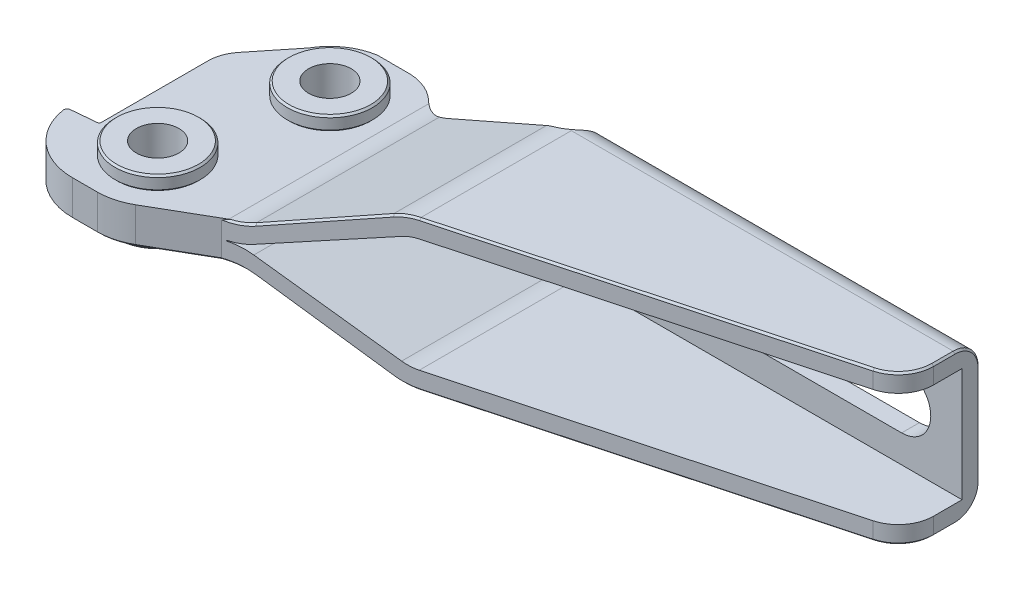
ISO-10303-21;
HEADER;
FILE_DESCRIPTION(('STEP AP214'),'2;1');
FILE_NAME('part.step','',(''),(''),'','','');
FILE_SCHEMA(('AUTOMOTIVE_DESIGN { 1 0 10303 214 1 1 1 1 }'));
ENDSEC;
DATA;
#1=APPLICATION_CONTEXT('core data for automotive mechanical design processes');
#2=APPLICATION_PROTOCOL_DEFINITION('international standard','automotive_design',2000,#1);
#3=PRODUCT_CONTEXT('',#1,'mechanical');
#4=PRODUCT('Part','Part','',(#3));
#5=PRODUCT_RELATED_PRODUCT_CATEGORY('part','',(#4));
#6=PRODUCT_DEFINITION_FORMATION('','',#4);
#7=PRODUCT_DEFINITION_CONTEXT('part definition',#1,'design');
#8=PRODUCT_DEFINITION('design','',#6,#7);
#9=PRODUCT_DEFINITION_SHAPE('','',#8);
#10=(LENGTH_UNIT() NAMED_UNIT(*) SI_UNIT(.MILLI.,.METRE.));
#11=(NAMED_UNIT(*) PLANE_ANGLE_UNIT() SI_UNIT($,.RADIAN.));
#12=(NAMED_UNIT(*) SI_UNIT($,.STERADIAN.) SOLID_ANGLE_UNIT());
#13=UNCERTAINTY_MEASURE_WITH_UNIT(LENGTH_MEASURE(1.E-05),#10,'distance_accuracy_value','');
#14=(GEOMETRIC_REPRESENTATION_CONTEXT(3) GLOBAL_UNCERTAINTY_ASSIGNED_CONTEXT((#13)) GLOBAL_UNIT_ASSIGNED_CONTEXT((#10,
#11,#12)) REPRESENTATION_CONTEXT('',''));
#15=CARTESIAN_POINT('',(0.,0.,0.));
#16=DIRECTION('',(0.,0.,1.));
#17=DIRECTION('',(1.,0.,0.));
#18=AXIS2_PLACEMENT_3D('',#15,#16,#17);
#19=CARTESIAN_POINT('',(0.,-2.55,0.));
#20=DIRECTION('',(0.,-1.,0.));
#21=DIRECTION('',(-0.718004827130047,0.,-0.696038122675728));
#22=AXIS2_PLACEMENT_3D('',#19,#20,#21);
#23=CYLINDRICAL_SURFACE('',#22,6.);
#24=CARTESIAN_POINT('',(0.,-4.3,0.));
#25=DIRECTION('',(0.,-1.,0.));
#26=DIRECTION('',(0.,0.,1.));
#27=AXIS2_PLACEMENT_3D('',#24,#25,#26);
#28=CIRCLE('',#27,6.);
#29=CARTESIAN_POINT('',(0.,-4.3,6.));
#30=VERTEX_POINT('',#29);
#31=EDGE_CURVE('E2857',#30,#30,#28,.F.);
#32=ORIENTED_EDGE('',*,*,#31,.T.);
#33=EDGE_LOOP('',(#32));
#34=FACE_BOUND('',#33,.T.);
#35=CARTESIAN_POINT('',(0.,-2.75,0.));
#36=DIRECTION('',(0.,-1.,0.));
#37=DIRECTION('',(-0.718004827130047,0.,-0.696038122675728));
#38=AXIS2_PLACEMENT_3D('',#35,#36,#37);
#39=CIRCLE('',#38,6.);
#40=CARTESIAN_POINT('',(-4.30802896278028,-2.75,-4.17622873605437));
#41=VERTEX_POINT('',#40);
#42=EDGE_CURVE('E486',#41,#41,#39,.T.);
#43=ORIENTED_EDGE('',*,*,#42,.T.);
#44=EDGE_LOOP('',(#43));
#45=FACE_BOUND('',#44,.T.);
#46=ADVANCED_FACE('F14',(#34,#45),#23,.T.);
#47=CARTESIAN_POINT('',(0.,-4.55,0.));
#48=DIRECTION('',(0.,1.,0.));
#49=DIRECTION('',(0.718004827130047,0.,0.696038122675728));
#50=AXIS2_PLACEMENT_3D('',#47,#48,#49);
#51=CYLINDRICAL_SURFACE('',#50,3.);
#52=CARTESIAN_POINT('',(0.,4.55,0.));
#53=DIRECTION('',(0.,1.,0.));
#54=DIRECTION('',(0.718004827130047,0.,0.696038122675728));
#55=AXIS2_PLACEMENT_3D('',#52,#53,#54);
#56=CIRCLE('',#55,3.);
#57=CARTESIAN_POINT('',(2.15401448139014,4.55,2.08811436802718));
#58=VERTEX_POINT('',#57);
#59=EDGE_CURVE('E1903',#58,#58,#56,.T.);
#60=ORIENTED_EDGE('',*,*,#59,.T.);
#61=EDGE_LOOP('',(#60));
#62=FACE_BOUND('',#61,.T.);
#63=CARTESIAN_POINT('',(0.,-4.55,0.));
#64=DIRECTION('',(0.,-1.,0.));
#65=DIRECTION('',(0.,0.,1.));
#66=AXIS2_PLACEMENT_3D('',#63,#64,#65);
#67=CIRCLE('',#66,3.);
#68=CARTESIAN_POINT('',(0.,-4.55,3.));
#69=VERTEX_POINT('',#68);
#70=EDGE_CURVE('E1461',#69,#69,#67,.F.);
#71=ORIENTED_EDGE('',*,*,#70,.F.);
#72=EDGE_LOOP('',(#71));
#73=FACE_BOUND('',#72,.T.);
#74=ADVANCED_FACE('F1831',(#62,#73),#51,.F.);
#75=CARTESIAN_POINT('',(-4.84,-2.55,19.41));
#76=DIRECTION('',(0.,-1.,0.));
#77=DIRECTION('',(-0.718004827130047,0.,-0.696038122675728));
#78=AXIS2_PLACEMENT_3D('',#75,#76,#77);
#79=CYLINDRICAL_SURFACE('',#78,6.);
#80=CARTESIAN_POINT('',(-4.84,-4.3,19.41));
#81=DIRECTION('',(0.,-1.,0.));
#82=DIRECTION('',(1.,0.,0.));
#83=AXIS2_PLACEMENT_3D('',#80,#81,#82);
#84=CIRCLE('',#83,6.);
#85=CARTESIAN_POINT('',(1.16,-4.3,19.41));
#86=VERTEX_POINT('',#85);
#87=EDGE_CURVE('E2854',#86,#86,#84,.F.);
#88=ORIENTED_EDGE('',*,*,#87,.T.);
#89=EDGE_LOOP('',(#88));
#90=FACE_BOUND('',#89,.T.);
#91=CARTESIAN_POINT('',(-4.84,-2.75,19.41));
#92=DIRECTION('',(0.,-1.,0.));
#93=DIRECTION('',(-0.718004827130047,0.,-0.696038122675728));
#94=AXIS2_PLACEMENT_3D('',#91,#92,#93);
#95=CIRCLE('',#94,6.);
#96=CARTESIAN_POINT('',(-9.14802896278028,-2.75,15.2337712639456));
#97=VERTEX_POINT('',#96);
#98=EDGE_CURVE('E1915',#97,#97,#95,.T.);
#99=ORIENTED_EDGE('',*,*,#98,.T.);
#100=EDGE_LOOP('',(#99));
#101=FACE_BOUND('',#100,.T.);
#102=ADVANCED_FACE('F1838',(#90,#101),#79,.T.);
#103=CARTESIAN_POINT('',(-4.84,-4.55,19.41));
#104=DIRECTION('',(0.,1.,0.));
#105=DIRECTION('',(0.718004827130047,0.,0.696038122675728));
#106=AXIS2_PLACEMENT_3D('',#103,#104,#105);
#107=CYLINDRICAL_SURFACE('',#106,3.);
#108=CARTESIAN_POINT('',(-4.84,4.55,19.41));
#109=DIRECTION('',(0.,1.,0.));
#110=DIRECTION('',(0.718004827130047,0.,0.696038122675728));
#111=AXIS2_PLACEMENT_3D('',#108,#109,#110);
#112=CIRCLE('',#111,3.);
#113=CARTESIAN_POINT('',(-2.68598551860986,4.55,21.4981143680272));
#114=VERTEX_POINT('',#113);
#115=EDGE_CURVE('E1936',#114,#114,#112,.T.);
#116=ORIENTED_EDGE('',*,*,#115,.T.);
#117=EDGE_LOOP('',(#116));
#118=FACE_BOUND('',#117,.T.);
#119=CARTESIAN_POINT('',(-4.84,-4.55,19.41));
#120=DIRECTION('',(0.,-1.,0.));
#121=DIRECTION('',(0.,0.,1.));
#122=AXIS2_PLACEMENT_3D('',#119,#120,#121);
#123=CIRCLE('',#122,3.);
#124=CARTESIAN_POINT('',(-4.84,-4.55,22.41));
#125=VERTEX_POINT('',#124);
#126=EDGE_CURVE('E1908',#125,#125,#123,.F.);
#127=ORIENTED_EDGE('',*,*,#126,.F.);
#128=EDGE_LOOP('',(#127));
#129=FACE_BOUND('',#128,.T.);
#130=ADVANCED_FACE('F1867',(#118,#129),#107,.F.);
#131=CARTESIAN_POINT('',(-4.84,-2.55,19.41));
#132=DIRECTION('',(0.,-1.,0.));
#133=DIRECTION('',(-0.718004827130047,0.,-0.696038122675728));
#134=AXIS2_PLACEMENT_3D('',#131,#132,#133);
#135=CONICAL_SURFACE('',#134,5.8,0.785398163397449);
#136=CARTESIAN_POINT('',(-4.84,-2.72677669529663,19.41));
#137=DIRECTION('',(0.,1.,0.));
#138=DIRECTION('',(0.,0.,-1.));
#139=AXIS2_PLACEMENT_3D('',#136,#137,#138);
#140=CIRCLE('',#139,5.97677669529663);
#141=CARTESIAN_POINT('',(-4.84,-2.72677669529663,13.4332233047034));
#142=VERTEX_POINT('',#141);
#143=EDGE_CURVE('E3047',#142,#142,#140,.F.);
#144=ORIENTED_EDGE('',*,*,#143,.T.);
#145=EDGE_LOOP('',(#144));
#146=FACE_BOUND('',#145,.T.);
#147=ORIENTED_EDGE('',*,*,#98,.F.);
#148=EDGE_LOOP('',(#147));
#149=FACE_BOUND('',#148,.T.);
#150=ADVANCED_FACE('F1865',(#146,#149),#135,.T.);
#151=CARTESIAN_POINT('',(-4.84,2.55,19.41));
#152=DIRECTION('',(0.,1.,0.));
#153=DIRECTION('',(0.718004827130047,0.,0.696038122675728));
#154=AXIS2_PLACEMENT_3D('',#151,#152,#153);
#155=CONICAL_SURFACE('',#154,5.75,0.785398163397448);
#156=CARTESIAN_POINT('',(-4.84,2.8,19.41));
#157=DIRECTION('',(0.,1.,0.));
#158=DIRECTION('',(0.718004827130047,0.,0.696038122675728));
#159=AXIS2_PLACEMENT_3D('',#156,#157,#158);
#160=CIRCLE('',#159,6.);
#161=CARTESIAN_POINT('',(-0.531971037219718,2.8,23.5862287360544));
#162=VERTEX_POINT('',#161);
#163=EDGE_CURVE('E1930',#162,#162,#160,.T.);
#164=ORIENTED_EDGE('',*,*,#163,.F.);
#165=EDGE_LOOP('',(#164));
#166=FACE_BOUND('',#165,.T.);
#167=CARTESIAN_POINT('',(-4.84,2.55,19.41));
#168=DIRECTION('',(0.,1.,0.));
#169=DIRECTION('',(0.,0.,-1.));
#170=AXIS2_PLACEMENT_3D('',#167,#168,#169);
#171=CIRCLE('',#170,5.75);
#172=CARTESIAN_POINT('',(-4.84,2.55,13.66));
#173=VERTEX_POINT('',#172);
#174=EDGE_CURVE('E1467',#173,#173,#171,.F.);
#175=ORIENTED_EDGE('',*,*,#174,.F.);
#176=EDGE_LOOP('',(#175));
#177=FACE_BOUND('',#176,.T.);
#178=ADVANCED_FACE('F1861',(#166,#177),#155,.T.);
#179=CARTESIAN_POINT('',(-4.84,-4.55,19.41));
#180=DIRECTION('',(0.,1.,0.));
#181=DIRECTION('',(0.718004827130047,0.,0.696038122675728));
#182=AXIS2_PLACEMENT_3D('',#179,#180,#181);
#183=CYLINDRICAL_SURFACE('',#182,6.);
#184=CARTESIAN_POINT('',(-4.84,4.3,19.41));
#185=DIRECTION('',(0.,1.,0.));
#186=DIRECTION('',(0.718004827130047,0.,0.696038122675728));
#187=AXIS2_PLACEMENT_3D('',#184,#185,#186);
#188=CIRCLE('',#187,6.);
#189=CARTESIAN_POINT('',(-0.531971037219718,4.3,23.5862287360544));
#190=VERTEX_POINT('',#189);
#191=EDGE_CURVE('E1925',#190,#190,#188,.T.);
#192=ORIENTED_EDGE('',*,*,#191,.F.);
#193=EDGE_LOOP('',(#192));
#194=FACE_BOUND('',#193,.T.);
#195=ORIENTED_EDGE('',*,*,#163,.T.);
#196=EDGE_LOOP('',(#195));
#197=FACE_BOUND('',#196,.T.);
#198=ADVANCED_FACE('F1857',(#194,#197),#183,.T.);
#199=CARTESIAN_POINT('',(-4.84,4.3,19.41));
#200=DIRECTION('',(0.,-1.,0.));
#201=DIRECTION('',(-0.718004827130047,0.,-0.696038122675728));
#202=AXIS2_PLACEMENT_3D('',#199,#200,#201);
#203=CONICAL_SURFACE('',#202,6.,0.785398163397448);
#204=CARTESIAN_POINT('',(-4.84,4.55,19.41));
#205=DIRECTION('',(0.,1.,0.));
#206=DIRECTION('',(0.718004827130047,0.,0.696038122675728));
#207=AXIS2_PLACEMENT_3D('',#204,#205,#206);
#208=CIRCLE('',#207,5.75);
#209=CARTESIAN_POINT('',(-0.711472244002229,4.55,23.4122192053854));
#210=VERTEX_POINT('',#209);
#211=EDGE_CURVE('E1921',#210,#210,#208,.T.);
#212=ORIENTED_EDGE('',*,*,#211,.F.);
#213=EDGE_LOOP('',(#212));
#214=FACE_BOUND('',#213,.T.);
#215=ORIENTED_EDGE('',*,*,#191,.T.);
#216=EDGE_LOOP('',(#215));
#217=FACE_BOUND('',#216,.T.);
#218=ADVANCED_FACE('F1854',(#214,#217),#203,.T.);
#219=CARTESIAN_POINT('',(-0.837780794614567,4.55,15.2814722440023));
#220=DIRECTION('',(0.,-1.,0.));
#221=DIRECTION('',(-0.718004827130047,0.,-0.696038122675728));
#222=AXIS2_PLACEMENT_3D('',#219,#220,#221);
#223=PLANE('',#222);
#224=ORIENTED_EDGE('',*,*,#115,.F.);
#225=EDGE_LOOP('',(#224));
#226=FACE_BOUND('',#225,.T.);
#227=ORIENTED_EDGE('',*,*,#211,.T.);
#228=EDGE_LOOP('',(#227));
#229=FACE_BOUND('',#228,.T.);
#230=ADVANCED_FACE('F1850',(#226,#229),#223,.F.);
#231=CARTESIAN_POINT('',(0.,-2.55,0.));
#232=DIRECTION('',(0.,-1.,0.));
#233=DIRECTION('',(-0.718004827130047,0.,-0.696038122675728));
#234=AXIS2_PLACEMENT_3D('',#231,#232,#233);
#235=CONICAL_SURFACE('',#234,5.8,0.785398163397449);
#236=CARTESIAN_POINT('',(0.,-2.72677669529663,0.));
#237=DIRECTION('',(0.,1.,0.));
#238=DIRECTION('',(0.,0.,-1.));
#239=AXIS2_PLACEMENT_3D('',#236,#237,#238);
#240=CIRCLE('',#239,5.97677669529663);
#241=CARTESIAN_POINT('',(0.,-2.72677669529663,-5.97677669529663));
#242=VERTEX_POINT('',#241);
#243=EDGE_CURVE('E1508',#242,#242,#240,.F.);
#244=ORIENTED_EDGE('',*,*,#243,.T.);
#245=EDGE_LOOP('',(#244));
#246=FACE_BOUND('',#245,.T.);
#247=ORIENTED_EDGE('',*,*,#42,.F.);
#248=EDGE_LOOP('',(#247));
#249=FACE_BOUND('',#248,.T.);
#250=ADVANCED_FACE('F1846',(#246,#249),#235,.T.);
#251=CARTESIAN_POINT('',(0.,2.55,0.));
#252=DIRECTION('',(0.,1.,0.));
#253=DIRECTION('',(0.718004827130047,0.,0.696038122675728));
#254=AXIS2_PLACEMENT_3D('',#251,#252,#253);
#255=CONICAL_SURFACE('',#254,5.75,0.785398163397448);
#256=CARTESIAN_POINT('',(0.,2.8,0.));
#257=DIRECTION('',(0.,1.,0.));
#258=DIRECTION('',(0.718004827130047,0.,0.696038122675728));
#259=AXIS2_PLACEMENT_3D('',#256,#257,#258);
#260=CIRCLE('',#259,6.);
#261=CARTESIAN_POINT('',(4.30802896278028,2.8,4.17622873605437));
#262=VERTEX_POINT('',#261);
#263=EDGE_CURVE('E1911',#262,#262,#260,.T.);
#264=ORIENTED_EDGE('',*,*,#263,.F.);
#265=EDGE_LOOP('',(#264));
#266=FACE_BOUND('',#265,.T.);
#267=CARTESIAN_POINT('',(0.,2.55,0.));
#268=DIRECTION('',(0.,1.,0.));
#269=DIRECTION('',(0.,0.,-1.));
#270=AXIS2_PLACEMENT_3D('',#267,#268,#269);
#271=CIRCLE('',#270,5.75);
#272=CARTESIAN_POINT('',(0.,2.55,-5.75));
#273=VERTEX_POINT('',#272);
#274=EDGE_CURVE('E3071',#273,#273,#271,.F.);
#275=ORIENTED_EDGE('',*,*,#274,.F.);
#276=EDGE_LOOP('',(#275));
#277=FACE_BOUND('',#276,.T.);
#278=ADVANCED_FACE('F1849',(#266,#277),#255,.T.);
#279=CARTESIAN_POINT('',(0.,-4.55,0.));
#280=DIRECTION('',(0.,1.,0.));
#281=DIRECTION('',(0.718004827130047,0.,0.696038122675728));
#282=AXIS2_PLACEMENT_3D('',#279,#280,#281);
#283=CYLINDRICAL_SURFACE('',#282,6.);
#284=CARTESIAN_POINT('',(0.,4.3,0.));
#285=DIRECTION('',(0.,1.,0.));
#286=DIRECTION('',(0.718004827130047,0.,0.696038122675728));
#287=AXIS2_PLACEMENT_3D('',#284,#285,#286);
#288=CIRCLE('',#287,6.);
#289=CARTESIAN_POINT('',(4.30802896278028,4.3,4.17622873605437));
#290=VERTEX_POINT('',#289);
#291=EDGE_CURVE('E1907',#290,#290,#288,.T.);
#292=ORIENTED_EDGE('',*,*,#291,.F.);
#293=EDGE_LOOP('',(#292));
#294=FACE_BOUND('',#293,.T.);
#295=ORIENTED_EDGE('',*,*,#263,.T.);
#296=EDGE_LOOP('',(#295));
#297=FACE_BOUND('',#296,.T.);
#298=ADVANCED_FACE('F1883',(#294,#297),#283,.T.);
#299=CARTESIAN_POINT('',(0.,4.3,0.));
#300=DIRECTION('',(0.,-1.,0.));
#301=DIRECTION('',(-0.718004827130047,0.,-0.696038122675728));
#302=AXIS2_PLACEMENT_3D('',#299,#300,#301);
#303=CONICAL_SURFACE('',#302,6.,0.785398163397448);
#304=CARTESIAN_POINT('',(0.,4.55,0.));
#305=DIRECTION('',(0.,1.,0.));
#306=DIRECTION('',(0.718004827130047,0.,0.696038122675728));
#307=AXIS2_PLACEMENT_3D('',#304,#305,#306);
#308=CIRCLE('',#307,5.75);
#309=CARTESIAN_POINT('',(4.12852775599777,4.55,4.00221920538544));
#310=VERTEX_POINT('',#309);
#311=EDGE_CURVE('E1906',#310,#310,#308,.T.);
#312=ORIENTED_EDGE('',*,*,#311,.F.);
#313=EDGE_LOOP('',(#312));
#314=FACE_BOUND('',#313,.T.);
#315=ORIENTED_EDGE('',*,*,#291,.T.);
#316=EDGE_LOOP('',(#315));
#317=FACE_BOUND('',#316,.T.);
#318=ADVANCED_FACE('F1853',(#314,#317),#303,.T.);
#319=CARTESIAN_POINT('',(4.00221920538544,4.55,-4.12852775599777));
#320=DIRECTION('',(0.,-1.,0.));
#321=DIRECTION('',(-0.718004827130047,0.,-0.696038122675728));
#322=AXIS2_PLACEMENT_3D('',#319,#320,#321);
#323=PLANE('',#322);
#324=ORIENTED_EDGE('',*,*,#59,.F.);
#325=EDGE_LOOP('',(#324));
#326=FACE_BOUND('',#325,.T.);
#327=ORIENTED_EDGE('',*,*,#311,.T.);
#328=EDGE_LOOP('',(#327));
#329=FACE_BOUND('',#328,.T.);
#330=ADVANCED_FACE('F1882',(#326,#329),#323,.F.);
#331=CARTESIAN_POINT('',(37.5,0.,-11.98));
#332=DIRECTION('',(0.,0.,1.));
#333=DIRECTION('',(0.,1.,0.));
#334=AXIS2_PLACEMENT_3D('',#331,#332,#333);
#335=CYLINDRICAL_SURFACE('',#334,4.1);
#336=CARTESIAN_POINT('',(37.5,0.,-8.49));
#337=DIRECTION('',(0.,0.,-1.));
#338=DIRECTION('',(0.,-1.,0.));
#339=AXIS2_PLACEMENT_3D('',#336,#337,#338);
#340=CIRCLE('',#339,4.1);
#341=CARTESIAN_POINT('',(37.5,-4.1,-8.49));
#342=VERTEX_POINT('',#341);
#343=CARTESIAN_POINT('',(37.5,4.1,-8.49));
#344=VERTEX_POINT('',#343);
#345=EDGE_CURVE('E475',#342,#344,#340,.T.);
#346=ORIENTED_EDGE('',*,*,#345,.T.);
#347=DIRECTION('',(0.,0.,1.));
#348=VECTOR('',#347,1.);
#349=CARTESIAN_POINT('',(37.5,4.1,-11.98));
#350=LINE('',#349,#348);
#351=CARTESIAN_POINT('',(37.5,4.1,-5.99));
#352=VERTEX_POINT('',#351);
#353=EDGE_CURVE('E502',#344,#352,#350,.T.);
#354=ORIENTED_EDGE('',*,*,#353,.T.);
#355=CARTESIAN_POINT('',(37.5,0.,-5.99));
#356=DIRECTION('',(0.,0.,1.));
#357=DIRECTION('',(1.,0.,0.));
#358=AXIS2_PLACEMENT_3D('',#355,#356,#357);
#359=CIRCLE('',#358,4.1);
#360=CARTESIAN_POINT('',(37.5,-4.1,-5.99));
#361=VERTEX_POINT('',#360);
#362=EDGE_CURVE('E496',#352,#361,#359,.T.);
#363=ORIENTED_EDGE('',*,*,#362,.T.);
#364=DIRECTION('',(0.,0.,1.));
#365=VECTOR('',#364,1.);
#366=CARTESIAN_POINT('',(37.5,-4.1,-11.98));
#367=LINE('',#366,#365);
#368=EDGE_CURVE('E481',#342,#361,#367,.T.);
#369=ORIENTED_EDGE('',*,*,#368,.F.);
#370=EDGE_LOOP('',(#346,#354,#363,#369));
#371=FACE_BOUND('',#370,.T.);
#372=ADVANCED_FACE('F1891',(#371),#335,.F.);
#373=CARTESIAN_POINT('',(74.5,4.1,-11.98));
#374=DIRECTION('',(0.,1.,0.));
#375=DIRECTION('',(-1.,0.,0.));
#376=AXIS2_PLACEMENT_3D('',#373,#374,#375);
#377=PLANE('',#376);
#378=DIRECTION('',(1.,0.,0.));
#379=VECTOR('',#378,1.);
#380=CARTESIAN_POINT('',(83.,4.1,-8.49));
#381=LINE('',#380,#379);
#382=CARTESIAN_POINT('',(74.5,4.1,-8.49));
#383=VERTEX_POINT('',#382);
#384=EDGE_CURVE('E507',#344,#383,#381,.T.);
#385=ORIENTED_EDGE('',*,*,#384,.T.);
#386=DIRECTION('',(0.,0.,1.));
#387=VECTOR('',#386,1.);
#388=CARTESIAN_POINT('',(74.5,4.1,-11.98));
#389=LINE('',#388,#387);
#390=CARTESIAN_POINT('',(74.5,4.1,-5.99));
#391=VERTEX_POINT('',#390);
#392=EDGE_CURVE('E476',#383,#391,#389,.T.);
#393=ORIENTED_EDGE('',*,*,#392,.T.);
#394=DIRECTION('',(-1.,0.,0.));
#395=VECTOR('',#394,1.);
#396=CARTESIAN_POINT('',(74.5,4.1,-5.99));
#397=LINE('',#396,#395);
#398=EDGE_CURVE('E490',#391,#352,#397,.T.);
#399=ORIENTED_EDGE('',*,*,#398,.T.);
#400=ORIENTED_EDGE('',*,*,#353,.F.);
#401=EDGE_LOOP('',(#385,#393,#399,#400));
#402=FACE_BOUND('',#401,.T.);
#403=ADVANCED_FACE('F1897',(#402),#377,.F.);
#404=CARTESIAN_POINT('',(74.5,0.,-11.98));
#405=DIRECTION('',(0.,0.,1.));
#406=DIRECTION('',(0.,1.,0.));
#407=AXIS2_PLACEMENT_3D('',#404,#405,#406);
#408=CYLINDRICAL_SURFACE('',#407,4.1);
#409=CARTESIAN_POINT('',(74.5,0.,-8.49));
#410=DIRECTION('',(0.,0.,-1.));
#411=DIRECTION('',(0.,-1.,0.));
#412=AXIS2_PLACEMENT_3D('',#409,#410,#411);
#413=CIRCLE('',#412,4.1);
#414=CARTESIAN_POINT('',(74.5,-4.1,-8.49));
#415=VERTEX_POINT('',#414);
#416=EDGE_CURVE('E471',#383,#415,#413,.T.);
#417=ORIENTED_EDGE('',*,*,#416,.T.);
#418=DIRECTION('',(0.,0.,1.));
#419=VECTOR('',#418,1.);
#420=CARTESIAN_POINT('',(74.5,-4.1,-11.98));
#421=LINE('',#420,#419);
#422=CARTESIAN_POINT('',(74.5,-4.1,-5.99));
#423=VERTEX_POINT('',#422);
#424=EDGE_CURVE('E463',#415,#423,#421,.T.);
#425=ORIENTED_EDGE('',*,*,#424,.T.);
#426=CARTESIAN_POINT('',(74.5,0.,-5.99));
#427=DIRECTION('',(0.,0.,1.));
#428=DIRECTION('',(-1.,0.,0.));
#429=AXIS2_PLACEMENT_3D('',#426,#427,#428);
#430=CIRCLE('',#429,4.1);
#431=EDGE_CURVE('E468',#423,#391,#430,.T.);
#432=ORIENTED_EDGE('',*,*,#431,.T.);
#433=ORIENTED_EDGE('',*,*,#392,.F.);
#434=EDGE_LOOP('',(#417,#425,#432,#433));
#435=FACE_BOUND('',#434,.T.);
#436=ADVANCED_FACE('F465',(#435),#408,.F.);
#437=CARTESIAN_POINT('',(37.5,-4.1,-11.98));
#438=DIRECTION('',(0.,-1.,0.));
#439=DIRECTION('',(1.,0.,0.));
#440=AXIS2_PLACEMENT_3D('',#437,#438,#439);
#441=PLANE('',#440);
#442=DIRECTION('',(-1.,0.,0.));
#443=VECTOR('',#442,1.);
#444=CARTESIAN_POINT('',(83.,-4.1,-8.49));
#445=LINE('',#444,#443);
#446=EDGE_CURVE('E510',#415,#342,#445,.T.);
#447=ORIENTED_EDGE('',*,*,#446,.T.);
#448=ORIENTED_EDGE('',*,*,#368,.T.);
#449=DIRECTION('',(1.,0.,0.));
#450=VECTOR('',#449,1.);
#451=CARTESIAN_POINT('',(37.5,-4.1,-5.99));
#452=LINE('',#451,#450);
#453=EDGE_CURVE('E479',#361,#423,#452,.T.);
#454=ORIENTED_EDGE('',*,*,#453,.T.);
#455=ORIENTED_EDGE('',*,*,#424,.F.);
#456=EDGE_LOOP('',(#447,#448,#454,#455));
#457=FACE_BOUND('',#456,.T.);
#458=ADVANCED_FACE('F480',(#457),#441,.F.);
#459=CARTESIAN_POINT('',(83.,-7.,-4.99));
#460=DIRECTION('',(-1.,0.,0.));
#461=DIRECTION('',(0.,-1.,0.));
#462=AXIS2_PLACEMENT_3D('',#459,#460,#461);
#463=CYLINDRICAL_SURFACE('',#462,3.50000000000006);
#464=DIRECTION('',(-1.,0.,0.));
#465=VECTOR('',#464,1.);
#466=CARTESIAN_POINT('',(83.,-7.,-8.49));
#467=LINE('',#466,#465);
#468=CARTESIAN_POINT('',(82.75,-7.,-8.49));
#469=VERTEX_POINT('',#468);
#470=CARTESIAN_POINT('',(30.,-7.,-8.49));
#471=VERTEX_POINT('',#470);
#472=EDGE_CURVE('E519',#469,#471,#467,.T.);
#473=ORIENTED_EDGE('',*,*,#472,.F.);
#474=CARTESIAN_POINT('',(82.75,-7.,-4.99));
#475=DIRECTION('',(1.,0.,0.));
#476=DIRECTION('',(0.,1.,0.));
#477=AXIS2_PLACEMENT_3D('',#474,#475,#476);
#478=CIRCLE('',#477,3.50000000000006);
#479=CARTESIAN_POINT('',(82.75,-10.5,-4.99));
#480=VERTEX_POINT('',#479);
#481=EDGE_CURVE('E627',#469,#480,#478,.F.);
#482=ORIENTED_EDGE('',*,*,#481,.T.);
#483=DIRECTION('',(-1.,0.,0.));
#484=VECTOR('',#483,1.);
#485=CARTESIAN_POINT('',(83.,-10.5,-4.99));
#486=LINE('',#485,#484);
#487=CARTESIAN_POINT('',(29.0645580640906,-10.5,-4.99));
#488=VERTEX_POINT('',#487);
#489=EDGE_CURVE('E521',#480,#488,#486,.T.);
#490=ORIENTED_EDGE('',*,*,#489,.T.);
#491=CARTESIAN_POINT('',(29.0645580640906,-10.5,-4.99));
#492=CARTESIAN_POINT('',(29.1029543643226,-10.499996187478,-5.02158753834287));
#493=CARTESIAN_POINT('',(29.1403532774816,-10.499572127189,-5.05437710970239));
#494=CARTESIAN_POINT('',(29.2128933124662,-10.4976609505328,-5.12242044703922));
#495=CARTESIAN_POINT('',(29.2480315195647,-10.4961724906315,-5.15767727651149));
#496=CARTESIAN_POINT('',(29.3500629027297,-10.4897426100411,-5.2677033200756));
#497=CARTESIAN_POINT('',(29.4129419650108,-10.4828293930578,-5.34621855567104));
#498=CARTESIAN_POINT('',(29.525108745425,-10.4617730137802,-5.51269993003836));
#499=CARTESIAN_POINT('',(29.5742711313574,-10.4475663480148,-5.60074362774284));
#500=CARTESIAN_POINT('',(29.6546852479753,-10.4103460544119,-5.78248073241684));
#501=CARTESIAN_POINT('',(29.6860450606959,-10.3873870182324,-5.87613614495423));
#502=CARTESIAN_POINT('',(29.7199226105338,-10.3443809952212,-6.02353126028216));
#503=CARTESIAN_POINT('',(29.7290578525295,-10.3274741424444,-6.07675971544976));
#504=CARTESIAN_POINT('',(29.7413749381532,-10.2908274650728,-6.18317099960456));
#505=CARTESIAN_POINT('',(29.7445330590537,-10.271076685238,-6.23635281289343));
#506=CARTESIAN_POINT('',(29.7447351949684,-10.25,-6.28903810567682));
#507=B_SPLINE_CURVE_WITH_KNOTS('',3,(#491,#492,#493,#494,#495,#496,#497,#498,#499,#500,#501,
#502,#503,#504,#505,#506),.UNSPECIFIED.,.F.,.F.,(4,2,2,2,2,2,2,4),(0.,0.149108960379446,
0.29840646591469,0.599411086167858,0.903082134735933,1.20488927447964,1.37431101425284,
1.54440377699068),.UNSPECIFIED.);
#508=CARTESIAN_POINT('',(29.7447351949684,-10.25,-6.28903810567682));
#509=VERTEX_POINT('',#508);
#510=EDGE_CURVE('E620',#488,#509,#507,.T.);
#511=ORIENTED_EDGE('',*,*,#510,.T.);
#512=CARTESIAN_POINT('',(28.6431372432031,-10.5,-4.99));
#513=CARTESIAN_POINT('',(28.7052951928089,-10.4999975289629,-5.03067999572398));
#514=CARTESIAN_POINT('',(28.7659421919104,-10.4992907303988,-5.07369013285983));
#515=CARTESIAN_POINT('',(28.8838776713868,-10.4959614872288,-5.16408192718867));
#516=CARTESIAN_POINT('',(28.9411643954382,-10.4933380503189,-5.21146583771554));
#517=CARTESIAN_POINT('',(29.0521824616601,-10.4856533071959,-5.31045634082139));
#518=CARTESIAN_POINT('',(29.1058998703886,-10.4805830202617,-5.36207790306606));
#519=CARTESIAN_POINT('',(29.2091713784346,-10.4674898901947,-5.46897017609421));
#520=CARTESIAN_POINT('',(29.2587262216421,-10.4594675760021,-5.52424023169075));
#521=CARTESIAN_POINT('',(29.3535458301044,-10.4399425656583,-5.63818936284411));
#522=CARTESIAN_POINT('',(29.3987909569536,-10.4284248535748,-5.69688224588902));
#523=CARTESIAN_POINT('',(29.4844374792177,-10.401485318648,-5.81684753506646));
#524=CARTESIAN_POINT('',(29.5248392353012,-10.3860637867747,-5.87811974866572));
#525=CARTESIAN_POINT('',(29.6004589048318,-10.3510070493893,-6.00237403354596));
#526=CARTESIAN_POINT('',(29.6356917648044,-10.3313844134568,-6.06535052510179));
#527=CARTESIAN_POINT('',(29.700979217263,-10.2876684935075,-6.1923980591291));
#528=CARTESIAN_POINT('',(29.7310342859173,-10.2635756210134,-6.2564690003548));
#529=CARTESIAN_POINT('',(29.809487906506,-10.1881006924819,-6.44002539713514));
#530=CARTESIAN_POINT('',(29.8515524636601,-10.1310185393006,-6.55997631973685));
#531=CARTESIAN_POINT('',(29.9188668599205,-10.0009998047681,-6.79616811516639));
#532=CARTESIAN_POINT('',(29.9440804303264,-9.92802947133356,-6.91240047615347));
#533=CARTESIAN_POINT('',(29.975707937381,-9.78729285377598,-7.10940703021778));
#534=CARTESIAN_POINT('',(29.9852048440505,-9.72258702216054,-7.19192286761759));
#535=CARTESIAN_POINT('',(29.9973417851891,-9.58607509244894,-7.35076341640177));
#536=CARTESIAN_POINT('',(30.000012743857,-9.51430255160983,-7.42711452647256));
#537=CARTESIAN_POINT('',(30.,-9.4392416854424,-7.5));
#538=B_SPLINE_CURVE_WITH_KNOTS('',3,(#512,#513,#514,#515,#516,#517,#518,#519,#520,#521,#522,
#523,#524,#525,#526,#527,#528,#529,#530,#531,#532,#533,#534,#535,#536,#537),.UNSPECIFIED.,.F.,
.F.,(4,2,2,2,2,2,2,2,2,2,2,2,4),(0.,0.22282276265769,0.445760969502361,0.669523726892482,
0.893246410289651,1.11794412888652,1.34262510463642,1.56664300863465,1.79064030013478,
2.2064711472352,2.62319413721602,2.938430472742,3.25223611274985),.UNSPECIFIED.);
#539=CARTESIAN_POINT('',(30.,-9.4392416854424,-7.5));
#540=VERTEX_POINT('',#539);
#541=EDGE_CURVE('E641',#509,#540,#538,.T.);
#542=ORIENTED_EDGE('',*,*,#541,.T.);
#543=CARTESIAN_POINT('',(30.,-7.,-4.99));
#544=DIRECTION('',(-1.,0.,0.));
#545=DIRECTION('',(0.,-1.,0.));
#546=AXIS2_PLACEMENT_3D('',#543,#544,#545);
#547=CIRCLE('',#546,3.50000000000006);
#548=EDGE_CURVE('E648',#540,#471,#547,.F.);
#549=ORIENTED_EDGE('',*,*,#548,.T.);
#550=EDGE_LOOP('',(#473,#482,#490,#511,#542,#549));
#551=FACE_BOUND('',#550,.T.);
#552=ADVANCED_FACE('F633',(#551),#463,.T.);
#553=CARTESIAN_POINT('',(83.,-7.,-8.49));
#554=DIRECTION('',(0.,0.,1.));
#555=DIRECTION('',(0.,1.,0.));
#556=AXIS2_PLACEMENT_3D('',#553,#554,#555);
#557=PLANE('',#556);
#558=DIRECTION('',(0.,1.,0.));
#559=VECTOR('',#558,1.);
#560=CARTESIAN_POINT('',(2.87403208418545,-10.5,-8.49));
#561=LINE('',#560,#559);
#562=CARTESIAN_POINT('',(2.87403208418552,2.55,-8.49));
#563=VERTEX_POINT('',#562);
#564=CARTESIAN_POINT('',(2.87403208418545,-2.3,-8.49));
#565=VERTEX_POINT('',#564);
#566=EDGE_CURVE('E649',#563,#565,#561,.F.);
#567=ORIENTED_EDGE('',*,*,#566,.T.);
#568=DIRECTION('',(-1.,0.,0.));
#569=VECTOR('',#568,1.);
#570=CARTESIAN_POINT('',(0.,-2.3,-8.49));
#571=LINE('',#570,#569);
#572=CARTESIAN_POINT('',(0.,-2.3,-8.49));
#573=VERTEX_POINT('',#572);
#574=EDGE_CURVE('E3014',#565,#573,#571,.T.);
#575=ORIENTED_EDGE('',*,*,#574,.T.);
#576=DIRECTION('',(0.,1.,0.));
#577=VECTOR('',#576,1.);
#578=CARTESIAN_POINT('',(0.,-7.,-8.49));
#579=LINE('',#578,#577);
#580=CARTESIAN_POINT('',(0.,2.55,-8.49));
#581=VERTEX_POINT('',#580);
#582=EDGE_CURVE('E512',#573,#581,#579,.T.);
#583=ORIENTED_EDGE('',*,*,#582,.T.);
#584=DIRECTION('',(1.,0.,0.));
#585=VECTOR('',#584,1.);
#586=CARTESIAN_POINT('',(-19.34,2.55,-8.49));
#587=LINE('',#586,#585);
#588=EDGE_CURVE('E3067',#581,#563,#587,.T.);
#589=ORIENTED_EDGE('',*,*,#588,.T.);
#590=EDGE_LOOP('',(#567,#575,#583,#589));
#591=FACE_BOUND('',#590,.T.);
#592=ADVANCED_FACE('F547',(#591),#557,.F.);
#593=CARTESIAN_POINT('',(0.,-7.,-4.99));
#594=DIRECTION('',(1.,0.,0.));
#595=DIRECTION('',(0.,0.,-1.));
#596=AXIS2_PLACEMENT_3D('',#593,#594,#595);
#597=PLANE('',#596);
#598=ORIENTED_EDGE('',*,*,#582,.F.);
#599=DIRECTION('',(0.,0.,-1.));
#600=VECTOR('',#599,1.);
#601=CARTESIAN_POINT('',(0.,-2.3,-4.99));
#602=LINE('',#601,#600);
#603=CARTESIAN_POINT('',(0.,-2.3,-8.5));
#604=VERTEX_POINT('',#603);
#605=EDGE_CURVE('E3011',#573,#604,#602,.T.);
#606=ORIENTED_EDGE('',*,*,#605,.T.);
#607=DIRECTION('',(0.,-1.,0.));
#608=VECTOR('',#607,1.);
#609=CARTESIAN_POINT('',(0.,-10.5,-8.5));
#610=LINE('',#609,#608);
#611=CARTESIAN_POINT('',(0.,2.55,-8.5));
#612=VERTEX_POINT('',#611);
#613=EDGE_CURVE('E3065',#612,#604,#610,.T.);
#614=ORIENTED_EDGE('',*,*,#613,.F.);
#615=DIRECTION('',(0.,0.,-1.));
#616=VECTOR('',#615,1.);
#617=CARTESIAN_POINT('',(0.,2.55,29.91));
#618=LINE('',#617,#616);
#619=EDGE_CURVE('E560',#581,#612,#618,.T.);
#620=ORIENTED_EDGE('',*,*,#619,.F.);
#621=EDGE_LOOP('',(#598,#606,#614,#620));
#622=FACE_BOUND('',#621,.T.);
#623=ADVANCED_FACE('F544',(#622),#597,.T.);
#624=CARTESIAN_POINT('',(83.,7.,-4.99));
#625=DIRECTION('',(-1.,0.,0.));
#626=DIRECTION('',(0.,-1.,0.));
#627=AXIS2_PLACEMENT_3D('',#624,#625,#626);
#628=CYLINDRICAL_SURFACE('',#627,3.50000000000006);
#629=DIRECTION('',(-1.,0.,0.));
#630=VECTOR('',#629,1.);
#631=CARTESIAN_POINT('',(83.,10.5,-4.99));
#632=LINE('',#631,#630);
#633=CARTESIAN_POINT('',(82.75,10.5,-4.99));
#634=VERTEX_POINT('',#633);
#635=CARTESIAN_POINT('',(28.9999999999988,10.5,-4.99));
#636=VERTEX_POINT('',#635);
#637=EDGE_CURVE('E515',#634,#636,#632,.T.);
#638=ORIENTED_EDGE('',*,*,#637,.F.);
#639=CARTESIAN_POINT('',(82.75,7.,-4.99));
#640=DIRECTION('',(1.,0.,0.));
#641=DIRECTION('',(0.,1.,0.));
#642=AXIS2_PLACEMENT_3D('',#639,#640,#641);
#643=CIRCLE('',#642,3.50000000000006);
#644=CARTESIAN_POINT('',(82.75,7.,-8.49));
#645=VERTEX_POINT('',#644);
#646=EDGE_CURVE('E616',#634,#645,#643,.F.);
#647=ORIENTED_EDGE('',*,*,#646,.T.);
#648=DIRECTION('',(-1.,0.,0.));
#649=VECTOR('',#648,1.);
#650=CARTESIAN_POINT('',(83.,7.,-8.49));
#651=LINE('',#650,#649);
#652=CARTESIAN_POINT('',(30.,7.,-8.49));
#653=VERTEX_POINT('',#652);
#654=EDGE_CURVE('E517',#645,#653,#651,.T.);
#655=ORIENTED_EDGE('',*,*,#654,.T.);
#656=CARTESIAN_POINT('',(30.,7.,-4.99));
#657=DIRECTION('',(-1.,0.,0.));
#658=DIRECTION('',(0.,-1.,0.));
#659=AXIS2_PLACEMENT_3D('',#656,#657,#658);
#660=CIRCLE('',#659,3.50000000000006);
#661=CARTESIAN_POINT('',(30.,9.43924168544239,-7.5));
#662=VERTEX_POINT('',#661);
#663=EDGE_CURVE('E532',#653,#662,#660,.F.);
#664=ORIENTED_EDGE('',*,*,#663,.T.);
#665=CARTESIAN_POINT('',(30.,9.43924168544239,-7.5));
#666=CARTESIAN_POINT('',(30.0000030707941,9.49237837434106,-7.44837682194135));
#667=CARTESIAN_POINT('',(29.9986673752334,9.54387595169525,-7.39503594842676));
#668=CARTESIAN_POINT('',(29.9928088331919,9.64334391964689,-7.28525659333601));
#669=CARTESIAN_POINT('',(29.988283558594,9.69131159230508,-7.22881578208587));
#670=CARTESIAN_POINT('',(29.9755144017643,9.78353542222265,-7.11307030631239));
#671=CARTESIAN_POINT('',(29.9672587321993,9.82777928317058,-7.05375710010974));
#672=CARTESIAN_POINT('',(29.9465600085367,9.9121022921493,-6.93295720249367));
#673=CARTESIAN_POINT('',(29.9341180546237,9.95218253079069,-6.87147108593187));
#674=CARTESIAN_POINT('',(29.9045625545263,10.0281730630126,-6.74657057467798));
#675=CARTESIAN_POINT('',(29.8874237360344,10.0640592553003,-6.68314744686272));
#676=CARTESIAN_POINT('',(29.8481950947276,10.1312452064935,-6.55541091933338));
#677=CARTESIAN_POINT('',(29.8261056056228,10.1625452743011,-6.4910975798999));
#678=CARTESIAN_POINT('',(29.7768456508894,10.2204238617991,-6.36252470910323));
#679=CARTESIAN_POINT('',(29.7496894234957,10.2470152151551,-6.29826552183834));
#680=CARTESIAN_POINT('',(29.6902153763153,10.295639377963,-6.1704431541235));
#681=CARTESIAN_POINT('',(29.6578980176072,10.3176725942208,-6.10687991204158));
#682=CARTESIAN_POINT('',(29.5586621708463,10.3741093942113,-5.92813834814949));
#683=CARTESIAN_POINT('',(29.4855516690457,10.4032703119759,-5.81464882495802));
#684=CARTESIAN_POINT('',(29.3230878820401,10.4487855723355,-5.59689943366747));
#685=CARTESIAN_POINT('',(29.2337024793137,10.4651142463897,-5.49265843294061));
#686=CARTESIAN_POINT('',(29.0624956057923,10.4853605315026,-5.31883139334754));
#687=CARTESIAN_POINT('',(28.9834421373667,10.4912353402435,-5.24670466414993));
#688=CARTESIAN_POINT('',(28.8183258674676,10.4985418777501,-5.11146813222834));
#689=CARTESIAN_POINT('',(28.732294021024,10.4999922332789,-5.04832159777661));
#690=CARTESIAN_POINT('',(28.6431372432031,10.5,-4.99));
#691=B_SPLINE_CURVE_WITH_KNOTS('',3,(#665,#666,#667,#668,#669,#670,#671,#672,#673,#674,#675,
#676,#677,#678,#679,#680,#681,#682,#683,#684,#685,#686,#687,#688,#689,#690),.UNSPECIFIED.,.F.,
.F.,(4,2,2,2,2,2,2,2,2,2,2,2,4),(0.,0.22223499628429,0.444639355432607,0.667751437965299,
0.890804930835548,1.11508300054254,1.33934595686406,1.56298794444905,1.78660996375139,
2.19886264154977,2.611937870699,2.9327732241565,3.25225599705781),.UNSPECIFIED.);
#692=CARTESIAN_POINT('',(28.8184935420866,10.4978033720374,-5.11398213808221));
#693=VERTEX_POINT('',#692);
#694=EDGE_CURVE('E524',#662,#693,#691,.T.);
#695=ORIENTED_EDGE('',*,*,#694,.T.);
#696=CARTESIAN_POINT('',(28.4008648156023,10.4760308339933,-5.39891275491));
#697=CARTESIAN_POINT('',(28.5957571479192,10.4916291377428,-5.26602255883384));
#698=CARTESIAN_POINT('',(28.790701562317,10.4996143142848,-5.13297500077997));
#699=CARTESIAN_POINT('',(28.9904653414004,10.4999954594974,-4.9965134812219));
#700=CARTESIAN_POINT('',(28.9952326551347,10.5000000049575,-4.99325678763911));
#701=CARTESIAN_POINT('',(28.9999999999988,10.5,-4.99));
#702=B_SPLINE_CURVE_WITH_KNOTS('',3,(#696,#697,#698,#699,#700,#701),.UNSPECIFIED.,.F.,.F.,(4,2,
4),(0.,0.708462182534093,0.725782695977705),.UNSPECIFIED.);
#703=EDGE_CURVE('E551',#693,#636,#702,.T.);
#704=ORIENTED_EDGE('',*,*,#703,.T.);
#705=EDGE_LOOP('',(#638,#647,#655,#664,#695,#704));
#706=FACE_BOUND('',#705,.T.);
#707=ADVANCED_FACE('F538',(#706),#628,.T.);
#708=CARTESIAN_POINT('',(29.,3.00000000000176,-5.99));
#709=DIRECTION('',(0.,0.,1.));
#710=DIRECTION('',(0.,1.,0.));
#711=AXIS2_PLACEMENT_3D('',#708,#709,#710);
#712=PLANE('',#711);
#713=CARTESIAN_POINT('',(7.73,7.55,-5.99));
#714=DIRECTION('',(0.,0.,-1.));
#715=DIRECTION('',(-1.,0.,0.));
#716=AXIS2_PLACEMENT_3D('',#713,#714,#715);
#717=CIRCLE('',#716,7.50000000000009);
#718=CARTESIAN_POINT('',(7.98056392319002,0.0541866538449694,-5.99));
#719=VERTEX_POINT('',#718);
#720=CARTESIAN_POINT('',(7.6075295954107,0.0509999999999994,-5.99));
#721=VERTEX_POINT('',#720);
#722=EDGE_CURVE('E657',#719,#721,#717,.T.);
#723=ORIENTED_EDGE('',*,*,#722,.T.);
#724=DIRECTION('',(0.,-1.,0.));
#725=VECTOR('',#724,1.);
#726=CARTESIAN_POINT('',(7.6075295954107,0.0509999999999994,-5.99));
#727=LINE('',#726,#725);
#728=CARTESIAN_POINT('',(7.6075295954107,-0.0510000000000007,-5.99));
#729=VERTEX_POINT('',#728);
#730=EDGE_CURVE('E661',#721,#729,#727,.T.);
#731=ORIENTED_EDGE('',*,*,#730,.T.);
#732=CARTESIAN_POINT('',(7.73,-7.55,-5.99));
#733=DIRECTION('',(0.,0.,-1.));
#734=DIRECTION('',(-1.,0.,0.));
#735=AXIS2_PLACEMENT_3D('',#732,#733,#734);
#736=CIRCLE('',#735,7.50000000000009);
#737=CARTESIAN_POINT('',(7.98056392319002,-0.0541866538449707,-5.99));
#738=VERTEX_POINT('',#737);
#739=EDGE_CURVE('E665',#729,#738,#736,.T.);
#740=ORIENTED_EDGE('',*,*,#739,.T.);
#741=DIRECTION('',(0.,1.,0.));
#742=VECTOR('',#741,1.);
#743=CARTESIAN_POINT('',(7.98056392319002,-10.5,-5.99));
#744=LINE('',#743,#742);
#745=EDGE_CURVE('E711',#719,#738,#744,.F.);
#746=ORIENTED_EDGE('',*,*,#745,.F.);
#747=EDGE_LOOP('',(#723,#731,#740,#746));
#748=FACE_BOUND('',#747,.T.);
#749=ADVANCED_FACE('F543',(#748),#712,.T.);
#750=CARTESIAN_POINT('',(29.,-3.00000000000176,30.42));
#751=DIRECTION('',(0.,0.,-1.));
#752=DIRECTION('',(0.,-1.,0.));
#753=AXIS2_PLACEMENT_3D('',#750,#751,#752);
#754=CYLINDRICAL_SURFACE('',#753,4.99999999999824);
#755=DIRECTION('',(0.,0.,-1.));
#756=VECTOR('',#755,1.);
#757=CARTESIAN_POINT('',(27.046124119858,-7.6024307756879,30.42));
#758=LINE('',#757,#756);
#759=CARTESIAN_POINT('',(27.046124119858,-7.6024307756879,16.9467926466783));
#760=VERTEX_POINT('',#759);
#761=CARTESIAN_POINT('',(27.046124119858,-7.6024307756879,-4.50035459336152));
#762=VERTEX_POINT('',#761);
#763=EDGE_CURVE('E674',#760,#762,#758,.T.);
#764=ORIENTED_EDGE('',*,*,#763,.F.);
#765=CARTESIAN_POINT('',(29.,-3.00000000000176,16.41886471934));
#766=DIRECTION('',(0.260841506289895,0.,0.965381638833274));
#767=DIRECTION('',(0.965381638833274,0.,-0.260841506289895));
#768=AXIS2_PLACEMENT_3D('',#765,#766,#767);
#769=ELLIPSE('',#768,5.17929883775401,4.99999999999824);
#770=CARTESIAN_POINT('',(29.,-8.,16.41886471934));
#771=VERTEX_POINT('',#770);
#772=EDGE_CURVE('E1779',#771,#760,#769,.F.);
#773=ORIENTED_EDGE('',*,*,#772,.F.);
#774=DIRECTION('',(0.,0.,-1.));
#775=VECTOR('',#774,1.);
#776=CARTESIAN_POINT('',(29.,-8.,30.42));
#777=LINE('',#776,#775);
#778=CARTESIAN_POINT('',(29.,-8.,-5.26393202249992));
#779=VERTEX_POINT('',#778);
#780=EDGE_CURVE('E668',#771,#779,#777,.T.);
#781=ORIENTED_EDGE('',*,*,#780,.T.);
#782=CARTESIAN_POINT('',(27.046124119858,-7.6024307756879,-4.50035459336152));
#783=CARTESIAN_POINT('',(27.1160599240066,-7.63213491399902,-4.50141946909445));
#784=CARTESIAN_POINT('',(27.1866625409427,-7.66021237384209,-4.50496216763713));
#785=CARTESIAN_POINT('',(27.3286958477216,-7.71300867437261,-4.51721166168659));
#786=CARTESIAN_POINT('',(27.4001268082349,-7.73772638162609,-4.52592019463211));
#787=CARTESIAN_POINT('',(27.5431910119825,-7.78365450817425,-4.54869783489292));
#788=CARTESIAN_POINT('',(27.6148239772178,-7.80486845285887,-4.56276150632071));
#789=CARTESIAN_POINT('',(27.7577320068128,-7.84378626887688,-4.59634044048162));
#790=CARTESIAN_POINT('',(27.8290071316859,-7.8614907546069,-4.61585474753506));
#791=CARTESIAN_POINT('',(28.0417583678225,-7.90946527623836,-4.68276620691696));
#792=CARTESIAN_POINT('',(28.1819130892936,-7.93451836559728,-4.73849370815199));
#793=CARTESIAN_POINT('',(28.4533188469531,-7.97191429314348,-4.87118601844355));
#794=CARTESIAN_POINT('',(28.584581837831,-7.98427452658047,-4.94812157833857));
#795=CARTESIAN_POINT('',(28.7600782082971,-7.9945011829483,-5.06978164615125));
#796=CARTESIAN_POINT('',(28.8097602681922,-7.99661596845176,-5.10655180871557));
#797=CARTESIAN_POINT('',(28.9067100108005,-7.99936376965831,-5.18305025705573));
#798=CARTESIAN_POINT('',(28.9539813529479,-7.99999910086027,-5.22277381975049));
#799=CARTESIAN_POINT('',(29.,-8.,-5.26393202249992));
#800=B_SPLINE_CURVE_WITH_KNOTS('',3,(#782,#783,#784,#785,#786,#787,#788,#789,#790,#791,#792,
#793,#794,#795,#796,#797,#798,#799),.UNSPECIFIED.,.F.,.F.,(4,2,2,2,2,2,2,2,4),(0.,
0.227927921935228,0.455932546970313,0.683706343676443,0.911440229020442,1.36768367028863,
1.82330100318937,2.0087281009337,2.19386479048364),.UNSPECIFIED.);
#801=EDGE_CURVE('E717',#762,#779,#800,.T.);
#802=ORIENTED_EDGE('',*,*,#801,.F.);
#803=EDGE_LOOP('',(#764,#773,#781,#802));
#804=FACE_BOUND('',#803,.T.);
#805=ADVANCED_FACE('F726',(#804),#754,.F.);
#806=CARTESIAN_POINT('',(10.660813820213,-0.646353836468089,30.42));
#807=DIRECTION('',(0.390775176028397,0.920486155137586,0.));
#808=DIRECTION('',(-0.920486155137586,0.390775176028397,0.));
#809=AXIS2_PLACEMENT_3D('',#806,#807,#808);
#810=PLANE('',#809);
#811=DIRECTION('',(0.920486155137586,-0.390775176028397,0.));
#812=VECTOR('',#811,1.);
#813=CARTESIAN_POINT('',(28.04930814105,-8.0283137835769,-4.5));
#814=LINE('',#813,#812);
#815=CARTESIAN_POINT('',(12.297958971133,-1.34137318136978,-4.5));
#816=VERTEX_POINT('',#815);
#817=CARTESIAN_POINT('',(27.,-7.5828496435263,-4.5));
#818=VERTEX_POINT('',#817);
#819=EDGE_CURVE('E1767',#816,#818,#814,.T.);
#820=ORIENTED_EDGE('',*,*,#819,.F.);
#821=CARTESIAN_POINT('',(12.2979589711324,-1.34137318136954,-11.4999999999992));
#822=DIRECTION('',(0.390775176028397,0.920486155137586,0.));
#823=DIRECTION('',(-0.920486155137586,0.390775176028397,0.));
#824=AXIS2_PLACEMENT_3D('',#821,#822,#823);
#825=ELLIPSE('',#824,7.60467711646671,6.99999999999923);
#826=CARTESIAN_POINT('',(10.660813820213,-0.646353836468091,-4.69413813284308));
#827=VERTEX_POINT('',#826);
#828=EDGE_CURVE('E724',#827,#816,#825,.T.);
#829=ORIENTED_EDGE('',*,*,#828,.F.);
#830=DIRECTION('',(0.,0.,-1.));
#831=VECTOR('',#830,1.);
#832=CARTESIAN_POINT('',(10.660813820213,-0.646353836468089,30.42));
#833=LINE('',#832,#831);
#834=CARTESIAN_POINT('',(10.660813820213,-0.646353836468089,21.3740252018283));
#835=VERTEX_POINT('',#834);
#836=EDGE_CURVE('E677',#835,#827,#833,.T.);
#837=ORIENTED_EDGE('',*,*,#836,.F.);
#838=DIRECTION('',(-0.893273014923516,0.379222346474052,0.241358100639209));
#839=VECTOR('',#838,1.);
#840=CARTESIAN_POINT('',(10.9367586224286,-0.763501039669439,21.2994662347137));
#841=LINE('',#840,#839);
#842=EDGE_CURVE('E1776',#760,#835,#841,.T.);
#843=ORIENTED_EDGE('',*,*,#842,.F.);
#844=ORIENTED_EDGE('',*,*,#763,.T.);
#845=CARTESIAN_POINT('',(27.0000000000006,-7.58284964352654,-7.49999999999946));
#846=DIRECTION('',(0.390775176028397,0.920486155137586,0.));
#847=DIRECTION('',(-0.920486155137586,0.390775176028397,0.));
#848=AXIS2_PLACEMENT_3D('',#845,#846,#847);
#849=ELLIPSE('',#848,3.25914733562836,2.99999999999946);
#850=EDGE_CURVE('E753',#818,#762,#849,.T.);
#851=ORIENTED_EDGE('',*,*,#850,.F.);
#852=EDGE_LOOP('',(#820,#829,#837,#843,#844,#851));
#853=FACE_BOUND('',#852,.T.);
#854=ADVANCED_FACE('F730',(#853),#810,.T.);
#855=CARTESIAN_POINT('',(7.73,-7.55,30.42));
#856=DIRECTION('',(0.,0.,-1.));
#857=DIRECTION('',(0.,-1.,0.));
#858=AXIS2_PLACEMENT_3D('',#855,#856,#857);
#859=CYLINDRICAL_SURFACE('',#858,7.50000000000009);
#860=ORIENTED_EDGE('',*,*,#739,.F.);
#861=DIRECTION('',(0.,0.,-1.));
#862=VECTOR('',#861,1.);
#863=CARTESIAN_POINT('',(7.6075295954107,-0.0509999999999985,30.42));
#864=LINE('',#863,#862);
#865=CARTESIAN_POINT('',(7.6075295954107,-0.050999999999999,22.1990080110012));
#866=VERTEX_POINT('',#865);
#867=EDGE_CURVE('E680',#866,#729,#864,.T.);
#868=ORIENTED_EDGE('',*,*,#867,.F.);
#869=CARTESIAN_POINT('',(7.73,-7.55,22.1659170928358));
#870=DIRECTION('',(0.260841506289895,0.,0.965381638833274));
#871=DIRECTION('',(0.965381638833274,0.,-0.260841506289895));
#872=AXIS2_PLACEMENT_3D('',#869,#870,#871);
#873=ELLIPSE('',#872,7.76894825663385,7.50000000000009);
#874=EDGE_CURVE('E1778',#835,#866,#873,.T.);
#875=ORIENTED_EDGE('',*,*,#874,.F.);
#876=ORIENTED_EDGE('',*,*,#836,.T.);
#877=CARTESIAN_POINT('',(7.98056392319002,-0.0541866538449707,-5.99));
#878=CARTESIAN_POINT('',(8.10452164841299,-0.0583134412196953,-5.8928357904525));
#879=CARTESIAN_POINT('',(8.23175445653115,-0.0656613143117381,-5.79993009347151));
#880=CARTESIAN_POINT('',(8.49183449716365,-0.0876553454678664,-5.62309119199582));
#881=CARTESIAN_POINT('',(8.6246857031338,-0.102306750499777,-5.53916449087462));
#882=CARTESIAN_POINT('',(8.89171252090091,-0.139320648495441,-5.38273908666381));
#883=CARTESIAN_POINT('',(9.02578374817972,-0.16149395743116,-5.31001827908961));
#884=CARTESIAN_POINT('',(9.29696353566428,-0.214217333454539,-5.17409861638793));
#885=CARTESIAN_POINT('',(9.43407048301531,-0.244763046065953,-5.11089483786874));
#886=CARTESIAN_POINT('',(9.75101795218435,-0.325080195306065,-4.97690719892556));
#887=CARTESIAN_POINT('',(9.93151329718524,-0.377865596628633,-4.9094029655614));
#888=CARTESIAN_POINT('',(10.2036964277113,-0.469025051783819,-4.81992420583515));
#889=CARTESIAN_POINT('',(10.2953792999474,-0.501709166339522,-4.79189101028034));
#890=CARTESIAN_POINT('',(10.4784241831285,-0.571049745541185,-4.73994500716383));
#891=CARTESIAN_POINT('',(10.5697861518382,-0.607706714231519,-4.71603272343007));
#892=CARTESIAN_POINT('',(10.660813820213,-0.646353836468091,-4.69413813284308));
#893=B_SPLINE_CURVE_WITH_KNOTS('',3,(#877,#878,#879,#880,#881,#882,#883,#884,#885,#886,#887,
#888,#889,#890,#891,#892),.UNSPECIFIED.,.F.,.F.,(4,2,2,2,2,2,2,4),(0.,0.472593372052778,
0.945526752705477,1.4073528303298,1.86893916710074,2.46693312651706,2.77066822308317,
3.07444190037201),.UNSPECIFIED.);
#894=EDGE_CURVE('E743',#738,#827,#893,.T.);
#895=ORIENTED_EDGE('',*,*,#894,.F.);
#896=EDGE_LOOP('',(#860,#868,#875,#876,#895));
#897=FACE_BOUND('',#896,.T.);
#898=ADVANCED_FACE('F734',(#897),#859,.T.);
#899=CARTESIAN_POINT('',(7.6075295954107,0.0510000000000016,30.42));
#900=DIRECTION('',(1.,0.,0.));
#901=DIRECTION('',(0.,1.,0.));
#902=AXIS2_PLACEMENT_3D('',#899,#900,#901);
#903=PLANE('',#902);
#904=ORIENTED_EDGE('',*,*,#867,.T.);
#905=ORIENTED_EDGE('',*,*,#730,.F.);
#906=DIRECTION('',(0.,0.,-1.));
#907=VECTOR('',#906,1.);
#908=CARTESIAN_POINT('',(7.6075295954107,0.0510000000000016,30.42));
#909=LINE('',#908,#907);
#910=CARTESIAN_POINT('',(7.6075295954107,0.0510000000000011,22.1990080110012));
#911=VERTEX_POINT('',#910);
#912=EDGE_CURVE('E682',#911,#721,#909,.T.);
#913=ORIENTED_EDGE('',*,*,#912,.F.);
#914=DIRECTION('',(0.,1.,0.));
#915=VECTOR('',#914,1.);
#916=CARTESIAN_POINT('',(7.6075295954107,-10.5,22.1990080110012));
#917=LINE('',#916,#915);
#918=EDGE_CURVE('E1781',#866,#911,#917,.T.);
#919=ORIENTED_EDGE('',*,*,#918,.F.);
#920=EDGE_LOOP('',(#904,#905,#913,#919));
#921=FACE_BOUND('',#920,.T.);
#922=ADVANCED_FACE('F739',(#921),#903,.T.);
#923=CARTESIAN_POINT('',(7.73,7.55,30.42));
#924=DIRECTION('',(0.,0.,-1.));
#925=DIRECTION('',(0.,-1.,0.));
#926=AXIS2_PLACEMENT_3D('',#923,#924,#925);
#927=CYLINDRICAL_SURFACE('',#926,7.50000000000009);
#928=DIRECTION('',(0.,0.,-1.));
#929=VECTOR('',#928,1.);
#930=CARTESIAN_POINT('',(10.660813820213,0.646353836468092,30.42));
#931=LINE('',#930,#929);
#932=CARTESIAN_POINT('',(10.660813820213,0.646353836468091,21.3740252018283));
#933=VERTEX_POINT('',#932);
#934=CARTESIAN_POINT('',(10.660813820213,0.64635383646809,-4.69413813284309));
#935=VERTEX_POINT('',#934);
#936=EDGE_CURVE('E684',#933,#935,#931,.T.);
#937=ORIENTED_EDGE('',*,*,#936,.F.);
#938=CARTESIAN_POINT('',(7.73,7.55,22.1659170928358));
#939=DIRECTION('',(0.260841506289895,0.,0.965381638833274));
#940=DIRECTION('',(0.965381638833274,0.,-0.260841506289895));
#941=AXIS2_PLACEMENT_3D('',#938,#939,#940);
#942=ELLIPSE('',#941,7.76894825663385,7.50000000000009);
#943=EDGE_CURVE('E1789',#911,#933,#942,.T.);
#944=ORIENTED_EDGE('',*,*,#943,.F.);
#945=ORIENTED_EDGE('',*,*,#912,.T.);
#946=ORIENTED_EDGE('',*,*,#722,.F.);
#947=CARTESIAN_POINT('',(10.660813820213,0.64635383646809,-4.69413813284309));
#948=CARTESIAN_POINT('',(10.5192608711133,0.586219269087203,-4.7281500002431));
#949=CARTESIAN_POINT('',(10.376839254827,0.530935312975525,-4.76711809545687));
#950=CARTESIAN_POINT('',(10.0917097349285,0.429954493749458,-4.85510833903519));
#951=CARTESIAN_POINT('',(9.94900184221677,0.384257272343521,-4.90413011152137));
#952=CARTESIAN_POINT('',(9.66800017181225,0.303270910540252,-5.01113042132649));
#953=CARTESIAN_POINT('',(9.52968022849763,0.26776707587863,-5.06887771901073));
#954=CARTESIAN_POINT('',(9.25551555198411,0.205439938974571,-5.19395195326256));
#955=CARTESIAN_POINT('',(9.11967009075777,0.178614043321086,-5.26127601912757));
#956=CARTESIAN_POINT('',(8.81166865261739,0.126315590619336,-5.42672129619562));
#957=CARTESIAN_POINT('',(8.64073787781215,0.10362162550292,-5.52804514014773));
#958=CARTESIAN_POINT('',(8.38948415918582,0.078565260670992,-5.69189676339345));
#959=CARTESIAN_POINT('',(8.30596894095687,0.0716933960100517,-5.74897703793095));
#960=CARTESIAN_POINT('',(8.14138499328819,0.060837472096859,-5.86678365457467));
#961=CARTESIAN_POINT('',(8.06031570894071,0.0568527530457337,-5.92750916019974));
#962=CARTESIAN_POINT('',(7.98056392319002,0.0541866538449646,-5.99));
#963=B_SPLINE_CURVE_WITH_KNOTS('',3,(#947,#948,#949,#950,#951,#952,#953,#954,#955,#956,#957,
#958,#959,#960,#961,#962),.UNSPECIFIED.,.F.,.F.,(4,2,2,2,2,2,2,4),(0.,0.472384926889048,
0.944752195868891,1.40628445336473,1.86767865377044,2.46638330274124,2.77044356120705,
3.07443431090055),.UNSPECIFIED.);
#964=EDGE_CURVE('E752',#935,#719,#963,.T.);
#965=ORIENTED_EDGE('',*,*,#964,.F.);
#966=EDGE_LOOP('',(#937,#944,#945,#946,#965));
#967=FACE_BOUND('',#966,.T.);
#968=ADVANCED_FACE('F2029',(#967),#927,.T.);
#969=CARTESIAN_POINT('',(27.046124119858,7.6024307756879,30.42));
#970=DIRECTION('',(0.390775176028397,-0.920486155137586,0.));
#971=DIRECTION('',(0.920486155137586,0.390775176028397,0.));
#972=AXIS2_PLACEMENT_3D('',#969,#970,#971);
#973=PLANE('',#972);
#974=DIRECTION('',(0.,0.,-1.));
#975=VECTOR('',#974,1.);
#976=CARTESIAN_POINT('',(27.046124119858,7.6024307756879,30.42));
#977=LINE('',#976,#975);
#978=CARTESIAN_POINT('',(27.046124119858,7.6024307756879,16.9467926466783));
#979=VERTEX_POINT('',#978);
#980=CARTESIAN_POINT('',(27.046124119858,7.6024307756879,-4.50035459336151));
#981=VERTEX_POINT('',#980);
#982=EDGE_CURVE('E687',#979,#981,#977,.T.);
#983=ORIENTED_EDGE('',*,*,#982,.F.);
#984=DIRECTION('',(0.893273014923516,0.379222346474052,-0.241358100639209));
#985=VECTOR('',#984,1.);
#986=CARTESIAN_POINT('',(3.82302775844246,-2.25650030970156,23.2215623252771));
#987=LINE('',#986,#985);
#988=EDGE_CURVE('E1791',#933,#979,#987,.T.);
#989=ORIENTED_EDGE('',*,*,#988,.F.);
#990=ORIENTED_EDGE('',*,*,#936,.T.);
#991=CARTESIAN_POINT('',(12.2979589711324,1.34137318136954,-11.4999999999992));
#992=DIRECTION('',(0.390775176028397,-0.920486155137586,0.));
#993=DIRECTION('',(0.920486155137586,0.390775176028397,0.));
#994=AXIS2_PLACEMENT_3D('',#991,#992,#993);
#995=ELLIPSE('',#994,7.60467711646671,6.99999999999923);
#996=CARTESIAN_POINT('',(12.297958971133,1.34137318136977,-4.5));
#997=VERTEX_POINT('',#996);
#998=EDGE_CURVE('E1810',#997,#935,#995,.T.);
#999=ORIENTED_EDGE('',*,*,#998,.F.);
#1000=DIRECTION('',(-0.920486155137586,-0.390775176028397,0.));
#1001=VECTOR('',#1000,1.);
#1002=CARTESIAN_POINT('',(20.4955422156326,4.8215037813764,-4.5));
#1003=LINE('',#1002,#1001);
#1004=CARTESIAN_POINT('',(27.,7.5828496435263,-4.5));
#1005=VERTEX_POINT('',#1004);
#1006=EDGE_CURVE('E1806',#1005,#997,#1003,.T.);
#1007=ORIENTED_EDGE('',*,*,#1006,.F.);
#1008=CARTESIAN_POINT('',(27.0000000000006,7.58284964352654,-7.49999999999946));
#1009=DIRECTION('',(0.390775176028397,-0.920486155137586,0.));
#1010=DIRECTION('',(0.920486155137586,0.390775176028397,0.));
#1011=AXIS2_PLACEMENT_3D('',#1008,#1009,#1010);
#1012=ELLIPSE('',#1011,3.25914733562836,2.99999999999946);
#1013=EDGE_CURVE('E1804',#981,#1005,#1012,.T.);
#1014=ORIENTED_EDGE('',*,*,#1013,.F.);
#1015=EDGE_LOOP('',(#983,#989,#990,#999,#1007,#1014));
#1016=FACE_BOUND('',#1015,.T.);
#1017=ADVANCED_FACE('F1801',(#1016),#973,.T.);
#1018=CARTESIAN_POINT('',(29.,3.00000000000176,30.42));
#1019=DIRECTION('',(0.,0.,-1.));
#1020=DIRECTION('',(0.,-1.,0.));
#1021=AXIS2_PLACEMENT_3D('',#1018,#1019,#1020);
#1022=CYLINDRICAL_SURFACE('',#1021,4.99999999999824);
#1023=DIRECTION('',(0.,0.,-1.));
#1024=VECTOR('',#1023,1.);
#1025=CARTESIAN_POINT('',(29.,8.,30.42));
#1026=LINE('',#1025,#1024);
#1027=CARTESIAN_POINT('',(29.,8.,16.41886471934));
#1028=VERTEX_POINT('',#1027);
#1029=CARTESIAN_POINT('',(29.,8.,-5.26393202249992));
#1030=VERTEX_POINT('',#1029);
#1031=EDGE_CURVE('E690',#1028,#1030,#1026,.T.);
#1032=ORIENTED_EDGE('',*,*,#1031,.F.);
#1033=CARTESIAN_POINT('',(29.,3.00000000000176,16.41886471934));
#1034=DIRECTION('',(0.260841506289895,0.,0.965381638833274));
#1035=DIRECTION('',(0.965381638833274,0.,-0.260841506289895));
#1036=AXIS2_PLACEMENT_3D('',#1033,#1034,#1035);
#1037=ELLIPSE('',#1036,5.17929883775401,4.99999999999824);
#1038=EDGE_CURVE('E561',#979,#1028,#1037,.F.);
#1039=ORIENTED_EDGE('',*,*,#1038,.F.);
#1040=ORIENTED_EDGE('',*,*,#982,.T.);
#1041=CARTESIAN_POINT('',(29.,8.,-5.26393202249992));
#1042=CARTESIAN_POINT('',(28.9432583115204,8.0000047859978,-5.21316744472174));
#1043=CARTESIAN_POINT('',(28.8845653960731,7.99903415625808,-5.1645726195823));
#1044=CARTESIAN_POINT('',(28.7636945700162,7.99477787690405,-5.07200432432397));
#1045=CARTESIAN_POINT('',(28.7015156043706,7.99149152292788,-5.02803226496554));
#1046=CARTESIAN_POINT('',(28.5741541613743,7.98224126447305,-4.9450414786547));
#1047=CARTESIAN_POINT('',(28.5089730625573,7.97627857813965,-4.90602050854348));
#1048=CARTESIAN_POINT('',(28.3761336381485,7.9613777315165,-4.83316593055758));
#1049=CARTESIAN_POINT('',(28.3084757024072,7.95244003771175,-4.79933151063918));
#1050=CARTESIAN_POINT('',(28.1022368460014,7.92070245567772,-4.70575045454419));
#1051=CARTESIAN_POINT('',(27.9606180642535,7.89299228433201,-4.65407322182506));
#1052=CARTESIAN_POINT('',(27.6747668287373,7.8234162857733,-4.5731011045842));
#1053=CARTESIAN_POINT('',(27.5305388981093,7.78157307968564,-4.54377069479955));
#1054=CARTESIAN_POINT('',(27.330021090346,7.71326730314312,-4.51764123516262));
#1055=CARTESIAN_POINT('',(27.2727615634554,7.69258714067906,-4.51187833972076));
#1056=CARTESIAN_POINT('',(27.1589105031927,7.64909556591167,-4.50367020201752));
#1057=CARTESIAN_POINT('',(27.1023181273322,7.62628726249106,-4.50122019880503));
#1058=CARTESIAN_POINT('',(27.046124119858,7.60243077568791,-4.5003545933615));
#1059=B_SPLINE_CURVE_WITH_KNOTS('',3,(#1041,#1042,#1043,#1044,#1045,#1046,#1047,#1048,#1049,
#1050,#1051,#1052,#1053,#1054,#1055,#1056,#1057,#1058),.UNSPECIFIED.,.F.,.F.,(4,2,2,2,2,2,2,2,
4),(0.,0.228356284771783,0.45678205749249,0.685103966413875,0.913390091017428,1.37076480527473,
1.82741089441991,2.01076235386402,2.19385003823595),.UNSPECIFIED.);
#1060=EDGE_CURVE('E1808',#1030,#981,#1059,.T.);
#1061=ORIENTED_EDGE('',*,*,#1060,.F.);
#1062=EDGE_LOOP('',(#1032,#1039,#1040,#1061));
#1063=FACE_BOUND('',#1062,.T.);
#1064=ADVANCED_FACE('F1798',(#1063),#1022,.F.);
#1065=CARTESIAN_POINT('',(85.,8.,30.42));
#1066=DIRECTION('',(0.,-1.,0.));
#1067=DIRECTION('',(1.,0.,0.));
#1068=AXIS2_PLACEMENT_3D('',#1065,#1066,#1067);
#1069=PLANE('',#1068);
#1070=DIRECTION('',(-1.,0.,0.));
#1071=VECTOR('',#1070,1.);
#1072=CARTESIAN_POINT('',(85.,8.,-5.99));
#1073=LINE('',#1072,#1071);
#1074=CARTESIAN_POINT('',(83.,8.,-5.99));
#1075=VERTEX_POINT('',#1074);
#1076=CARTESIAN_POINT('',(29.5922769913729,8.,-5.99));
#1077=VERTEX_POINT('',#1076);
#1078=EDGE_CURVE('E653',#1075,#1077,#1073,.T.);
#1079=ORIENTED_EDGE('',*,*,#1078,.F.);
#1080=DIRECTION('',(0.,0.,-1.));
#1081=VECTOR('',#1080,1.);
#1082=CARTESIAN_POINT('',(83.,8.,-2.));
#1083=LINE('',#1082,#1081);
#1084=CARTESIAN_POINT('',(83.,8.,-2.));
#1085=VERTEX_POINT('',#1084);
#1086=EDGE_CURVE('E693',#1085,#1075,#1083,.T.);
#1087=ORIENTED_EDGE('',*,*,#1086,.F.);
#1088=CARTESIAN_POINT('',(78.,8.,-2.00000000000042));
#1089=DIRECTION('',(0.,-1.,0.));
#1090=DIRECTION('',(1.,0.,0.));
#1091=AXIS2_PLACEMENT_3D('',#1088,#1089,#1090);
#1092=CIRCLE('',#1091,5.00000000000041);
#1093=CARTESIAN_POINT('',(79.304207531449,8.,2.8269081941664));
#1094=VERTEX_POINT('',#1093);
#1095=EDGE_CURVE('E2914',#1094,#1085,#1092,.F.);
#1096=ORIENTED_EDGE('',*,*,#1095,.F.);
#1097=DIRECTION('',(0.965381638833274,0.,-0.260841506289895));
#1098=VECTOR('',#1097,1.);
#1099=CARTESIAN_POINT('',(7.0845429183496,8.,22.340316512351));
#1100=LINE('',#1099,#1098);
#1101=EDGE_CURVE('E696',#1028,#1094,#1100,.T.);
#1102=ORIENTED_EDGE('',*,*,#1101,.F.);
#1103=ORIENTED_EDGE('',*,*,#1031,.T.);
#1104=CARTESIAN_POINT('',(27.0000000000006,8.,-7.49999999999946));
#1105=DIRECTION('',(0.,-1.,0.));
#1106=DIRECTION('',(1.,0.,0.));
#1107=AXIS2_PLACEMENT_3D('',#1104,#1105,#1106);
#1108=CIRCLE('',#1107,2.99999999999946);
#1109=EDGE_CURVE('E699',#1077,#1030,#1108,.T.);
#1110=ORIENTED_EDGE('',*,*,#1109,.F.);
#1111=EDGE_LOOP('',(#1079,#1087,#1096,#1102,#1103,#1110));
#1112=FACE_BOUND('',#1111,.T.);
#1113=ADVANCED_FACE('F1820',(#1112),#1069,.T.);
#1114=CARTESIAN_POINT('',(29.,-8.,30.42));
#1115=DIRECTION('',(0.,1.,0.));
#1116=DIRECTION('',(-1.,0.,0.));
#1117=AXIS2_PLACEMENT_3D('',#1114,#1115,#1116);
#1118=PLANE('',#1117);
#1119=ORIENTED_EDGE('',*,*,#780,.F.);
#1120=DIRECTION('',(-0.965381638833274,0.,0.260841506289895));
#1121=VECTOR('',#1120,1.);
#1122=CARTESIAN_POINT('',(7.0845429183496,-8.,22.340316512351));
#1123=LINE('',#1122,#1121);
#1124=CARTESIAN_POINT('',(79.304207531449,-8.,2.8269081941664));
#1125=VERTEX_POINT('',#1124);
#1126=EDGE_CURVE('E705',#1125,#771,#1123,.T.);
#1127=ORIENTED_EDGE('',*,*,#1126,.F.);
#1128=CARTESIAN_POINT('',(78.,-8.,-2.00000000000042));
#1129=DIRECTION('',(0.,1.,0.));
#1130=DIRECTION('',(-1.,0.,0.));
#1131=AXIS2_PLACEMENT_3D('',#1128,#1129,#1130);
#1132=CIRCLE('',#1131,5.00000000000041);
#1133=CARTESIAN_POINT('',(83.,-8.,-2.));
#1134=VERTEX_POINT('',#1133);
#1135=EDGE_CURVE('E2939',#1134,#1125,#1132,.F.);
#1136=ORIENTED_EDGE('',*,*,#1135,.F.);
#1137=DIRECTION('',(0.,0.,1.));
#1138=VECTOR('',#1137,1.);
#1139=CARTESIAN_POINT('',(83.,-8.,-2.));
#1140=LINE('',#1139,#1138);
#1141=CARTESIAN_POINT('',(83.,-8.,-5.99));
#1142=VERTEX_POINT('',#1141);
#1143=EDGE_CURVE('E702',#1142,#1134,#1140,.T.);
#1144=ORIENTED_EDGE('',*,*,#1143,.F.);
#1145=DIRECTION('',(1.,0.,0.));
#1146=VECTOR('',#1145,1.);
#1147=CARTESIAN_POINT('',(29.,-8.,-5.99));
#1148=LINE('',#1147,#1146);
#1149=CARTESIAN_POINT('',(29.5922769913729,-8.,-5.99));
#1150=VERTEX_POINT('',#1149);
#1151=EDGE_CURVE('E652',#1150,#1142,#1148,.T.);
#1152=ORIENTED_EDGE('',*,*,#1151,.F.);
#1153=CARTESIAN_POINT('',(27.0000000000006,-8.,-7.49999999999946));
#1154=DIRECTION('',(0.,1.,0.));
#1155=DIRECTION('',(-1.,0.,0.));
#1156=AXIS2_PLACEMENT_3D('',#1153,#1154,#1155);
#1157=CIRCLE('',#1156,2.99999999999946);
#1158=EDGE_CURVE('E708',#779,#1150,#1157,.T.);
#1159=ORIENTED_EDGE('',*,*,#1158,.F.);
#1160=EDGE_LOOP('',(#1119,#1127,#1136,#1144,#1152,#1159));
#1161=FACE_BOUND('',#1160,.T.);
#1162=ADVANCED_FACE('F571',(#1161),#1118,.T.);
#1163=ORIENTED_EDGE('',*,*,#453,.F.);
#1164=ORIENTED_EDGE('',*,*,#362,.F.);
#1165=ORIENTED_EDGE('',*,*,#398,.F.);
#1166=ORIENTED_EDGE('',*,*,#431,.F.);
#1167=EDGE_LOOP('',(#1163,#1164,#1165,#1166));
#1168=FACE_BOUND('',#1167,.T.);
#1169=ORIENTED_EDGE('',*,*,#1151,.T.);
#1170=DIRECTION('',(0.,-1.,0.));
#1171=VECTOR('',#1170,1.);
#1172=CARTESIAN_POINT('',(83.,-10.5,-5.99));
#1173=LINE('',#1172,#1171);
#1174=EDGE_CURVE('E1783',#1075,#1142,#1173,.T.);
#1175=ORIENTED_EDGE('',*,*,#1174,.F.);
#1176=ORIENTED_EDGE('',*,*,#1078,.T.);
#1177=DIRECTION('',(0.,1.,0.));
#1178=VECTOR('',#1177,1.);
#1179=CARTESIAN_POINT('',(29.5922769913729,-10.5,-5.99));
#1180=LINE('',#1179,#1178);
#1181=EDGE_CURVE('E714',#1150,#1077,#1180,.T.);
#1182=ORIENTED_EDGE('',*,*,#1181,.F.);
#1183=EDGE_LOOP('',(#1169,#1175,#1176,#1182));
#1184=FACE_BOUND('',#1183,.T.);
#1185=ADVANCED_FACE('F488',(#1168,#1184),#712,.T.);
#1186=CARTESIAN_POINT('',(28.9999999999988,3.00000000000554,29.91));
#1187=DIRECTION('',(0.,0.,-1.));
#1188=DIRECTION('',(0.,-1.,0.));
#1189=AXIS2_PLACEMENT_3D('',#1186,#1187,#1188);
#1190=CYLINDRICAL_SURFACE('',#1189,7.49999999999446);
#1191=DIRECTION('',(0.,0.,-1.));
#1192=VECTOR('',#1191,1.);
#1193=CARTESIAN_POINT('',(25.987393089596,9.8683476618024,29.91));
#1194=LINE('',#1193,#1192);
#1195=CARTESIAN_POINT('',(25.987393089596,9.8683476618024,16.9467587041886));
#1196=VERTEX_POINT('',#1195);
#1197=CARTESIAN_POINT('',(25.987393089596,9.8683476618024,-4.5));
#1198=VERTEX_POINT('',#1197);
#1199=EDGE_CURVE('E807',#1196,#1198,#1194,.T.);
#1200=ORIENTED_EDGE('',*,*,#1199,.F.);
#1201=CARTESIAN_POINT('',(29.,10.5,16.1598997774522));
#1202=CARTESIAN_POINT('',(27.9665081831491,10.5006406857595,16.4298361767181));
#1203=CARTESIAN_POINT('',(26.9335865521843,10.2840683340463,16.6996236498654));
#1204=CARTESIAN_POINT('',(25.987393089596,9.86834766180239,16.9467587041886));
#1205=B_SPLINE_CURVE_WITH_KNOTS('',3,(#1201,#1202,#1203,#1204),.UNSPECIFIED.,.F.,.F.,(4,4),
(1.57079632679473,1.98414794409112),.UNSPECIFIED.);
#1206=CARTESIAN_POINT('',(29.,10.5,16.1598997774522));
#1207=VERTEX_POINT('',#1206);
#1208=EDGE_CURVE('E598',#1196,#1207,#1205,.F.);
#1209=ORIENTED_EDGE('',*,*,#1208,.T.);
#1210=DIRECTION('',(0.,0.,-1.));
#1211=VECTOR('',#1210,1.);
#1212=CARTESIAN_POINT('',(29.,10.5,29.91));
#1213=LINE('',#1212,#1211);
#1214=EDGE_CURVE('E817',#1207,#636,#1213,.T.);
#1215=ORIENTED_EDGE('',*,*,#1214,.T.);
#1216=ORIENTED_EDGE('',*,*,#703,.F.);
#1217=CARTESIAN_POINT('',(27.,10.2284161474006,-4.5));
#1218=CARTESIAN_POINT('',(27.0774623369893,10.2498604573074,-4.49998991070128));
#1219=CARTESIAN_POINT('',(27.1552818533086,10.2700400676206,-4.50300032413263));
#1220=CARTESIAN_POINT('',(27.3110866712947,10.3078009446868,-4.515152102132));
#1221=CARTESIAN_POINT('',(27.3890720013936,10.3253817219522,-4.52429461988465));
#1222=CARTESIAN_POINT('',(27.5446410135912,10.357870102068,-4.54880230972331));
#1223=CARTESIAN_POINT('',(27.6222246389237,10.372777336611,-4.5641683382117));
#1224=CARTESIAN_POINT('',(27.7763447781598,10.3999190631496,-4.60110771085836));
#1225=CARTESIAN_POINT('',(27.8528814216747,10.4121538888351,-4.62268027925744));
#1226=CARTESIAN_POINT('',(28.0802745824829,10.444963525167,-4.69671940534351));
#1227=CARTESIAN_POINT('',(28.2287888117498,10.4616177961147,-4.75848783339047));
#1228=CARTESIAN_POINT('',(28.5142897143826,10.4856277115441,-4.90526626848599));
#1229=CARTESIAN_POINT('',(28.6512988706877,10.4930019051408,-4.9902294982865));
#1230=CARTESIAN_POINT('',(28.8185122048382,10.4979009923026,-5.11352694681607));
#1231=CARTESIAN_POINT('',(28.8558228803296,10.4987038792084,-5.14242614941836));
#1232=CARTESIAN_POINT('',(28.9289963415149,10.4997526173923,-5.20191670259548));
#1233=CARTESIAN_POINT('',(28.9648609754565,10.4999992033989,-5.23250576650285));
#1234=CARTESIAN_POINT('',(29.,10.5,-5.26393202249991));
#1235=B_SPLINE_CURVE_WITH_KNOTS('',3,(#1217,#1218,#1219,#1220,#1221,#1222,#1223,#1224,#1225,
#1226,#1227,#1228,#1229,#1230,#1231,#1232,#1233,#1234),.UNSPECIFIED.,.F.,.F.,(4,2,2,2,2,2,2,2,
4),(0.,0.241069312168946,0.48218397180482,0.723331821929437,0.964449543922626,1.44706869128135,
1.92872163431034,2.07028579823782,2.21166288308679),.UNSPECIFIED.);
#1236=CARTESIAN_POINT('',(27.,10.2284161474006,-4.5));
#1237=VERTEX_POINT('',#1236);
#1238=EDGE_CURVE('E577',#1237,#693,#1235,.T.);
#1239=ORIENTED_EDGE('',*,*,#1238,.F.);
#1240=CARTESIAN_POINT('',(28.9999999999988,3.00000000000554,-4.5));
#1241=DIRECTION('',(0.,0.,-1.));
#1242=DIRECTION('',(0.,-1.,0.));
#1243=AXIS2_PLACEMENT_3D('',#1240,#1241,#1242);
#1244=CIRCLE('',#1243,7.49999999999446);
#1245=EDGE_CURVE('E831',#1198,#1237,#1244,.T.);
#1246=ORIENTED_EDGE('',*,*,#1245,.F.);
#1247=EDGE_LOOP('',(#1200,#1209,#1215,#1216,#1239,#1246));
#1248=FACE_BOUND('',#1247,.T.);
#1249=ADVANCED_FACE('F564',(#1248),#1190,.T.);
#1250=CARTESIAN_POINT('',(10.742606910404,3.18165233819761,29.91));
#1251=DIRECTION('',(-0.401680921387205,0.915779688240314,0.));
#1252=DIRECTION('',(-0.915779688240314,-0.401680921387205,0.));
#1253=AXIS2_PLACEMENT_3D('',#1250,#1251,#1252);
#1254=PLANE('',#1253);
#1255=DIRECTION('',(0.,0.,-1.));
#1256=VECTOR('',#1255,1.);
#1257=CARTESIAN_POINT('',(10.742606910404,3.18165233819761,29.91));
#1258=LINE('',#1257,#1256);
#1259=CARTESIAN_POINT('',(10.7426418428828,3.18156664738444,21.0658173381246));
#1260=VERTEX_POINT('',#1259);
#1261=CARTESIAN_POINT('',(10.742606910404,3.1816523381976,-4.67498132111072));
#1262=VERTEX_POINT('',#1261);
#1263=EDGE_CURVE('E816',#1260,#1262,#1258,.T.);
#1264=ORIENTED_EDGE('',*,*,#1263,.F.);
#1265=DIRECTION('',(0.888969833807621,0.389921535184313,-0.240195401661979));
#1266=VECTOR('',#1265,1.);
#1267=CARTESIAN_POINT('',(8.85414192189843,2.35333045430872,21.5760813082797));
#1268=LINE('',#1267,#1266);
#1269=EDGE_CURVE('E818',#1260,#1196,#1268,.T.);
#1270=ORIENTED_EDGE('',*,*,#1269,.T.);
#1271=ORIENTED_EDGE('',*,*,#1199,.T.);
#1272=DIRECTION('',(0.915779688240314,0.401680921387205,0.));
#1273=VECTOR('',#1272,1.);
#1274=CARTESIAN_POINT('',(19.3440966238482,6.95445310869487,-4.5));
#1275=LINE('',#1274,#1273);
#1276=CARTESIAN_POINT('',(12.297958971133,3.86386363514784,-4.5));
#1277=VERTEX_POINT('',#1276);
#1278=EDGE_CURVE('E789',#1277,#1198,#1275,.T.);
#1279=ORIENTED_EDGE('',*,*,#1278,.F.);
#1280=CARTESIAN_POINT('',(12.2979589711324,3.8638636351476,-11.4999999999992));
#1281=DIRECTION('',(-0.401680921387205,0.915779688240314,0.));
#1282=DIRECTION('',(0.915779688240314,0.401680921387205,0.));
#1283=AXIS2_PLACEMENT_3D('',#1280,#1281,#1282);
#1284=ELLIPSE('',#1283,7.64375983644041,6.99999999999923);
#1285=EDGE_CURVE('E3099',#1262,#1277,#1284,.T.);
#1286=ORIENTED_EDGE('',*,*,#1285,.F.);
#1287=EDGE_LOOP('',(#1264,#1270,#1271,#1279,#1286));
#1288=FACE_BOUND('',#1287,.T.);
#1289=ADVANCED_FACE('F569',(#1288),#1254,.T.);
#1290=CARTESIAN_POINT('',(7.72999999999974,10.0500000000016,29.91));
#1291=DIRECTION('',(0.,0.,-1.));
#1292=DIRECTION('',(0.,-1.,0.));
#1293=AXIS2_PLACEMENT_3D('',#1290,#1291,#1292);
#1294=CYLINDRICAL_SURFACE('',#1293,7.5000000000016);
#1295=DIRECTION('',(0.,0.,-1.));
#1296=VECTOR('',#1295,1.);
#1297=CARTESIAN_POINT('',(7.73,2.55,29.91));
#1298=LINE('',#1297,#1296);
#1299=CARTESIAN_POINT('',(7.73,2.55,21.906952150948));
#1300=VERTEX_POINT('',#1299);
#1301=CARTESIAN_POINT('',(7.73,2.55,-6.19587416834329));
#1302=VERTEX_POINT('',#1301);
#1303=EDGE_CURVE('E829',#1300,#1302,#1298,.T.);
#1304=ORIENTED_EDGE('',*,*,#1303,.F.);
#1305=CARTESIAN_POINT('',(7.92537259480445,2.55,21.8548632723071));
#1306=DIRECTION('',(-0.966563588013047,0.,0.256427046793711));
#1307=VECTOR('',#1306,1.);
#1308=LINE('',#1305,#1307);
#1309=CARTESIAN_POINT('',(7.92468222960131,2.55243928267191,21.8526212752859));
#1310=VERTEX_POINT('',#1309);
#1311=EDGE_CURVE('E9',#1310,#1300,#1308,.T.);
#1312=ORIENTED_EDGE('',*,*,#1311,.F.);
#1313=CARTESIAN_POINT('',(10.9151149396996,3.25993057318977,21.0176625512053));
#1314=CARTESIAN_POINT('',(9.71491906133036,2.69504049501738,21.3527593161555));
#1315=CARTESIAN_POINT('',(8.3629981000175,2.45825142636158,21.7302179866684));
#1316=CARTESIAN_POINT('',(7.04225729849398,2.58159923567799,22.0989711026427));
#1317=B_SPLINE_CURVE_WITH_KNOTS('',3,(#1313,#1314,#1315,#1316),.UNSPECIFIED.,.F.,.F.,(4,4),
(4.62056095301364,5.15099957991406),.UNSPECIFIED.);
#1318=EDGE_CURVE('E31',#1310,#1260,#1317,.F.);
#1319=ORIENTED_EDGE('',*,*,#1318,.T.);
#1320=ORIENTED_EDGE('',*,*,#1263,.T.);
#1321=CARTESIAN_POINT('',(7.73,2.55,-6.19587416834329));
#1322=CARTESIAN_POINT('',(7.85073259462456,2.54998586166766,-6.09186244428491));
#1323=CARTESIAN_POINT('',(7.97508309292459,2.55291494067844,-5.99198673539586));
#1324=CARTESIAN_POINT('',(8.23015296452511,2.56560905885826,-5.80103073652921));
#1325=CARTESIAN_POINT('',(8.36087649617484,2.57537861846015,-5.70995630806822));
#1326=CARTESIAN_POINT('',(8.62414365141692,2.60234523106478,-5.53954365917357));
#1327=CARTESIAN_POINT('',(8.75654824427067,2.61933950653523,-5.45995918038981));
#1328=CARTESIAN_POINT('',(9.02529252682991,2.66144811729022,-5.31022674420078));
#1329=CARTESIAN_POINT('',(9.16163069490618,2.6865593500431,-5.24007519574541));
#1330=CARTESIAN_POINT('',(9.41648284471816,2.74109223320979,-5.11925454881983));
#1331=CARTESIAN_POINT('',(9.53461940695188,2.76931084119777,-5.06724040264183));
#1332=CARTESIAN_POINT('',(9.77207181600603,2.83231108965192,-4.9703493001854));
#1333=CARTESIAN_POINT('',(9.89138767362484,2.86709279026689,-4.92547240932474));
#1334=CARTESIAN_POINT('',(10.1330807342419,2.94425313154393,-4.84192177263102));
#1335=CARTESIAN_POINT('',(10.2554654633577,2.98678752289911,-4.80341364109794));
#1336=CARTESIAN_POINT('',(10.4996818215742,3.07891822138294,-4.73373076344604));
#1337=CARTESIAN_POINT('',(10.6215133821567,3.12851537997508,-4.70255690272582));
#1338=CARTESIAN_POINT('',(10.742606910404,3.1816523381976,-4.67498132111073));
#1339=B_SPLINE_CURVE_WITH_KNOTS('',3,(#1321,#1322,#1323,#1324,#1325,#1326,#1327,#1328,#1329,
#1330,#1331,#1332,#1333,#1334,#1335,#1336,#1337,#1338),.UNSPECIFIED.,.F.,.F.,(4,2,2,2,2,2,2,2,
4),(0.,0.478015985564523,0.956348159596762,1.42205942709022,1.88759289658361,2.28363186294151,
2.67967445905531,3.08478779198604,3.48995000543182),.UNSPECIFIED.);
#1340=EDGE_CURVE('E780',#1302,#1262,#1339,.T.);
#1341=ORIENTED_EDGE('',*,*,#1340,.F.);
#1342=EDGE_LOOP('',(#1304,#1312,#1319,#1320,#1341));
#1343=FACE_BOUND('',#1342,.T.);
#1344=ADVANCED_FACE('F792',(#1343),#1294,.F.);
#1345=CARTESIAN_POINT('',(7.72999999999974,-10.0500000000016,29.91));
#1346=DIRECTION('',(0.,0.,-1.));
#1347=DIRECTION('',(0.,-1.,0.));
#1348=AXIS2_PLACEMENT_3D('',#1345,#1346,#1347);
#1349=CYLINDRICAL_SURFACE('',#1348,7.5000000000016);
#1350=DIRECTION('',(0.,0.,-1.));
#1351=VECTOR('',#1350,1.);
#1352=CARTESIAN_POINT('',(10.742606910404,-3.1816523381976,29.91));
#1353=LINE('',#1352,#1351);
#1354=CARTESIAN_POINT('',(10.742606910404,-3.1816523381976,21.0658270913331));
#1355=VERTEX_POINT('',#1354);
#1356=CARTESIAN_POINT('',(10.742606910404,-3.1816523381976,-4.39748823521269));
#1357=VERTEX_POINT('',#1356);
#1358=EDGE_CURVE('E1460',#1355,#1357,#1353,.T.);
#1359=ORIENTED_EDGE('',*,*,#1358,.F.);
#1360=CARTESIAN_POINT('',(7.73,-2.55,21.906952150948));
#1361=CARTESIAN_POINT('',(8.76349181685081,-2.54935931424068,21.6183994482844));
#1362=CARTESIAN_POINT('',(9.79641344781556,-2.76593166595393,21.3300059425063));
#1363=CARTESIAN_POINT('',(10.742606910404,-3.1816523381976,21.0658270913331));
#1364=B_SPLINE_CURVE_WITH_KNOTS('',3,(#1360,#1361,#1362,#1363),.UNSPECIFIED.,.F.,.F.,(4,4),
(1.15744470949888,1.57079632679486),.UNSPECIFIED.);
#1365=CARTESIAN_POINT('',(7.73,-2.55,21.906952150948));
#1366=VERTEX_POINT('',#1365);
#1367=EDGE_CURVE('E1189',#1355,#1366,#1364,.F.);
#1368=ORIENTED_EDGE('',*,*,#1367,.T.);
#1369=DIRECTION('',(0.,0.,-1.));
#1370=VECTOR('',#1369,1.);
#1371=CARTESIAN_POINT('',(7.73,-2.55,29.91));
#1372=LINE('',#1371,#1370);
#1373=CARTESIAN_POINT('',(7.73,-2.55,-5.87005765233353));
#1374=VERTEX_POINT('',#1373);
#1375=EDGE_CURVE('E1451',#1366,#1374,#1372,.T.);
#1376=ORIENTED_EDGE('',*,*,#1375,.T.);
#1377=CARTESIAN_POINT('',(10.742606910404,-3.1816523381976,-4.39748823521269));
#1378=CARTESIAN_POINT('',(9.70824100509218,-2.72365834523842,-4.61114715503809));
#1379=CARTESIAN_POINT('',(8.62316620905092,-2.54622130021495,-5.11555137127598));
#1380=CARTESIAN_POINT('',(7.73,-2.55,-5.87005765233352));
#1381=B_SPLINE_CURVE_WITH_KNOTS('',3,(#1377,#1378,#1379,#1380),.UNSPECIFIED.,.F.,.F.,(4,4),(0.,
0.00353904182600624),.UNSPECIFIED.);
#1382=EDGE_CURVE('E1277',#1374,#1357,#1381,.F.);
#1383=ORIENTED_EDGE('',*,*,#1382,.T.);
#1384=EDGE_LOOP('',(#1359,#1368,#1376,#1383));
#1385=FACE_BOUND('',#1384,.T.);
#1386=ADVANCED_FACE('F796',(#1385),#1349,.F.);
#1387=CARTESIAN_POINT('',(25.987393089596,-9.8683476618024,29.91));
#1388=DIRECTION('',(-0.401680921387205,-0.915779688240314,0.));
#1389=DIRECTION('',(0.915779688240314,-0.401680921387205,0.));
#1390=AXIS2_PLACEMENT_3D('',#1387,#1388,#1389);
#1391=PLANE('',#1390);
#1392=DIRECTION('',(0.,0.,-1.));
#1393=VECTOR('',#1392,1.);
#1394=CARTESIAN_POINT('',(25.987393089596,-9.8683476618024,29.91));
#1395=LINE('',#1394,#1393);
#1396=CARTESIAN_POINT('',(25.987393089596,-9.8683476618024,16.9467587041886));
#1397=VERTEX_POINT('',#1396);
#1398=CARTESIAN_POINT('',(25.987393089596,-9.8683476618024,-4.25));
#1399=VERTEX_POINT('',#1398);
#1400=EDGE_CURVE('E1568',#1397,#1399,#1395,.T.);
#1401=ORIENTED_EDGE('',*,*,#1400,.F.);
#1402=DIRECTION('',(-0.888969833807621,0.389921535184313,0.240195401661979));
#1403=VECTOR('',#1402,1.);
#1404=CARTESIAN_POINT('',(23.2193979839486,-8.65424470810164,17.6946577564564));
#1405=LINE('',#1404,#1403);
#1406=EDGE_CURVE('E1755',#1397,#1355,#1405,.T.);
#1407=ORIENTED_EDGE('',*,*,#1406,.T.);
#1408=ORIENTED_EDGE('',*,*,#1358,.T.);
#1409=CARTESIAN_POINT('',(12.1975387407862,-3.81981713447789,-4.25));
#1410=CARTESIAN_POINT('',(11.7092427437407,-3.6056398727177,-4.24996416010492));
#1411=CARTESIAN_POINT('',(11.2209622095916,-3.39146939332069,-4.29946176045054));
#1412=CARTESIAN_POINT('',(10.742606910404,-3.18165233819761,-4.39748823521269));
#1413=B_SPLINE_CURVE_WITH_KNOTS('',3,(#1409,#1410,#1411,#1412),.UNSPECIFIED.,.F.,.F.,(4,4),
(4.71238898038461,4.91444123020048),.UNSPECIFIED.);
#1414=CARTESIAN_POINT('',(12.1975387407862,-3.81981713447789,-4.25));
#1415=VERTEX_POINT('',#1414);
#1416=EDGE_CURVE('E1563',#1357,#1415,#1413,.F.);
#1417=ORIENTED_EDGE('',*,*,#1416,.T.);
#1418=DIRECTION('',(0.915779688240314,-0.401680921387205,0.));
#1419=VECTOR('',#1418,1.);
#1420=CARTESIAN_POINT('',(25.987393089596,-9.8683476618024,-4.25));
#1421=LINE('',#1420,#1419);
#1422=EDGE_CURVE('E1575',#1415,#1399,#1421,.T.);
#1423=ORIENTED_EDGE('',*,*,#1422,.T.);
#1424=EDGE_LOOP('',(#1401,#1407,#1408,#1417,#1423));
#1425=FACE_BOUND('',#1424,.T.);
#1426=ADVANCED_FACE('F1577',(#1425),#1391,.T.);
#1427=CARTESIAN_POINT('',(28.9999999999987,-3.00000000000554,29.91));
#1428=DIRECTION('',(0.,0.,-1.));
#1429=DIRECTION('',(0.,-1.,0.));
#1430=AXIS2_PLACEMENT_3D('',#1427,#1428,#1429);
#1431=CYLINDRICAL_SURFACE('',#1430,7.49999999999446);
#1432=CARTESIAN_POINT('',(28.9999999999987,-3.00000000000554,-4.25));
#1433=DIRECTION('',(0.,0.,-1.));
#1434=DIRECTION('',(0.,-1.,0.));
#1435=AXIS2_PLACEMENT_3D('',#1432,#1433,#1434);
#1436=CIRCLE('',#1435,7.49999999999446);
#1437=CARTESIAN_POINT('',(26.9308549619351,-10.2089277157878,-4.24817798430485));
#1438=VERTEX_POINT('',#1437);
#1439=EDGE_CURVE('E1601',#1399,#1438,#1436,.F.);
#1440=ORIENTED_EDGE('',*,*,#1439,.T.);
#1441=CARTESIAN_POINT('',(30.0872079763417,-10.420780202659,-6.38013570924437));
#1442=CARTESIAN_POINT('',(29.6172831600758,-10.5084157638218,-5.05031085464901));
#1443=CARTESIAN_POINT('',(28.1278995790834,-10.6167621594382,-4.14213006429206));
#1444=CARTESIAN_POINT('',(26.7327467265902,-10.1490952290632,-4.25565731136));
#1445=B_SPLINE_CURVE_WITH_KNOTS('',3,(#1441,#1442,#1443,#1444),.UNSPECIFIED.,.F.,.F.,(4,4),
(-0.000198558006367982,0.00397116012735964),.UNSPECIFIED.);
#1446=CARTESIAN_POINT('',(28.998816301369,-10.4989223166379,-4.94144585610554));
#1447=VERTEX_POINT('',#1446);
#1448=EDGE_CURVE('E1394',#1438,#1447,#1445,.F.);
#1449=ORIENTED_EDGE('',*,*,#1448,.T.);
#1450=DIRECTION('',(0.,0.,-1.));
#1451=VECTOR('',#1450,1.);
#1452=CARTESIAN_POINT('',(29.,-10.5,29.91));
#1453=LINE('',#1452,#1451);
#1454=CARTESIAN_POINT('',(29.,-10.5,16.1598997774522));
#1455=VERTEX_POINT('',#1454);
#1456=EDGE_CURVE('E1611',#1455,#1447,#1453,.T.);
#1457=ORIENTED_EDGE('',*,*,#1456,.F.);
#1458=CARTESIAN_POINT('',(25.987393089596,-9.8683476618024,16.9467587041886));
#1459=CARTESIAN_POINT('',(26.9335865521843,-10.2840683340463,16.6996236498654));
#1460=CARTESIAN_POINT('',(27.9665081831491,-10.5006406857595,16.4298361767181));
#1461=CARTESIAN_POINT('',(29.,-10.5,16.1598997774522));
#1462=B_SPLINE_CURVE_WITH_KNOTS('',3,(#1458,#1459,#1460,#1461),.UNSPECIFIED.,.F.,.F.,(4,4),
(4.29903736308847,4.71238898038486),.UNSPECIFIED.);
#1463=EDGE_CURVE('E1110',#1455,#1397,#1462,.F.);
#1464=ORIENTED_EDGE('',*,*,#1463,.T.);
#1465=ORIENTED_EDGE('',*,*,#1400,.T.);
#1466=EDGE_LOOP('',(#1440,#1449,#1457,#1464,#1465));
#1467=FACE_BOUND('',#1466,.T.);
#1468=ADVANCED_FACE('F1586',(#1467),#1431,.T.);
#1469=CARTESIAN_POINT('',(30.,-10.5,-8.49));
#1470=DIRECTION('',(-1.,0.,0.));
#1471=DIRECTION('',(0.,-1.,0.));
#1472=AXIS2_PLACEMENT_3D('',#1469,#1470,#1471);
#1473=PLANE('',#1472);
#1474=ORIENTED_EDGE('',*,*,#548,.F.);
#1475=DIRECTION('',(0.,1.,0.));
#1476=VECTOR('',#1475,1.);
#1477=CARTESIAN_POINT('',(30.,-10.5,-7.5));
#1478=LINE('',#1477,#1476);
#1479=EDGE_CURVE('E1633',#540,#662,#1478,.T.);
#1480=ORIENTED_EDGE('',*,*,#1479,.T.);
#1481=ORIENTED_EDGE('',*,*,#663,.F.);
#1482=DIRECTION('',(0.,1.,0.));
#1483=VECTOR('',#1482,1.);
#1484=CARTESIAN_POINT('',(30.,-10.5,-8.49));
#1485=LINE('',#1484,#1483);
#1486=EDGE_CURVE('E2935',#471,#653,#1485,.T.);
#1487=ORIENTED_EDGE('',*,*,#1486,.F.);
#1488=EDGE_LOOP('',(#1474,#1480,#1481,#1487));
#1489=FACE_BOUND('',#1488,.T.);
#1490=ADVANCED_FACE('F1591',(#1489),#1473,.T.);
#1491=CARTESIAN_POINT('',(-0.59,-10.5,26.771215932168));
#1492=DIRECTION('',(0.500000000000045,0.,0.866025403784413));
#1493=DIRECTION('',(0.866025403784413,0.,-0.500000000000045));
#1494=AXIS2_PLACEMENT_3D('',#1491,#1492,#1493);
#1495=PLANE('',#1494);
#1496=DIRECTION('',(0.,1.,0.));
#1497=VECTOR('',#1496,1.);
#1498=CARTESIAN_POINT('',(-0.59,-10.5,26.771215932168));
#1499=LINE('',#1498,#1497);
#1500=CARTESIAN_POINT('',(-0.59,-2.3,26.771215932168));
#1501=VERTEX_POINT('',#1500);
#1502=CARTESIAN_POINT('',(-0.59,2.55,26.771215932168));
#1503=VERTEX_POINT('',#1502);
#1504=EDGE_CURVE('E1514',#1501,#1503,#1499,.T.);
#1505=ORIENTED_EDGE('',*,*,#1504,.F.);
#1506=DIRECTION('',(0.866025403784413,0.,-0.500000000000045));
#1507=VECTOR('',#1506,1.);
#1508=CARTESIAN_POINT('',(-0.59,-2.3,26.771215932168));
#1509=LINE('',#1508,#1507);
#1510=CARTESIAN_POINT('',(7.0845429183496,-2.3,22.340316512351));
#1511=VERTEX_POINT('',#1510);
#1512=EDGE_CURVE('E2955',#1501,#1511,#1509,.T.);
#1513=ORIENTED_EDGE('',*,*,#1512,.T.);
#1514=DIRECTION('',(0.,1.,0.));
#1515=VECTOR('',#1514,1.);
#1516=CARTESIAN_POINT('',(7.0845429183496,-10.5,22.340316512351));
#1517=LINE('',#1516,#1515);
#1518=CARTESIAN_POINT('',(7.0845429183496,2.33265254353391,22.340316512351));
#1519=VERTEX_POINT('',#1518);
#1520=EDGE_CURVE('E1512',#1511,#1519,#1517,.T.);
#1521=ORIENTED_EDGE('',*,*,#1520,.T.);
#1522=CARTESIAN_POINT('',(7.92537259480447,2.55,21.8548632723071));
#1523=CARTESIAN_POINT('',(7.89094018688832,2.53919648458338,21.874742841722));
#1524=CARTESIAN_POINT('',(7.8564553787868,2.52861588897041,21.8946527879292));
#1525=CARTESIAN_POINT('',(7.78732130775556,2.50788229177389,21.9345677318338));
#1526=CARTESIAN_POINT('',(7.7526718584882,2.49773011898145,21.9545728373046));
#1527=CARTESIAN_POINT('',(7.68321214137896,2.47785675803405,21.9946758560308));
#1528=CARTESIAN_POINT('',(7.64840169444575,2.46813640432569,22.0147738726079));
#1529=CARTESIAN_POINT('',(7.57862364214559,2.44913020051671,22.0550605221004));
#1530=CARTESIAN_POINT('',(7.54365586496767,2.43984519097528,22.0752492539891));
#1531=CARTESIAN_POINT('',(7.47356684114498,2.4217132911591,22.1157151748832));
#1532=CARTESIAN_POINT('',(7.43844543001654,2.41286724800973,22.1359924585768));
#1533=CARTESIAN_POINT('',(7.36805285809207,2.39561700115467,22.1766333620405));
#1534=CARTESIAN_POINT('',(7.33278154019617,2.38721365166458,22.1969970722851));
#1535=CARTESIAN_POINT('',(7.26209290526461,2.37085260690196,22.237808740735));
#1536=CARTESIAN_POINT('',(7.22667543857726,2.3628957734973,22.2582567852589));
#1537=CARTESIAN_POINT('',(7.15569829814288,2.34743169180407,22.2992350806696));
#1538=CARTESIAN_POINT('',(7.12013848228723,2.33992531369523,22.3197654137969));
#1539=CARTESIAN_POINT('',(7.0845429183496,2.33265254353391,22.340316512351));
#1540=B_SPLINE_CURVE_WITH_KNOTS('',3,(#1522,#1523,#1524,#1525,#1526,#1527,#1528,#1529,#1530,
#1531,#1532,#1533,#1534,#1535,#1536,#1537,#1538,#1539),.UNSPECIFIED.,.F.,.F.,(4,2,2,2,2,2,2,2,
4),(0.,0.123601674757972,0.247432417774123,0.371492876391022,0.495783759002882,
0.620305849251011,0.745060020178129,0.87004724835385,0.995268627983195),.UNSPECIFIED.);
#1541=EDGE_CURVE('E24',#1519,#1310,#1540,.F.);
#1542=ORIENTED_EDGE('',*,*,#1541,.T.);
#1543=DIRECTION('',(-0.866025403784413,0.,0.500000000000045));
#1544=VECTOR('',#1543,1.);
#1545=CARTESIAN_POINT('',(-0.59,2.55,26.771215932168));
#1546=LINE('',#1545,#1544);
#1547=EDGE_CURVE('E788',#1310,#1503,#1546,.T.);
#1548=ORIENTED_EDGE('',*,*,#1547,.T.);
#1549=EDGE_LOOP('',(#1505,#1513,#1521,#1542,#1548));
#1550=FACE_BOUND('',#1549,.T.);
#1551=ADVANCED_FACE('F851',(#1550),#1495,.T.);
#1552=CARTESIAN_POINT('',(-4.84000000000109,-10.5,19.4099999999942));
#1553=DIRECTION('',(0.,1.,0.));
#1554=DIRECTION('',(-1.,0.,0.));
#1555=AXIS2_PLACEMENT_3D('',#1552,#1553,#1554);
#1556=CYLINDRICAL_SURFACE('',#1555,8.50000000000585);
#1557=DIRECTION('',(0.,1.,0.));
#1558=VECTOR('',#1557,1.);
#1559=CARTESIAN_POINT('',(-4.84,-10.5,27.91));
#1560=LINE('',#1559,#1558);
#1561=CARTESIAN_POINT('',(-4.84,-2.3,27.91));
#1562=VERTEX_POINT('',#1561);
#1563=CARTESIAN_POINT('',(-4.84,2.55,27.91));
#1564=VERTEX_POINT('',#1563);
#1565=EDGE_CURVE('E1521',#1562,#1564,#1560,.T.);
#1566=ORIENTED_EDGE('',*,*,#1565,.F.);
#1567=CARTESIAN_POINT('',(-4.84000000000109,-2.3,19.4099999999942));
#1568=DIRECTION('',(0.,-1.,0.));
#1569=DIRECTION('',(1.,0.,0.));
#1570=AXIS2_PLACEMENT_3D('',#1567,#1568,#1569);
#1571=CIRCLE('',#1570,8.50000000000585);
#1572=EDGE_CURVE('E2964',#1562,#1501,#1571,.F.);
#1573=ORIENTED_EDGE('',*,*,#1572,.T.);
#1574=ORIENTED_EDGE('',*,*,#1504,.T.);
#1575=CARTESIAN_POINT('',(-4.84000000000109,2.55,19.4099999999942));
#1576=DIRECTION('',(0.,1.,0.));
#1577=DIRECTION('',(0.,0.,-1.));
#1578=AXIS2_PLACEMENT_3D('',#1575,#1576,#1577);
#1579=CIRCLE('',#1578,8.50000000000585);
#1580=EDGE_CURVE('E790',#1503,#1564,#1579,.F.);
#1581=ORIENTED_EDGE('',*,*,#1580,.T.);
#1582=EDGE_LOOP('',(#1566,#1573,#1574,#1581));
#1583=FACE_BOUND('',#1582,.T.);
#1584=ADVANCED_FACE('F2345',(#1583),#1556,.T.);
#1585=CARTESIAN_POINT('',(-8.34,-10.5,27.91));
#1586=DIRECTION('',(0.,0.,1.));
#1587=DIRECTION('',(0.,1.,0.));
#1588=AXIS2_PLACEMENT_3D('',#1585,#1586,#1587);
#1589=PLANE('',#1588);
#1590=DIRECTION('',(0.,1.,0.));
#1591=VECTOR('',#1590,1.);
#1592=CARTESIAN_POINT('',(-8.34,-10.5,27.91));
#1593=LINE('',#1592,#1591);
#1594=CARTESIAN_POINT('',(-8.34,-2.3,27.91));
#1595=VERTEX_POINT('',#1594);
#1596=CARTESIAN_POINT('',(-8.34,2.55,27.91));
#1597=VERTEX_POINT('',#1596);
#1598=EDGE_CURVE('E1523',#1595,#1597,#1593,.T.);
#1599=ORIENTED_EDGE('',*,*,#1598,.F.);
#1600=DIRECTION('',(1.,0.,0.));
#1601=VECTOR('',#1600,1.);
#1602=CARTESIAN_POINT('',(-8.34,-2.3,27.91));
#1603=LINE('',#1602,#1601);
#1604=EDGE_CURVE('E2966',#1595,#1562,#1603,.T.);
#1605=ORIENTED_EDGE('',*,*,#1604,.T.);
#1606=ORIENTED_EDGE('',*,*,#1565,.T.);
#1607=DIRECTION('',(-1.,0.,0.));
#1608=VECTOR('',#1607,1.);
#1609=CARTESIAN_POINT('',(-8.34,2.55,27.91));
#1610=LINE('',#1609,#1608);
#1611=EDGE_CURVE('E1409',#1564,#1597,#1610,.T.);
#1612=ORIENTED_EDGE('',*,*,#1611,.T.);
#1613=EDGE_LOOP('',(#1599,#1605,#1606,#1612));
#1614=FACE_BOUND('',#1613,.T.);
#1615=ADVANCED_FACE('F2355',(#1614),#1589,.T.);
#1616=CARTESIAN_POINT('',(-8.33999999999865,-10.5,18.9099999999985));
#1617=DIRECTION('',(0.,1.,0.));
#1618=DIRECTION('',(-1.,0.,0.));
#1619=AXIS2_PLACEMENT_3D('',#1616,#1617,#1618);
#1620=CYLINDRICAL_SURFACE('',#1619,9.00000000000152);
#1621=DIRECTION('',(0.,1.,0.));
#1622=VECTOR('',#1621,1.);
#1623=CARTESIAN_POINT('',(-17.226498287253,-10.5,20.334832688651));
#1624=LINE('',#1623,#1622);
#1625=CARTESIAN_POINT('',(-17.226498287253,-2.3,20.334832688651));
#1626=VERTEX_POINT('',#1625);
#1627=CARTESIAN_POINT('',(-17.226498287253,2.55,20.334832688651));
#1628=VERTEX_POINT('',#1627);
#1629=EDGE_CURVE('E1525',#1626,#1628,#1624,.T.);
#1630=ORIENTED_EDGE('',*,*,#1629,.F.);
#1631=CARTESIAN_POINT('',(-8.33999999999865,-2.3,18.9099999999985));
#1632=DIRECTION('',(0.,-1.,0.));
#1633=DIRECTION('',(1.,0.,0.));
#1634=AXIS2_PLACEMENT_3D('',#1631,#1632,#1633);
#1635=CIRCLE('',#1634,9.00000000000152);
#1636=EDGE_CURVE('E2972',#1626,#1595,#1635,.F.);
#1637=ORIENTED_EDGE('',*,*,#1636,.T.);
#1638=ORIENTED_EDGE('',*,*,#1598,.T.);
#1639=CARTESIAN_POINT('',(-8.33999999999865,2.55,18.9099999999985));
#1640=DIRECTION('',(0.,1.,0.));
#1641=DIRECTION('',(0.,0.,-1.));
#1642=AXIS2_PLACEMENT_3D('',#1639,#1640,#1641);
#1643=CIRCLE('',#1642,9.00000000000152);
#1644=EDGE_CURVE('E1414',#1597,#1628,#1643,.F.);
#1645=ORIENTED_EDGE('',*,*,#1644,.T.);
#1646=EDGE_LOOP('',(#1630,#1637,#1638,#1645));
#1647=FACE_BOUND('',#1646,.T.);
#1648=ADVANCED_FACE('F2365',(#1647),#1620,.T.);
#1649=CARTESIAN_POINT('',(-16.7328039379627,-10.5,20.2556753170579));
#1650=DIRECTION('',(0.,1.,0.));
#1651=DIRECTION('',(-1.,0.,0.));
#1652=AXIS2_PLACEMENT_3D('',#1649,#1650,#1651);
#1653=CYLINDRICAL_SURFACE('',#1652,0.499999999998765);
#1654=DIRECTION('',(0.,1.,0.));
#1655=VECTOR('',#1654,1.);
#1656=CARTESIAN_POINT('',(-16.779115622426,-10.5,19.757824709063));
#1657=LINE('',#1656,#1655);
#1658=CARTESIAN_POINT('',(-16.779115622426,-2.3,19.757824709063));
#1659=VERTEX_POINT('',#1658);
#1660=CARTESIAN_POINT('',(-16.779115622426,2.55,19.757824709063));
#1661=VERTEX_POINT('',#1660);
#1662=EDGE_CURVE('E1527',#1659,#1661,#1657,.T.);
#1663=ORIENTED_EDGE('',*,*,#1662,.F.);
#1664=CARTESIAN_POINT('',(-16.7328039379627,-2.3,20.2556753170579));
#1665=DIRECTION('',(0.,-1.,0.));
#1666=DIRECTION('',(1.,0.,0.));
#1667=AXIS2_PLACEMENT_3D('',#1664,#1665,#1666);
#1668=CIRCLE('',#1667,0.499999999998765);
#1669=EDGE_CURVE('E2974',#1659,#1626,#1668,.F.);
#1670=ORIENTED_EDGE('',*,*,#1669,.T.);
#1671=ORIENTED_EDGE('',*,*,#1629,.T.);
#1672=CARTESIAN_POINT('',(-16.7328039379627,2.55,20.2556753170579));
#1673=DIRECTION('',(0.,1.,0.));
#1674=DIRECTION('',(0.,0.,-1.));
#1675=AXIS2_PLACEMENT_3D('',#1672,#1673,#1674);
#1676=CIRCLE('',#1675,0.499999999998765);
#1677=EDGE_CURVE('E1419',#1628,#1661,#1676,.F.);
#1678=ORIENTED_EDGE('',*,*,#1677,.T.);
#1679=EDGE_LOOP('',(#1663,#1670,#1671,#1678));
#1680=FACE_BOUND('',#1679,.T.);
#1681=ADVANCED_FACE('F2376',(#1680),#1653,.T.);
#1682=CARTESIAN_POINT('',(-13.221475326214,-10.5,19.426881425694));
#1683=DIRECTION('',(-0.092623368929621,0.,-0.99570121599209));
#1684=DIRECTION('',(-0.99570121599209,0.,0.092623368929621));
#1685=AXIS2_PLACEMENT_3D('',#1682,#1683,#1684);
#1686=PLANE('',#1685);
#1687=DIRECTION('',(0.,1.,0.));
#1688=VECTOR('',#1687,1.);
#1689=CARTESIAN_POINT('',(-13.221475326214,-10.5,19.426881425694));
#1690=LINE('',#1689,#1688);
#1691=CARTESIAN_POINT('',(-13.221475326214,-2.3,19.426881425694));
#1692=VERTEX_POINT('',#1691);
#1693=CARTESIAN_POINT('',(-13.221475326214,2.55,19.426881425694));
#1694=VERTEX_POINT('',#1693);
#1695=EDGE_CURVE('E1529',#1692,#1694,#1690,.T.);
#1696=ORIENTED_EDGE('',*,*,#1695,.F.);
#1697=DIRECTION('',(-0.99570121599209,0.,0.092623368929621));
#1698=VECTOR('',#1697,1.);
#1699=CARTESIAN_POINT('',(-13.221475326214,-2.3,19.426881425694));
#1700=LINE('',#1699,#1698);
#1701=EDGE_CURVE('E2980',#1692,#1659,#1700,.T.);
#1702=ORIENTED_EDGE('',*,*,#1701,.T.);
#1703=ORIENTED_EDGE('',*,*,#1662,.T.);
#1704=DIRECTION('',(0.99570121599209,0.,-0.092623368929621));
#1705=VECTOR('',#1704,1.);
#1706=CARTESIAN_POINT('',(-13.221475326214,2.55,19.426881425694));
#1707=LINE('',#1706,#1705);
#1708=EDGE_CURVE('E1424',#1661,#1694,#1707,.T.);
#1709=ORIENTED_EDGE('',*,*,#1708,.T.);
#1710=EDGE_LOOP('',(#1696,#1702,#1703,#1709));
#1711=FACE_BOUND('',#1710,.T.);
#1712=ADVANCED_FACE('F2388',(#1711),#1686,.T.);
#1713=CARTESIAN_POINT('',(-13.2399999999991,-10.5,19.2277411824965));
#1714=DIRECTION('',(0.,1.,0.));
#1715=DIRECTION('',(-1.,0.,0.));
#1716=AXIS2_PLACEMENT_3D('',#1713,#1714,#1715);
#1717=CYLINDRICAL_SURFACE('',#1716,0.199999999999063);
#1718=DIRECTION('',(0.,1.,0.));
#1719=VECTOR('',#1718,1.);
#1720=CARTESIAN_POINT('',(-13.04,-10.5,19.227741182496));
#1721=LINE('',#1720,#1719);
#1722=CARTESIAN_POINT('',(-13.04,-2.3,19.227741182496));
#1723=VERTEX_POINT('',#1722);
#1724=CARTESIAN_POINT('',(-13.04,2.55,19.227741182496));
#1725=VERTEX_POINT('',#1724);
#1726=EDGE_CURVE('E1531',#1723,#1725,#1721,.T.);
#1727=ORIENTED_EDGE('',*,*,#1726,.F.);
#1728=CARTESIAN_POINT('',(-13.2399999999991,-2.3,19.2277411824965));
#1729=DIRECTION('',(0.,-1.,0.));
#1730=DIRECTION('',(1.,0.,0.));
#1731=AXIS2_PLACEMENT_3D('',#1728,#1729,#1730);
#1732=CIRCLE('',#1731,0.199999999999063);
#1733=EDGE_CURVE('E2982',#1723,#1692,#1732,.T.);
#1734=ORIENTED_EDGE('',*,*,#1733,.T.);
#1735=ORIENTED_EDGE('',*,*,#1695,.T.);
#1736=CARTESIAN_POINT('',(-13.2399999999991,2.55,19.2277411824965));
#1737=DIRECTION('',(0.,1.,0.));
#1738=DIRECTION('',(0.,0.,-1.));
#1739=AXIS2_PLACEMENT_3D('',#1736,#1737,#1738);
#1740=CIRCLE('',#1739,0.199999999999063);
#1741=EDGE_CURVE('E1427',#1694,#1725,#1740,.T.);
#1742=ORIENTED_EDGE('',*,*,#1741,.T.);
#1743=EDGE_LOOP('',(#1727,#1734,#1735,#1742));
#1744=FACE_BOUND('',#1743,.T.);
#1745=ADVANCED_FACE('F2400',(#1744),#1717,.F.);
#1746=CARTESIAN_POINT('',(-13.04,-10.5,4.1017270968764));
#1747=DIRECTION('',(-1.,0.,0.));
#1748=DIRECTION('',(0.,-1.,0.));
#1749=AXIS2_PLACEMENT_3D('',#1746,#1747,#1748);
#1750=PLANE('',#1749);
#1751=DIRECTION('',(0.,1.,0.));
#1752=VECTOR('',#1751,1.);
#1753=CARTESIAN_POINT('',(-13.04,-10.5,4.10172709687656));
#1754=LINE('',#1753,#1752);
#1755=CARTESIAN_POINT('',(-13.04,-2.3,4.10172709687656));
#1756=VERTEX_POINT('',#1755);
#1757=CARTESIAN_POINT('',(-13.04,2.55,4.10172709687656));
#1758=VERTEX_POINT('',#1757);
#1759=EDGE_CURVE('E1533',#1756,#1758,#1754,.T.);
#1760=ORIENTED_EDGE('',*,*,#1759,.F.);
#1761=DIRECTION('',(0.,0.,1.));
#1762=VECTOR('',#1761,1.);
#1763=CARTESIAN_POINT('',(-13.04,-2.3,4.1017270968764));
#1764=LINE('',#1763,#1762);
#1765=EDGE_CURVE('E2988',#1756,#1723,#1764,.T.);
#1766=ORIENTED_EDGE('',*,*,#1765,.T.);
#1767=ORIENTED_EDGE('',*,*,#1726,.T.);
#1768=DIRECTION('',(0.,0.,-1.));
#1769=VECTOR('',#1768,1.);
#1770=CARTESIAN_POINT('',(-13.04,2.55,4.1017270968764));
#1771=LINE('',#1770,#1769);
#1772=EDGE_CURVE('E1430',#1725,#1758,#1771,.T.);
#1773=ORIENTED_EDGE('',*,*,#1772,.T.);
#1774=EDGE_LOOP('',(#1760,#1766,#1767,#1773));
#1775=FACE_BOUND('',#1774,.T.);
#1776=ADVANCED_FACE('F2412',(#1775),#1750,.T.);
#1777=CARTESIAN_POINT('',(-8.04000000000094,-10.5,4.10172709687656));
#1778=DIRECTION('',(0.,1.,0.));
#1779=DIRECTION('',(-1.,0.,0.));
#1780=AXIS2_PLACEMENT_3D('',#1777,#1778,#1779);
#1781=CYLINDRICAL_SURFACE('',#1780,4.99999999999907);
#1782=DIRECTION('',(0.,1.,0.));
#1783=VECTOR('',#1782,1.);
#1784=CARTESIAN_POINT('',(-11.939422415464,-10.5,0.97210973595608));
#1785=LINE('',#1784,#1783);
#1786=CARTESIAN_POINT('',(-11.939422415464,-2.3,0.97210973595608));
#1787=VERTEX_POINT('',#1786);
#1788=CARTESIAN_POINT('',(-11.939422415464,2.55,0.97210973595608));
#1789=VERTEX_POINT('',#1788);
#1790=EDGE_CURVE('E1535',#1787,#1789,#1785,.T.);
#1791=ORIENTED_EDGE('',*,*,#1790,.F.);
#1792=CARTESIAN_POINT('',(-8.04000000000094,-2.3,4.10172709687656));
#1793=DIRECTION('',(0.,-1.,0.));
#1794=DIRECTION('',(1.,0.,0.));
#1795=AXIS2_PLACEMENT_3D('',#1792,#1793,#1794);
#1796=CIRCLE('',#1795,4.99999999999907);
#1797=EDGE_CURVE('E2990',#1787,#1756,#1796,.F.);
#1798=ORIENTED_EDGE('',*,*,#1797,.T.);
#1799=ORIENTED_EDGE('',*,*,#1759,.T.);
#1800=CARTESIAN_POINT('',(-8.04000000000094,2.55,4.10172709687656));
#1801=DIRECTION('',(0.,1.,0.));
#1802=DIRECTION('',(0.,0.,-1.));
#1803=AXIS2_PLACEMENT_3D('',#1800,#1801,#1802);
#1804=CIRCLE('',#1803,4.99999999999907);
#1805=EDGE_CURVE('E1433',#1758,#1789,#1804,.F.);
#1806=ORIENTED_EDGE('',*,*,#1805,.T.);
#1807=EDGE_LOOP('',(#1791,#1798,#1799,#1806));
#1808=FACE_BOUND('',#1807,.T.);
#1809=ADVANCED_FACE('F2424',(#1808),#1781,.T.);
#1810=CARTESIAN_POINT('',(-7.5332837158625,-10.5,-4.5178253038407));
#1811=DIRECTION('',(-0.779884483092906,0.,-0.625923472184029));
#1812=DIRECTION('',(-0.625923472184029,0.,0.779884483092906));
#1813=AXIS2_PLACEMENT_3D('',#1810,#1811,#1812);
#1814=PLANE('',#1813);
#1815=DIRECTION('',(0.,1.,0.));
#1816=VECTOR('',#1815,1.);
#1817=CARTESIAN_POINT('',(-7.5332837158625,-10.5,-4.5178253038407));
#1818=LINE('',#1817,#1816);
#1819=CARTESIAN_POINT('',(-7.5332837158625,-2.3,-4.5178253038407));
#1820=VERTEX_POINT('',#1819);
#1821=CARTESIAN_POINT('',(-7.5332837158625,2.55,-4.5178253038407));
#1822=VERTEX_POINT('',#1821);
#1823=EDGE_CURVE('E1537',#1820,#1822,#1818,.T.);
#1824=ORIENTED_EDGE('',*,*,#1823,.F.);
#1825=DIRECTION('',(-0.625923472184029,0.,0.779884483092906));
#1826=VECTOR('',#1825,1.);
#1827=CARTESIAN_POINT('',(-7.5332837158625,-2.3,-4.5178253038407));
#1828=LINE('',#1827,#1826);
#1829=EDGE_CURVE('E2996',#1820,#1787,#1828,.T.);
#1830=ORIENTED_EDGE('',*,*,#1829,.T.);
#1831=ORIENTED_EDGE('',*,*,#1790,.T.);
#1832=DIRECTION('',(0.625923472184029,0.,-0.779884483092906));
#1833=VECTOR('',#1832,1.);
#1834=CARTESIAN_POINT('',(-7.5332837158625,2.55,-4.5178253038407));
#1835=LINE('',#1834,#1833);
#1836=EDGE_CURVE('E1436',#1789,#1822,#1835,.T.);
#1837=ORIENTED_EDGE('',*,*,#1836,.T.);
#1838=EDGE_LOOP('',(#1824,#1830,#1831,#1837));
#1839=FACE_BOUND('',#1838,.T.);
#1840=ADVANCED_FACE('F2436',(#1839),#1814,.T.);
#1841=CARTESIAN_POINT('',(-0.500000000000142,-10.5,-0.500000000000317));
#1842=DIRECTION('',(0.,1.,0.));
#1843=DIRECTION('',(-1.,0.,0.));
#1844=AXIS2_PLACEMENT_3D('',#1841,#1842,#1843);
#1845=CYLINDRICAL_SURFACE('',#1844,8.09999999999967);
#1846=DIRECTION('',(0.,1.,0.));
#1847=VECTOR('',#1846,1.);
#1848=CARTESIAN_POINT('',(-1.768857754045,-10.5,-8.5));
#1849=LINE('',#1848,#1847);
#1850=CARTESIAN_POINT('',(-1.768857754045,-2.3,-8.5));
#1851=VERTEX_POINT('',#1850);
#1852=CARTESIAN_POINT('',(-1.768857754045,2.55,-8.5));
#1853=VERTEX_POINT('',#1852);
#1854=EDGE_CURVE('E1539',#1851,#1853,#1849,.T.);
#1855=ORIENTED_EDGE('',*,*,#1854,.F.);
#1856=CARTESIAN_POINT('',(-0.500000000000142,-2.3,-0.500000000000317));
#1857=DIRECTION('',(0.,-1.,0.));
#1858=DIRECTION('',(1.,0.,0.));
#1859=AXIS2_PLACEMENT_3D('',#1856,#1857,#1858);
#1860=CIRCLE('',#1859,8.09999999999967);
#1861=EDGE_CURVE('E2999',#1851,#1820,#1860,.F.);
#1862=ORIENTED_EDGE('',*,*,#1861,.T.);
#1863=ORIENTED_EDGE('',*,*,#1823,.T.);
#1864=CARTESIAN_POINT('',(-0.500000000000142,2.55,-0.500000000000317));
#1865=DIRECTION('',(0.,1.,0.));
#1866=DIRECTION('',(0.,0.,-1.));
#1867=AXIS2_PLACEMENT_3D('',#1864,#1865,#1866);
#1868=CIRCLE('',#1867,8.09999999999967);
#1869=EDGE_CURVE('E1439',#1822,#1853,#1868,.F.);
#1870=ORIENTED_EDGE('',*,*,#1869,.T.);
#1871=EDGE_LOOP('',(#1855,#1862,#1863,#1870));
#1872=FACE_BOUND('',#1871,.T.);
#1873=ADVANCED_FACE('F2448',(#1872),#1845,.T.);
#1874=CARTESIAN_POINT('',(2.50000000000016,-10.5,-1.5000000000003));
#1875=DIRECTION('',(0.,1.,0.));
#1876=DIRECTION('',(-1.,0.,0.));
#1877=AXIS2_PLACEMENT_3D('',#1874,#1875,#1876);
#1878=CYLINDRICAL_SURFACE('',#1877,6.9999999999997);
#1879=DIRECTION('',(0.,1.,0.));
#1880=VECTOR('',#1879,1.);
#1881=CARTESIAN_POINT('',(7.3989794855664,-10.5,-6.5));
#1882=LINE('',#1881,#1880);
#1883=CARTESIAN_POINT('',(7.3989794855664,-2.3,-6.5));
#1884=VERTEX_POINT('',#1883);
#1885=CARTESIAN_POINT('',(7.3989794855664,2.55,-6.5));
#1886=VERTEX_POINT('',#1885);
#1887=EDGE_CURVE('E1541',#1884,#1886,#1882,.T.);
#1888=ORIENTED_EDGE('',*,*,#1887,.F.);
#1889=CARTESIAN_POINT('',(2.50000000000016,-2.3,-1.5000000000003));
#1890=DIRECTION('',(0.,-1.,0.));
#1891=DIRECTION('',(1.,0.,0.));
#1892=AXIS2_PLACEMENT_3D('',#1889,#1890,#1891);
#1893=CIRCLE('',#1892,6.9999999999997);
#1894=EDGE_CURVE('E39',#1884,#565,#1893,.F.);
#1895=ORIENTED_EDGE('',*,*,#1894,.T.);
#1896=ORIENTED_EDGE('',*,*,#566,.F.);
#1897=CARTESIAN_POINT('',(2.50000000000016,2.55,-1.5000000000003));
#1898=DIRECTION('',(0.,1.,0.));
#1899=DIRECTION('',(0.,0.,-1.));
#1900=AXIS2_PLACEMENT_3D('',#1897,#1898,#1899);
#1901=CIRCLE('',#1900,6.9999999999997);
#1902=EDGE_CURVE('E1445',#563,#1886,#1901,.F.);
#1903=ORIENTED_EDGE('',*,*,#1902,.T.);
#1904=EDGE_LOOP('',(#1888,#1895,#1896,#1903));
#1905=FACE_BOUND('',#1904,.T.);
#1906=ADVANCED_FACE('F766',(#1905),#1878,.T.);
#1907=CARTESIAN_POINT('',(78.,-10.5,-2.00000000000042));
#1908=DIRECTION('',(0.,1.,0.));
#1909=DIRECTION('',(-1.,0.,0.));
#1910=AXIS2_PLACEMENT_3D('',#1907,#1908,#1909);
#1911=CYLINDRICAL_SURFACE('',#1910,5.00000000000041);
#1912=DIRECTION('',(0.,1.,0.));
#1913=VECTOR('',#1912,1.);
#1914=CARTESIAN_POINT('',(83.,-10.5,-2.));
#1915=LINE('',#1914,#1913);
#1916=CARTESIAN_POINT('',(83.,10.25,-2.));
#1917=VERTEX_POINT('',#1916);
#1918=EDGE_CURVE('E1619',#1085,#1917,#1915,.T.);
#1919=ORIENTED_EDGE('',*,*,#1918,.T.);
#1920=CARTESIAN_POINT('',(78.,10.25,-2.00000000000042));
#1921=DIRECTION('',(0.,-1.,0.));
#1922=DIRECTION('',(1.,0.,0.));
#1923=AXIS2_PLACEMENT_3D('',#1920,#1921,#1922);
#1924=CIRCLE('',#1923,5.00000000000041);
#1925=CARTESIAN_POINT('',(79.304207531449,10.25,2.8269081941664));
#1926=VERTEX_POINT('',#1925);
#1927=EDGE_CURVE('E602',#1917,#1926,#1924,.T.);
#1928=ORIENTED_EDGE('',*,*,#1927,.T.);
#1929=DIRECTION('',(0.,1.,0.));
#1930=VECTOR('',#1929,1.);
#1931=CARTESIAN_POINT('',(79.304207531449,-10.5,2.8269081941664));
#1932=LINE('',#1931,#1930);
#1933=EDGE_CURVE('E2908',#1094,#1926,#1932,.T.);
#1934=ORIENTED_EDGE('',*,*,#1933,.F.);
#1935=ORIENTED_EDGE('',*,*,#1095,.T.);
#1936=EDGE_LOOP('',(#1919,#1928,#1934,#1935));
#1937=FACE_BOUND('',#1936,.T.);
#1938=ADVANCED_FACE('F2471',(#1937),#1911,.T.);
#1939=CARTESIAN_POINT('',(79.304207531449,-10.25,2.8269081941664));
#1940=VERTEX_POINT('',#1939);
#1941=EDGE_CURVE('E1515',#1940,#1125,#1932,.T.);
#1942=ORIENTED_EDGE('',*,*,#1941,.F.);
#1943=CARTESIAN_POINT('',(78.,-10.25,-2.00000000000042));
#1944=DIRECTION('',(0.,-1.,0.));
#1945=DIRECTION('',(1.,0.,0.));
#1946=AXIS2_PLACEMENT_3D('',#1943,#1944,#1945);
#1947=CIRCLE('',#1946,5.00000000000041);
#1948=CARTESIAN_POINT('',(83.,-10.25,-2.));
#1949=VERTEX_POINT('',#1948);
#1950=EDGE_CURVE('E1621',#1940,#1949,#1947,.F.);
#1951=ORIENTED_EDGE('',*,*,#1950,.T.);
#1952=EDGE_CURVE('E1651',#1949,#1134,#1915,.T.);
#1953=ORIENTED_EDGE('',*,*,#1952,.T.);
#1954=ORIENTED_EDGE('',*,*,#1135,.T.);
#1955=EDGE_LOOP('',(#1942,#1951,#1953,#1954));
#1956=FACE_BOUND('',#1955,.T.);
#1957=ADVANCED_FACE('F849',(#1956),#1911,.T.);
#1958=CARTESIAN_POINT('',(83.,-10.5,-2.));
#1959=DIRECTION('',(1.,0.,0.));
#1960=DIRECTION('',(0.,1.,0.));
#1961=AXIS2_PLACEMENT_3D('',#1958,#1959,#1960);
#1962=PLANE('',#1961);
#1963=CARTESIAN_POINT('',(83.,7.,-4.99));
#1964=DIRECTION('',(1.,0.,0.));
#1965=DIRECTION('',(0.,1.,0.));
#1966=AXIS2_PLACEMENT_3D('',#1963,#1964,#1965);
#1967=CIRCLE('',#1966,3.25000000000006);
#1968=CARTESIAN_POINT('',(83.,7.,-8.24));
#1969=VERTEX_POINT('',#1968);
#1970=CARTESIAN_POINT('',(83.,10.25,-4.99));
#1971=VERTEX_POINT('',#1970);
#1972=EDGE_CURVE('E612',#1969,#1971,#1967,.T.);
#1973=ORIENTED_EDGE('',*,*,#1972,.T.);
#1974=DIRECTION('',(0.,0.,1.));
#1975=VECTOR('',#1974,1.);
#1976=CARTESIAN_POINT('',(83.,10.25,-2.));
#1977=LINE('',#1976,#1975);
#1978=EDGE_CURVE('E614',#1971,#1917,#1977,.T.);
#1979=ORIENTED_EDGE('',*,*,#1978,.T.);
#1980=ORIENTED_EDGE('',*,*,#1918,.F.);
#1981=ORIENTED_EDGE('',*,*,#1086,.T.);
#1982=ORIENTED_EDGE('',*,*,#1174,.T.);
#1983=ORIENTED_EDGE('',*,*,#1143,.T.);
#1984=ORIENTED_EDGE('',*,*,#1952,.F.);
#1985=DIRECTION('',(0.,0.,-1.));
#1986=VECTOR('',#1985,1.);
#1987=CARTESIAN_POINT('',(83.,-10.25,-2.));
#1988=LINE('',#1987,#1986);
#1989=CARTESIAN_POINT('',(83.,-10.25,-4.99));
#1990=VERTEX_POINT('',#1989);
#1991=EDGE_CURVE('E606',#1949,#1990,#1988,.T.);
#1992=ORIENTED_EDGE('',*,*,#1991,.T.);
#1993=CARTESIAN_POINT('',(83.,-7.,-4.99));
#1994=DIRECTION('',(1.,0.,0.));
#1995=DIRECTION('',(0.,1.,0.));
#1996=AXIS2_PLACEMENT_3D('',#1993,#1994,#1995);
#1997=CIRCLE('',#1996,3.25000000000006);
#1998=CARTESIAN_POINT('',(83.,-7.,-8.24));
#1999=VERTEX_POINT('',#1998);
#2000=EDGE_CURVE('E608',#1990,#1999,#1997,.T.);
#2001=ORIENTED_EDGE('',*,*,#2000,.T.);
#2002=DIRECTION('',(0.,1.,0.));
#2003=VECTOR('',#2002,1.);
#2004=CARTESIAN_POINT('',(83.,-10.5,-8.24));
#2005=LINE('',#2004,#2003);
#2006=EDGE_CURVE('E610',#1999,#1969,#2005,.T.);
#2007=ORIENTED_EDGE('',*,*,#2006,.T.);
#2008=EDGE_LOOP('',(#1973,#1979,#1980,#1981,#1982,#1983,#1984,#1992,#2001,#2007));
#2009=FACE_BOUND('',#2008,.T.);
#2010=ADVANCED_FACE('F847',(#2009),#1962,.T.);
#2011=CARTESIAN_POINT('',(7.0845429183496,-10.5,22.340316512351));
#2012=DIRECTION('',(0.260841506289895,0.,0.965381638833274));
#2013=DIRECTION('',(0.965381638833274,0.,-0.260841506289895));
#2014=AXIS2_PLACEMENT_3D('',#2011,#2012,#2013);
#2015=PLANE('',#2014);
#2016=DIRECTION('',(-0.888969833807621,-0.389921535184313,0.240195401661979));
#2017=VECTOR('',#2016,1.);
#2018=CARTESIAN_POINT('',(3.00280131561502,-0.514789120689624,23.4431835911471));
#2019=LINE('',#2018,#2017);
#2020=CARTESIAN_POINT('',(26.1530236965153,9.63940273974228,17.188104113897));
#2021=VERTEX_POINT('',#2020);
#2022=CARTESIAN_POINT('',(10.9083099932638,2.95253044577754,21.3071529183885));
#2023=VERTEX_POINT('',#2022);
#2024=EDGE_CURVE('E884',#2021,#2023,#2019,.T.);
#2025=ORIENTED_EDGE('',*,*,#2024,.T.);
#2026=CARTESIAN_POINT('',(7.0845429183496,2.33265254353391,22.340316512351));
#2027=CARTESIAN_POINT('',(8.44930841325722,2.20519314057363,21.9715633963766));
#2028=CARTESIAN_POINT('',(9.84629340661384,2.44987517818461,21.5941047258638));
#2029=CARTESIAN_POINT('',(11.086495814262,3.03359492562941,21.2590079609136));
#2030=B_SPLINE_CURVE_WITH_KNOTS('',3,(#2026,#2027,#2028,#2029),.UNSPECIFIED.,.F.,.F.,(4,4),
(4.62056095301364,5.15099957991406),.UNSPECIFIED.);
#2031=EDGE_CURVE('E885',#2023,#1519,#2030,.F.);
#2032=ORIENTED_EDGE('',*,*,#2031,.T.);
#2033=ORIENTED_EDGE('',*,*,#1520,.F.);
#2034=DIRECTION('',(0.965381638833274,0.,-0.260841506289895));
#2035=VECTOR('',#2034,1.);
#2036=CARTESIAN_POINT('',(7.0845429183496,-2.3,22.340316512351));
#2037=LINE('',#2036,#2035);
#2038=CARTESIAN_POINT('',(7.79521037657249,-2.3,22.1482975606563));
#2039=VERTEX_POINT('',#2038);
#2040=EDGE_CURVE('E1511',#1511,#2039,#2037,.T.);
#2041=ORIENTED_EDGE('',*,*,#2040,.T.);
#2042=CARTESIAN_POINT('',(10.9082375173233,-2.95270741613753,21.3071725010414));
#2043=CARTESIAN_POINT('',(9.93050427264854,-2.5231293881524,21.5713513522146));
#2044=CARTESIAN_POINT('',(8.86315192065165,-2.29933795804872,21.8597448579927));
#2045=CARTESIAN_POINT('',(7.79521037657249,-2.3,22.1482975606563));
#2046=B_SPLINE_CURVE_WITH_KNOTS('',3,(#2042,#2043,#2044,#2045),.UNSPECIFIED.,.F.,.F.,(4,4),
(1.15744470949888,1.57079632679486),.UNSPECIFIED.);
#2047=CARTESIAN_POINT('',(10.9082375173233,-2.95270741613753,21.3071725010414));
#2048=VERTEX_POINT('',#2047);
#2049=EDGE_CURVE('E2946',#2039,#2048,#2046,.F.);
#2050=ORIENTED_EDGE('',*,*,#2049,.T.);
#2051=DIRECTION('',(0.888969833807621,-0.389921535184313,-0.240195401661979));
#2052=VECTOR('',#2051,1.);
#2053=CARTESIAN_POINT('',(10.281999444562,-2.67802575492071,21.4763790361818));
#2054=LINE('',#2053,#2052);
#2055=CARTESIAN_POINT('',(26.1530236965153,-9.63940273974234,17.188104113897));
#2056=VERTEX_POINT('',#2055);
#2057=EDGE_CURVE('E2944',#2048,#2056,#2054,.T.);
#2058=ORIENTED_EDGE('',*,*,#2057,.T.);
#2059=CARTESIAN_POINT('',(29.0652103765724,-10.25,16.4012451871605));
#2060=CARTESIAN_POINT('',(28.06616828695,-10.2506193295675,16.6711815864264));
#2061=CARTESIAN_POINT('',(27.0676773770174,-10.0412660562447,16.9409690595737));
#2062=CARTESIAN_POINT('',(26.1530236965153,-9.63940273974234,17.188104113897));
#2063=B_SPLINE_CURVE_WITH_KNOTS('',3,(#2059,#2060,#2061,#2062),.UNSPECIFIED.,.F.,.F.,(4,4),
(4.29903736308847,4.71238898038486),.UNSPECIFIED.);
#2064=CARTESIAN_POINT('',(29.0652103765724,-10.25,16.4012451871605));
#2065=VERTEX_POINT('',#2064);
#2066=EDGE_CURVE('E2943',#2056,#2065,#2063,.F.);
#2067=ORIENTED_EDGE('',*,*,#2066,.T.);
#2068=DIRECTION('',(0.965381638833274,0.,-0.260841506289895));
#2069=VECTOR('',#2068,1.);
#2070=CARTESIAN_POINT('',(7.0845429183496,-10.25,22.340316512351));
#2071=LINE('',#2070,#2069);
#2072=EDGE_CURVE('E881',#2065,#1940,#2071,.T.);
#2073=ORIENTED_EDGE('',*,*,#2072,.T.);
#2074=ORIENTED_EDGE('',*,*,#1941,.T.);
#2075=ORIENTED_EDGE('',*,*,#1126,.T.);
#2076=ORIENTED_EDGE('',*,*,#772,.T.);
#2077=ORIENTED_EDGE('',*,*,#842,.T.);
#2078=ORIENTED_EDGE('',*,*,#874,.T.);
#2079=ORIENTED_EDGE('',*,*,#918,.T.);
#2080=ORIENTED_EDGE('',*,*,#943,.T.);
#2081=ORIENTED_EDGE('',*,*,#988,.T.);
#2082=ORIENTED_EDGE('',*,*,#1038,.T.);
#2083=ORIENTED_EDGE('',*,*,#1101,.T.);
#2084=ORIENTED_EDGE('',*,*,#1933,.T.);
#2085=DIRECTION('',(-0.965381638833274,0.,0.260841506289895));
#2086=VECTOR('',#2085,1.);
#2087=CARTESIAN_POINT('',(28.9999999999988,10.25,16.4188647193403));
#2088=LINE('',#2087,#2086);
#2089=CARTESIAN_POINT('',(29.0652103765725,10.25,16.4012451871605));
#2090=VERTEX_POINT('',#2089);
#2091=EDGE_CURVE('E873',#1926,#2090,#2088,.T.);
#2092=ORIENTED_EDGE('',*,*,#2091,.T.);
#2093=CARTESIAN_POINT('',(26.1530236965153,9.6394027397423,17.188104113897));
#2094=CARTESIAN_POINT('',(27.0676773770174,10.0412660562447,16.9409690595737));
#2095=CARTESIAN_POINT('',(28.06616828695,10.2506193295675,16.6711815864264));
#2096=CARTESIAN_POINT('',(29.0652103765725,10.25,16.4012451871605));
#2097=B_SPLINE_CURVE_WITH_KNOTS('',3,(#2093,#2094,#2095,#2096),.UNSPECIFIED.,.F.,.F.,(4,4),
(1.57079632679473,1.98414794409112),.UNSPECIFIED.);
#2098=EDGE_CURVE('E880',#2090,#2021,#2097,.F.);
#2099=ORIENTED_EDGE('',*,*,#2098,.T.);
#2100=EDGE_LOOP('',(#2025,#2032,#2033,#2041,#2050,#2058,#2067,#2073,#2074,#2075,#2076,#2077,
#2078,#2079,#2080,#2081,#2082,#2083,#2084,#2092,#2099));
#2101=FACE_BOUND('',#2100,.T.);
#2102=ADVANCED_FACE('F764',(#2101),#2015,.T.);
#2103=CARTESIAN_POINT('',(12.2979589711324,-10.5,-11.4999999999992));
#2104=DIRECTION('',(0.,1.,0.));
#2105=DIRECTION('',(-1.,0.,0.));
#2106=AXIS2_PLACEMENT_3D('',#2103,#2104,#2105);
#2107=CYLINDRICAL_SURFACE('',#2106,6.99999999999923);
#2108=DIRECTION('',(0.,1.,0.));
#2109=VECTOR('',#2108,1.);
#2110=CARTESIAN_POINT('',(12.297958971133,-10.5,-4.5));
#2111=LINE('',#2110,#2109);
#2112=CARTESIAN_POINT('',(12.297958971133,-3.59087221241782,-4.5));
#2113=VERTEX_POINT('',#2112);
#2114=EDGE_CURVE('E1546',#2113,#816,#2111,.T.);
#2115=ORIENTED_EDGE('',*,*,#2114,.F.);
#2116=CARTESIAN_POINT('',(10.8931972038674,-2.95270741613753,-4.64240243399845));
#2117=CARTESIAN_POINT('',(11.3550574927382,-3.16252447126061,-4.54775618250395));
#2118=CARTESIAN_POINT('',(11.8265007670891,-3.37669495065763,-4.49996539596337));
#2119=CARTESIAN_POINT('',(12.297958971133,-3.59087221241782,-4.5));
#2120=B_SPLINE_CURVE_WITH_KNOTS('',3,(#2116,#2117,#2118,#2119),.UNSPECIFIED.,.F.,.F.,(4,4),
(4.71238898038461,4.91444123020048),.UNSPECIFIED.);
#2121=CARTESIAN_POINT('',(10.8931972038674,-2.95270741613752,-4.64240243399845));
#2122=VERTEX_POINT('',#2121);
#2123=EDGE_CURVE('E1288',#2113,#2122,#2120,.F.);
#2124=ORIENTED_EDGE('',*,*,#2123,.T.);
#2125=CARTESIAN_POINT('',(7.8875158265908,-2.3,-6.0641935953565));
#2126=CARTESIAN_POINT('',(8.77862877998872,-2.29609534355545,-5.33570477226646));
#2127=CARTESIAN_POINT('',(9.86120915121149,-2.47944695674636,-4.84869380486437));
#2128=CARTESIAN_POINT('',(10.8931972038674,-2.95270741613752,-4.64240243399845));
#2129=B_SPLINE_CURVE_WITH_KNOTS('',3,(#2125,#2126,#2127,#2128),.UNSPECIFIED.,.F.,.F.,(4,4),(0.,
0.00353904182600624),.UNSPECIFIED.);
#2130=CARTESIAN_POINT('',(7.8875158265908,-2.3,-6.0641935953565));
#2131=VERTEX_POINT('',#2130);
#2132=EDGE_CURVE('E1752',#2122,#2131,#2129,.F.);
#2133=ORIENTED_EDGE('',*,*,#2132,.T.);
#2134=CARTESIAN_POINT('',(12.2979589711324,-2.3,-11.4999999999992));
#2135=DIRECTION('',(0.,-1.,0.));
#2136=DIRECTION('',(1.,0.,0.));
#2137=AXIS2_PLACEMENT_3D('',#2134,#2135,#2136);
#2138=CIRCLE('',#2137,6.99999999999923);
#2139=EDGE_CURVE('E1754',#2131,#1884,#2138,.T.);
#2140=ORIENTED_EDGE('',*,*,#2139,.T.);
#2141=ORIENTED_EDGE('',*,*,#1887,.T.);
#2142=CARTESIAN_POINT('',(12.2979589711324,2.55,-11.4999999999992));
#2143=DIRECTION('',(0.,1.,0.));
#2144=DIRECTION('',(0.,0.,-1.));
#2145=AXIS2_PLACEMENT_3D('',#2142,#2143,#2144);
#2146=CIRCLE('',#2145,6.99999999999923);
#2147=EDGE_CURVE('E1448',#1886,#1302,#2146,.T.);
#2148=ORIENTED_EDGE('',*,*,#2147,.T.);
#2149=ORIENTED_EDGE('',*,*,#1340,.T.);
#2150=ORIENTED_EDGE('',*,*,#1285,.T.);
#2151=EDGE_CURVE('E1543',#997,#1277,#2111,.T.);
#2152=ORIENTED_EDGE('',*,*,#2151,.F.);
#2153=ORIENTED_EDGE('',*,*,#998,.T.);
#2154=ORIENTED_EDGE('',*,*,#964,.T.);
#2155=ORIENTED_EDGE('',*,*,#745,.T.);
#2156=ORIENTED_EDGE('',*,*,#894,.T.);
#2157=ORIENTED_EDGE('',*,*,#828,.T.);
#2158=EDGE_LOOP('',(#2115,#2124,#2133,#2140,#2141,#2148,#2149,#2150,#2152,#2153,#2154,#2155,
#2156,#2157));
#2159=FACE_BOUND('',#2158,.T.);
#2160=ADVANCED_FACE('F759',(#2159),#2107,.F.);
#2161=CARTESIAN_POINT('',(27.,-10.5,-4.5));
#2162=DIRECTION('',(0.,0.,-1.));
#2163=DIRECTION('',(0.,-1.,0.));
#2164=AXIS2_PLACEMENT_3D('',#2161,#2162,#2163);
#2165=PLANE('',#2164);
#2166=DIRECTION('',(0.,1.,0.));
#2167=VECTOR('',#2166,1.);
#2168=CARTESIAN_POINT('',(27.,-10.5,-4.5));
#2169=LINE('',#2168,#2167);
#2170=CARTESIAN_POINT('',(26.9999431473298,-9.9699280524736,-4.5));
#2171=VERTEX_POINT('',#2170);
#2172=EDGE_CURVE('E1631',#2171,#818,#2169,.T.);
#2173=ORIENTED_EDGE('',*,*,#2172,.F.);
#2174=CARTESIAN_POINT('',(28.9999999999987,-3.00000000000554,-4.5));
#2175=DIRECTION('',(0.,0.,-1.));
#2176=DIRECTION('',(0.,-1.,0.));
#2177=AXIS2_PLACEMENT_3D('',#2174,#2175,#2176);
#2178=CIRCLE('',#2177,7.24999999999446);
#2179=CARTESIAN_POINT('',(26.0878133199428,-9.63940273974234,-4.5));
#2180=VERTEX_POINT('',#2179);
#2181=EDGE_CURVE('E1559',#2171,#2180,#2178,.T.);
#2182=ORIENTED_EDGE('',*,*,#2181,.T.);
#2183=DIRECTION('',(-0.915779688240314,0.401680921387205,0.));
#2184=VECTOR('',#2183,1.);
#2185=CARTESIAN_POINT('',(27.1693926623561,-10.1138070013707,-4.5));
#2186=LINE('',#2185,#2184);
#2187=EDGE_CURVE('E1557',#2180,#2113,#2186,.T.);
#2188=ORIENTED_EDGE('',*,*,#2187,.T.);
#2189=ORIENTED_EDGE('',*,*,#2114,.T.);
#2190=ORIENTED_EDGE('',*,*,#819,.T.);
#2191=EDGE_LOOP('',(#2173,#2182,#2188,#2189,#2190));
#2192=FACE_BOUND('',#2191,.T.);
#2193=ADVANCED_FACE('F763',(#2192),#2165,.T.);
#2194=EDGE_CURVE('E1547',#1005,#1237,#2169,.T.);
#2195=ORIENTED_EDGE('',*,*,#2194,.F.);
#2196=ORIENTED_EDGE('',*,*,#1006,.T.);
#2197=ORIENTED_EDGE('',*,*,#2151,.T.);
#2198=ORIENTED_EDGE('',*,*,#1278,.T.);
#2199=ORIENTED_EDGE('',*,*,#1245,.T.);
#2200=EDGE_LOOP('',(#2195,#2196,#2197,#2198,#2199));
#2201=FACE_BOUND('',#2200,.T.);
#2202=ADVANCED_FACE('F768',(#2201),#2165,.T.);
#2203=CARTESIAN_POINT('',(27.0000000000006,-10.5,-7.49999999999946));
#2204=DIRECTION('',(0.,1.,0.));
#2205=DIRECTION('',(-1.,0.,0.));
#2206=AXIS2_PLACEMENT_3D('',#2203,#2204,#2205);
#2207=CYLINDRICAL_SURFACE('',#2206,2.99999999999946);
#2208=ORIENTED_EDGE('',*,*,#541,.F.);
#2209=CARTESIAN_POINT('',(27.0000000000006,-10.25,-7.49999999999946));
#2210=DIRECTION('',(0.,-1.,0.));
#2211=DIRECTION('',(1.,0.,0.));
#2212=AXIS2_PLACEMENT_3D('',#2209,#2210,#2211);
#2213=CIRCLE('',#2212,2.99999999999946);
#2214=CARTESIAN_POINT('',(28.8451541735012,-10.2479164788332,-5.13683253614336));
#2215=VERTEX_POINT('',#2214);
#2216=EDGE_CURVE('E1640',#509,#2215,#2213,.T.);
#2217=ORIENTED_EDGE('',*,*,#2216,.T.);
#2218=CARTESIAN_POINT('',(26.8230663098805,-9.9107920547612,-4.50522213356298));
#2219=CARTESIAN_POINT('',(28.0679719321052,-10.362870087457,-4.4004277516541));
#2220=CARTESIAN_POINT('',(29.3969603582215,-10.2581352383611,-5.23874848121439));
#2221=CARTESIAN_POINT('',(29.8162778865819,-10.1734208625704,-6.46627911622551));
#2222=B_SPLINE_CURVE_WITH_KNOTS('',3,(#2218,#2219,#2220,#2221),.UNSPECIFIED.,.F.,.F.,(4,4),
(-0.000198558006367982,0.00397116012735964),.UNSPECIFIED.);
#2223=EDGE_CURVE('E1361',#2215,#2171,#2222,.F.);
#2224=ORIENTED_EDGE('',*,*,#2223,.T.);
#2225=ORIENTED_EDGE('',*,*,#2172,.T.);
#2226=ORIENTED_EDGE('',*,*,#850,.T.);
#2227=ORIENTED_EDGE('',*,*,#801,.T.);
#2228=ORIENTED_EDGE('',*,*,#1158,.T.);
#2229=ORIENTED_EDGE('',*,*,#1181,.T.);
#2230=ORIENTED_EDGE('',*,*,#1109,.T.);
#2231=ORIENTED_EDGE('',*,*,#1060,.T.);
#2232=ORIENTED_EDGE('',*,*,#1013,.T.);
#2233=ORIENTED_EDGE('',*,*,#2194,.T.);
#2234=ORIENTED_EDGE('',*,*,#1238,.T.);
#2235=ORIENTED_EDGE('',*,*,#694,.F.);
#2236=ORIENTED_EDGE('',*,*,#1479,.F.);
#2237=EDGE_LOOP('',(#2208,#2217,#2224,#2225,#2226,#2227,#2228,#2229,#2230,#2231,#2232,#2233,
#2234,#2235,#2236));
#2238=FACE_BOUND('',#2237,.T.);
#2239=ADVANCED_FACE('F534',(#2238),#2207,.F.);
#2240=CARTESIAN_POINT('',(83.,-10.5,-8.49));
#2241=DIRECTION('',(0.,0.,-1.));
#2242=DIRECTION('',(0.,-1.,0.));
#2243=AXIS2_PLACEMENT_3D('',#2240,#2241,#2242);
#2244=PLANE('',#2243);
#2245=ORIENTED_EDGE('',*,*,#446,.F.);
#2246=ORIENTED_EDGE('',*,*,#416,.F.);
#2247=ORIENTED_EDGE('',*,*,#384,.F.);
#2248=ORIENTED_EDGE('',*,*,#345,.F.);
#2249=EDGE_LOOP('',(#2245,#2246,#2247,#2248));
#2250=FACE_BOUND('',#2249,.T.);
#2251=ORIENTED_EDGE('',*,*,#654,.F.);
#2252=DIRECTION('',(0.,-1.,0.));
#2253=VECTOR('',#2252,1.);
#2254=CARTESIAN_POINT('',(82.75,-10.5,-8.49));
#2255=LINE('',#2254,#2253);
#2256=EDGE_CURVE('E618',#645,#469,#2255,.T.);
#2257=ORIENTED_EDGE('',*,*,#2256,.T.);
#2258=ORIENTED_EDGE('',*,*,#472,.T.);
#2259=ORIENTED_EDGE('',*,*,#1486,.T.);
#2260=EDGE_LOOP('',(#2251,#2257,#2258,#2259));
#2261=FACE_BOUND('',#2260,.T.);
#2262=ADVANCED_FACE('F2545',(#2250,#2261),#2244,.T.);
#2263=CARTESIAN_POINT('',(27.0000000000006,-10.5,-7.49999999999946));
#2264=DIRECTION('',(0.,-1.,0.));
#2265=DIRECTION('',(1.,0.,0.));
#2266=AXIS2_PLACEMENT_3D('',#2263,#2264,#2265);
#2267=PLANE('',#2266);
#2268=ORIENTED_EDGE('',*,*,#1456,.T.);
#2269=CARTESIAN_POINT('',(27.0000000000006,-10.5,-7.49999999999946));
#2270=DIRECTION('',(0.,-1.,0.));
#2271=DIRECTION('',(1.,0.,0.));
#2272=AXIS2_PLACEMENT_3D('',#2269,#2270,#2271);
#2273=CIRCLE('',#2272,3.24999999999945);
#2274=EDGE_CURVE('E1617',#1447,#488,#2273,.F.);
#2275=ORIENTED_EDGE('',*,*,#2274,.T.);
#2276=ORIENTED_EDGE('',*,*,#489,.F.);
#2277=DIRECTION('',(0.,0.,1.));
#2278=VECTOR('',#2277,1.);
#2279=CARTESIAN_POINT('',(82.75,-10.5,-7.49999999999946));
#2280=LINE('',#2279,#2278);
#2281=CARTESIAN_POINT('',(82.75,-10.5,-2.));
#2282=VERTEX_POINT('',#2281);
#2283=EDGE_CURVE('E1622',#480,#2282,#2280,.T.);
#2284=ORIENTED_EDGE('',*,*,#2283,.T.);
#2285=CARTESIAN_POINT('',(78.,-10.5,-2.00000000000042));
#2286=DIRECTION('',(0.,-1.,0.));
#2287=DIRECTION('',(1.,0.,0.));
#2288=AXIS2_PLACEMENT_3D('',#2285,#2286,#2287);
#2289=CIRCLE('',#2288,4.75000000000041);
#2290=CARTESIAN_POINT('',(79.2389971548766,-10.5,2.58556278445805));
#2291=VERTEX_POINT('',#2290);
#2292=EDGE_CURVE('E1625',#2282,#2291,#2289,.T.);
#2293=ORIENTED_EDGE('',*,*,#2292,.T.);
#2294=DIRECTION('',(-0.965381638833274,0.,0.260841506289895));
#2295=VECTOR('',#2294,1.);
#2296=CARTESIAN_POINT('',(33.0939138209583,-10.5,15.05374382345));
#2297=LINE('',#2296,#2295);
#2298=EDGE_CURVE('E1618',#2291,#1455,#2297,.T.);
#2299=ORIENTED_EDGE('',*,*,#2298,.T.);
#2300=EDGE_LOOP('',(#2268,#2275,#2276,#2284,#2293,#2299));
#2301=FACE_BOUND('',#2300,.T.);
#2302=ADVANCED_FACE('F1615',(#2301),#2267,.T.);
#2303=CARTESIAN_POINT('',(27.0000000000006,10.5,-7.49999999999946));
#2304=DIRECTION('',(0.,-1.,0.));
#2305=DIRECTION('',(1.,0.,0.));
#2306=AXIS2_PLACEMENT_3D('',#2303,#2304,#2305);
#2307=PLANE('',#2306);
#2308=ORIENTED_EDGE('',*,*,#1214,.F.);
#2309=DIRECTION('',(0.965381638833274,0.,-0.260841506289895));
#2310=VECTOR('',#2309,1.);
#2311=CARTESIAN_POINT('',(79.2389971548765,10.5,2.58556278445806));
#2312=LINE('',#2311,#2310);
#2313=CARTESIAN_POINT('',(79.2389971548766,10.5,2.58556278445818));
#2314=VERTEX_POINT('',#2313);
#2315=EDGE_CURVE('E600',#1207,#2314,#2312,.T.);
#2316=ORIENTED_EDGE('',*,*,#2315,.T.);
#2317=CARTESIAN_POINT('',(78.,10.5,-2.00000000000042));
#2318=DIRECTION('',(0.,-1.,0.));
#2319=DIRECTION('',(1.,0.,0.));
#2320=AXIS2_PLACEMENT_3D('',#2317,#2318,#2319);
#2321=CIRCLE('',#2320,4.75000000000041);
#2322=CARTESIAN_POINT('',(82.75,10.5,-2.));
#2323=VERTEX_POINT('',#2322);
#2324=EDGE_CURVE('E597',#2314,#2323,#2321,.F.);
#2325=ORIENTED_EDGE('',*,*,#2324,.T.);
#2326=DIRECTION('',(0.,0.,-1.));
#2327=VECTOR('',#2326,1.);
#2328=CARTESIAN_POINT('',(82.75,10.5,-4.99));
#2329=LINE('',#2328,#2327);
#2330=EDGE_CURVE('E590',#2323,#634,#2329,.T.);
#2331=ORIENTED_EDGE('',*,*,#2330,.T.);
#2332=ORIENTED_EDGE('',*,*,#637,.T.);
#2333=EDGE_LOOP('',(#2308,#2316,#2325,#2331,#2332));
#2334=FACE_BOUND('',#2333,.T.);
#2335=ADVANCED_FACE('F1593',(#2334),#2307,.F.);
#2336=CARTESIAN_POINT('',(2.5,-10.5,-8.5));
#2337=DIRECTION('',(0.,0.,-1.));
#2338=DIRECTION('',(0.,-1.,0.));
#2339=AXIS2_PLACEMENT_3D('',#2336,#2337,#2338);
#2340=PLANE('',#2339);
#2341=ORIENTED_EDGE('',*,*,#613,.T.);
#2342=DIRECTION('',(-1.,0.,0.));
#2343=VECTOR('',#2342,1.);
#2344=CARTESIAN_POINT('',(2.5,-2.3,-8.5));
#2345=LINE('',#2344,#2343);
#2346=EDGE_CURVE('E3007',#604,#1851,#2345,.T.);
#2347=ORIENTED_EDGE('',*,*,#2346,.T.);
#2348=ORIENTED_EDGE('',*,*,#1854,.T.);
#2349=DIRECTION('',(1.,0.,0.));
#2350=VECTOR('',#2349,1.);
#2351=CARTESIAN_POINT('',(2.5,2.55,-8.5));
#2352=LINE('',#2351,#2350);
#2353=EDGE_CURVE('E1442',#1853,#612,#2352,.T.);
#2354=ORIENTED_EDGE('',*,*,#2353,.T.);
#2355=EDGE_LOOP('',(#2341,#2347,#2348,#2354));
#2356=FACE_BOUND('',#2355,.T.);
#2357=ADVANCED_FACE('F2574',(#2356),#2340,.T.);
#2358=CARTESIAN_POINT('',(7.73,-2.55,29.91));
#2359=DIRECTION('',(0.,-1.,0.));
#2360=DIRECTION('',(0.,0.,1.));
#2361=AXIS2_PLACEMENT_3D('',#2358,#2359,#2360);
#2362=PLANE('',#2361);
#2363=CARTESIAN_POINT('',(0.,-2.55,0.));
#2364=DIRECTION('',(0.,-1.,0.));
#2365=DIRECTION('',(0.,0.,1.));
#2366=AXIS2_PLACEMENT_3D('',#2363,#2364,#2365);
#2367=CIRCLE('',#2366,5.97677669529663);
#2368=CARTESIAN_POINT('',(0.,-2.55,5.97677669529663));
#2369=VERTEX_POINT('',#2368);
#2370=EDGE_CURVE('E1503',#2369,#2369,#2367,.F.);
#2371=ORIENTED_EDGE('',*,*,#2370,.T.);
#2372=EDGE_LOOP('',(#2371));
#2373=FACE_BOUND('',#2372,.T.);
#2374=ORIENTED_EDGE('',*,*,#1375,.F.);
#2375=DIRECTION('',(-0.965381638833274,0.,0.260841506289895));
#2376=VECTOR('',#2375,1.);
#2377=CARTESIAN_POINT('',(5.71473970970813,-2.55,22.4514658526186));
#2378=LINE('',#2377,#2376);
#2379=CARTESIAN_POINT('',(6.98781589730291,-2.55,22.1074867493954));
#2380=VERTEX_POINT('',#2379);
#2381=EDGE_CURVE('E1501',#1366,#2380,#2378,.T.);
#2382=ORIENTED_EDGE('',*,*,#2381,.T.);
#2383=DIRECTION('',(-0.866025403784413,0.,0.500000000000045));
#2384=VECTOR('',#2383,1.);
#2385=CARTESIAN_POINT('',(4.16586663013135,-2.55,23.7367399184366));
#2386=LINE('',#2385,#2384);
#2387=CARTESIAN_POINT('',(-0.715000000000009,-2.55,26.5547095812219));
#2388=VERTEX_POINT('',#2387);
#2389=EDGE_CURVE('E1499',#2380,#2388,#2386,.T.);
#2390=ORIENTED_EDGE('',*,*,#2389,.T.);
#2391=CARTESIAN_POINT('',(-4.84000000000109,-2.55,19.4099999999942));
#2392=DIRECTION('',(0.,-1.,0.));
#2393=DIRECTION('',(0.,0.,1.));
#2394=AXIS2_PLACEMENT_3D('',#2391,#2392,#2393);
#2395=CIRCLE('',#2394,8.25000000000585);
#2396=CARTESIAN_POINT('',(-4.84,-2.55,27.66));
#2397=VERTEX_POINT('',#2396);
#2398=EDGE_CURVE('E1497',#2388,#2397,#2395,.T.);
#2399=ORIENTED_EDGE('',*,*,#2398,.T.);
#2400=DIRECTION('',(-1.,0.,0.));
#2401=VECTOR('',#2400,1.);
#2402=CARTESIAN_POINT('',(7.73,-2.55,27.66));
#2403=LINE('',#2402,#2401);
#2404=CARTESIAN_POINT('',(-8.34,-2.55,27.66));
#2405=VERTEX_POINT('',#2404);
#2406=EDGE_CURVE('E1495',#2397,#2405,#2403,.T.);
#2407=ORIENTED_EDGE('',*,*,#2406,.T.);
#2408=CARTESIAN_POINT('',(-8.33999999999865,-2.55,18.9099999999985));
#2409=DIRECTION('',(0.,-1.,0.));
#2410=DIRECTION('',(0.,0.,1.));
#2411=AXIS2_PLACEMENT_3D('',#2408,#2409,#2410);
#2412=CIRCLE('',#2411,8.75000000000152);
#2413=CARTESIAN_POINT('',(-16.9796511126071,-2.55,20.2952540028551));
#2414=VERTEX_POINT('',#2413);
#2415=EDGE_CURVE('E1493',#2405,#2414,#2412,.T.);
#2416=ORIENTED_EDGE('',*,*,#2415,.T.);
#2417=CARTESIAN_POINT('',(-16.7328039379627,-2.55,20.2556753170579));
#2418=DIRECTION('',(0.,-1.,0.));
#2419=DIRECTION('',(0.,0.,1.));
#2420=AXIS2_PLACEMENT_3D('',#2417,#2418,#2419);
#2421=CIRCLE('',#2420,0.249999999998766);
#2422=CARTESIAN_POINT('',(-16.7559597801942,-2.55,20.0067500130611));
#2423=VERTEX_POINT('',#2422);
#2424=EDGE_CURVE('E1491',#2414,#2423,#2421,.T.);
#2425=ORIENTED_EDGE('',*,*,#2424,.T.);
#2426=DIRECTION('',(0.99570121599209,0.,-0.092623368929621));
#2427=VECTOR('',#2426,1.);
#2428=CARTESIAN_POINT('',(6.60660356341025,-2.55,17.8334883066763));
#2429=LINE('',#2428,#2427);
#2430=CARTESIAN_POINT('',(-13.1983194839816,-2.55,19.675806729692));
#2431=VERTEX_POINT('',#2430);
#2432=EDGE_CURVE('E1489',#2423,#2431,#2429,.T.);
#2433=ORIENTED_EDGE('',*,*,#2432,.T.);
#2434=CARTESIAN_POINT('',(-13.2399999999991,-2.55,19.2277411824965));
#2435=DIRECTION('',(0.,-1.,0.));
#2436=DIRECTION('',(0.,0.,1.));
#2437=AXIS2_PLACEMENT_3D('',#2434,#2435,#2436);
#2438=CIRCLE('',#2437,0.449999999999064);
#2439=CARTESIAN_POINT('',(-12.79,-2.55,19.2277411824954));
#2440=VERTEX_POINT('',#2439);
#2441=EDGE_CURVE('E1487',#2431,#2440,#2438,.F.);
#2442=ORIENTED_EDGE('',*,*,#2441,.T.);
#2443=DIRECTION('',(0.,0.,-1.));
#2444=VECTOR('',#2443,1.);
#2445=CARTESIAN_POINT('',(-12.79,-2.55,29.91));
#2446=LINE('',#2445,#2444);
#2447=CARTESIAN_POINT('',(-12.79,-2.55,4.10172709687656));
#2448=VERTEX_POINT('',#2447);
#2449=EDGE_CURVE('E1485',#2440,#2448,#2446,.T.);
#2450=ORIENTED_EDGE('',*,*,#2449,.T.);
#2451=CARTESIAN_POINT('',(-8.04000000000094,-2.55,4.10172709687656));
#2452=DIRECTION('',(0.,-1.,0.));
#2453=DIRECTION('',(0.,0.,1.));
#2454=AXIS2_PLACEMENT_3D('',#2451,#2452,#2453);
#2455=CIRCLE('',#2454,4.74999999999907);
#2456=CARTESIAN_POINT('',(-11.7444512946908,-2.55,1.12859060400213));
#2457=VERTEX_POINT('',#2456);
#2458=EDGE_CURVE('E1483',#2448,#2457,#2455,.T.);
#2459=ORIENTED_EDGE('',*,*,#2458,.T.);
#2460=DIRECTION('',(0.625923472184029,0.,-0.779884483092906));
#2461=VECTOR('',#2460,1.);
#2462=CARTESIAN_POINT('',(-18.1643345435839,-2.55,9.12759935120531));
#2463=LINE('',#2462,#2461);
#2464=CARTESIAN_POINT('',(-7.32588291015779,-2.55,-4.37683150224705));
#2465=VERTEX_POINT('',#2464);
#2466=EDGE_CURVE('E1481',#2457,#2465,#2463,.T.);
#2467=ORIENTED_EDGE('',*,*,#2466,.T.);
#2468=CARTESIAN_POINT('',(-0.500000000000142,-2.55,-0.500000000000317));
#2469=DIRECTION('',(0.,-1.,0.));
#2470=DIRECTION('',(0.,0.,1.));
#2471=AXIS2_PLACEMENT_3D('',#2468,#2469,#2470);
#2472=CIRCLE('',#2471,7.84999999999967);
#2473=CARTESIAN_POINT('',(-1.7489995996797,-2.55,-8.25));
#2474=VERTEX_POINT('',#2473);
#2475=EDGE_CURVE('E1479',#2465,#2474,#2472,.T.);
#2476=ORIENTED_EDGE('',*,*,#2475,.T.);
#2477=DIRECTION('',(1.,0.,0.));
#2478=VECTOR('',#2477,1.);
#2479=CARTESIAN_POINT('',(7.73,-2.55,-8.25));
#2480=LINE('',#2479,#2478);
#2481=CARTESIAN_POINT('',(-0.25,-2.55,-8.25));
#2482=VERTEX_POINT('',#2481);
#2483=EDGE_CURVE('E1477',#2474,#2482,#2480,.T.);
#2484=ORIENTED_EDGE('',*,*,#2483,.T.);
#2485=DIRECTION('',(0.,0.,1.));
#2486=VECTOR('',#2485,1.);
#2487=CARTESIAN_POINT('',(-0.25,-2.55,29.91));
#2488=LINE('',#2487,#2486);
#2489=CARTESIAN_POINT('',(-0.25,-2.55,-8.24));
#2490=VERTEX_POINT('',#2489);
#2491=EDGE_CURVE('E1473',#2482,#2490,#2488,.T.);
#2492=ORIENTED_EDGE('',*,*,#2491,.T.);
#2493=DIRECTION('',(1.,0.,0.));
#2494=VECTOR('',#2493,1.);
#2495=CARTESIAN_POINT('',(2.87403208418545,-2.55,-8.24));
#2496=LINE('',#2495,#2494);
#2497=CARTESIAN_POINT('',(2.86728735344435,-2.55,-8.24));
#2498=VERTEX_POINT('',#2497);
#2499=EDGE_CURVE('E1466',#2490,#2498,#2496,.T.);
#2500=ORIENTED_EDGE('',*,*,#2499,.T.);
#2501=CARTESIAN_POINT('',(2.50000000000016,-2.55,-1.5000000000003));
#2502=DIRECTION('',(0.,-1.,0.));
#2503=DIRECTION('',(0.,0.,1.));
#2504=AXIS2_PLACEMENT_3D('',#2501,#2502,#2503);
#2505=CIRCLE('',#2504,6.7499999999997);
#2506=CARTESIAN_POINT('',(7.22401593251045,-2.55,-6.32142857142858));
#2507=VERTEX_POINT('',#2506);
#2508=EDGE_CURVE('E1469',#2498,#2507,#2505,.T.);
#2509=ORIENTED_EDGE('',*,*,#2508,.T.);
#2510=CARTESIAN_POINT('',(12.2979589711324,-2.55,-11.4999999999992));
#2511=DIRECTION('',(0.,-1.,0.));
#2512=DIRECTION('',(0.,0.,1.));
#2513=AXIS2_PLACEMENT_3D('',#2510,#2511,#2512);
#2514=CIRCLE('',#2513,7.24999999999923);
#2515=EDGE_CURVE('E1471',#2507,#1374,#2514,.F.);
#2516=ORIENTED_EDGE('',*,*,#2515,.T.);
#2517=EDGE_LOOP('',(#2374,#2382,#2390,#2399,#2407,#2416,#2425,#2433,#2442,#2450,#2459,#2467,
#2476,#2484,#2492,#2500,#2509,#2516));
#2518=FACE_BOUND('',#2517,.T.);
#2519=CARTESIAN_POINT('',(-4.84,-2.55,19.41));
#2520=DIRECTION('',(0.,-1.,0.));
#2521=DIRECTION('',(0.,0.,1.));
#2522=AXIS2_PLACEMENT_3D('',#2519,#2520,#2521);
#2523=CIRCLE('',#2522,5.97677669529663);
#2524=CARTESIAN_POINT('',(-4.84,-2.55,25.3867766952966));
#2525=VERTEX_POINT('',#2524);
#2526=EDGE_CURVE('E1463',#2525,#2525,#2523,.F.);
#2527=ORIENTED_EDGE('',*,*,#2526,.T.);
#2528=EDGE_LOOP('',(#2527));
#2529=FACE_BOUND('',#2528,.T.);
#2530=ADVANCED_FACE('F1956',(#2373,#2518,#2529),#2362,.T.);
#2531=CARTESIAN_POINT('',(-19.34,2.55,29.91));
#2532=DIRECTION('',(0.,1.,0.));
#2533=DIRECTION('',(0.,0.,-1.));
#2534=AXIS2_PLACEMENT_3D('',#2531,#2532,#2533);
#2535=PLANE('',#2534);
#2536=ORIENTED_EDGE('',*,*,#274,.T.);
#2537=EDGE_LOOP('',(#2536));
#2538=FACE_BOUND('',#2537,.T.);
#2539=ORIENTED_EDGE('',*,*,#588,.F.);
#2540=ORIENTED_EDGE('',*,*,#619,.T.);
#2541=ORIENTED_EDGE('',*,*,#2353,.F.);
#2542=ORIENTED_EDGE('',*,*,#1869,.F.);
#2543=ORIENTED_EDGE('',*,*,#1836,.F.);
#2544=ORIENTED_EDGE('',*,*,#1805,.F.);
#2545=ORIENTED_EDGE('',*,*,#1772,.F.);
#2546=ORIENTED_EDGE('',*,*,#1741,.F.);
#2547=ORIENTED_EDGE('',*,*,#1708,.F.);
#2548=ORIENTED_EDGE('',*,*,#1677,.F.);
#2549=ORIENTED_EDGE('',*,*,#1644,.F.);
#2550=ORIENTED_EDGE('',*,*,#1611,.F.);
#2551=ORIENTED_EDGE('',*,*,#1580,.F.);
#2552=ORIENTED_EDGE('',*,*,#1547,.F.);
#2553=ORIENTED_EDGE('',*,*,#1311,.T.);
#2554=ORIENTED_EDGE('',*,*,#1303,.T.);
#2555=ORIENTED_EDGE('',*,*,#2147,.F.);
#2556=ORIENTED_EDGE('',*,*,#1902,.F.);
#2557=EDGE_LOOP('',(#2539,#2540,#2541,#2542,#2543,#2544,#2545,#2546,#2547,#2548,#2549,#2550,
#2551,#2552,#2553,#2554,#2555,#2556));
#2558=FACE_BOUND('',#2557,.T.);
#2559=ORIENTED_EDGE('',*,*,#174,.T.);
#2560=EDGE_LOOP('',(#2559));
#2561=FACE_BOUND('',#2560,.T.);
#2562=ADVANCED_FACE('F798',(#2538,#2558,#2561),#2535,.T.);
#2563=CARTESIAN_POINT('',(-4.84,-4.55,19.41));
#2564=DIRECTION('',(0.,-1.,0.));
#2565=DIRECTION('',(0.,0.,1.));
#2566=AXIS2_PLACEMENT_3D('',#2563,#2564,#2565);
#2567=PLANE('',#2566);
#2568=CARTESIAN_POINT('',(-4.84,-4.55,19.41));
#2569=DIRECTION('',(0.,-1.,0.));
#2570=DIRECTION('',(0.,0.,1.));
#2571=AXIS2_PLACEMENT_3D('',#2568,#2569,#2570);
#2572=CIRCLE('',#2571,5.75);
#2573=CARTESIAN_POINT('',(-4.84,-4.55,25.16));
#2574=VERTEX_POINT('',#2573);
#2575=EDGE_CURVE('E2856',#2574,#2574,#2572,.T.);
#2576=ORIENTED_EDGE('',*,*,#2575,.T.);
#2577=EDGE_LOOP('',(#2576));
#2578=FACE_BOUND('',#2577,.T.);
#2579=ORIENTED_EDGE('',*,*,#126,.T.);
#2580=EDGE_LOOP('',(#2579));
#2581=FACE_BOUND('',#2580,.T.);
#2582=ADVANCED_FACE('F1852',(#2578,#2581),#2567,.T.);
#2583=CARTESIAN_POINT('',(0.,-4.55,0.));
#2584=DIRECTION('',(0.,-1.,0.));
#2585=DIRECTION('',(0.,0.,1.));
#2586=AXIS2_PLACEMENT_3D('',#2583,#2584,#2585);
#2587=PLANE('',#2586);
#2588=CARTESIAN_POINT('',(0.,-4.55,0.));
#2589=DIRECTION('',(0.,-1.,0.));
#2590=DIRECTION('',(0.,0.,1.));
#2591=AXIS2_PLACEMENT_3D('',#2588,#2589,#2590);
#2592=CIRCLE('',#2591,5.75);
#2593=CARTESIAN_POINT('',(0.,-4.55,5.75));
#2594=VERTEX_POINT('',#2593);
#2595=EDGE_CURVE('E2860',#2594,#2594,#2592,.T.);
#2596=ORIENTED_EDGE('',*,*,#2595,.T.);
#2597=EDGE_LOOP('',(#2596));
#2598=FACE_BOUND('',#2597,.T.);
#2599=ORIENTED_EDGE('',*,*,#70,.T.);
#2600=EDGE_LOOP('',(#2599));
#2601=FACE_BOUND('',#2600,.T.);
#2602=ADVANCED_FACE('F1946',(#2598,#2601),#2587,.T.);
#2603=CARTESIAN_POINT('',(0.,-2.55,0.));
#2604=DIRECTION('',(0.,-1.,0.));
#2605=DIRECTION('',(0.,0.,1.));
#2606=AXIS2_PLACEMENT_3D('',#2603,#2604,#2605);
#2607=CYLINDRICAL_SURFACE('',#2606,5.97677669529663);
#2608=ORIENTED_EDGE('',*,*,#243,.F.);
#2609=EDGE_LOOP('',(#2608));
#2610=FACE_BOUND('',#2609,.T.);
#2611=ORIENTED_EDGE('',*,*,#2370,.F.);
#2612=EDGE_LOOP('',(#2611));
#2613=FACE_BOUND('',#2612,.T.);
#2614=ADVANCED_FACE('F941',(#2610,#2613),#2607,.T.);
#2615=CARTESIAN_POINT('',(27.0000000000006,-10.25,-7.49999999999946));
#2616=DIRECTION('',(0.,-1.,0.));
#2617=DIRECTION('',(1.,0.,0.));
#2618=AXIS2_PLACEMENT_3D('',#2615,#2616,#2617);
#2619=CONICAL_SURFACE('',#2618,2.99999999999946,0.785398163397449);
#2620=ORIENTED_EDGE('',*,*,#510,.F.);
#2621=ORIENTED_EDGE('',*,*,#2274,.F.);
#2622=CARTESIAN_POINT('',(28.8422702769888,-10.2450344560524,-5.1405272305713));
#2623=CARTESIAN_POINT('',(28.8440413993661,-10.2479164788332,-5.13825771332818));
#2624=CARTESIAN_POINT('',(28.9976326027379,-10.4978446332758,-4.94144585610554));
#2625=B_SPLINE_CURVE_WITH_KNOTS('',1,(#2622,#2623,#2624),.UNSPECIFIED.,.F.,.F.,(2,1,2),
(-0.0115314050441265,0.,1.),.UNSPECIFIED.);
#2626=EDGE_CURVE('E1372',#2215,#1447,#2625,.T.);
#2627=ORIENTED_EDGE('',*,*,#2626,.F.);
#2628=ORIENTED_EDGE('',*,*,#2216,.F.);
#2629=EDGE_LOOP('',(#2620,#2621,#2627,#2628));
#2630=FACE_BOUND('',#2629,.T.);
#2631=ADVANCED_FACE('F629',(#2630),#2619,.F.);
#2632=CARTESIAN_POINT('',(29.8131536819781,-10.1705684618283,-6.46727247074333));
#2633=CARTESIAN_POINT('',(29.3944197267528,-10.2552491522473,-5.24092143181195));
#2634=CARTESIAN_POINT('',(28.0672808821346,-10.3599423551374,-4.40340628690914));
#2635=CARTESIAN_POINT('',(26.8241078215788,-9.90804408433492,-4.50809996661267));
#2636=CARTESIAN_POINT('',(29.8162778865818,-10.1734208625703,-6.46627911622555));
#2637=CARTESIAN_POINT('',(29.3969603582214,-10.258135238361,-5.23874848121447));
#2638=CARTESIAN_POINT('',(28.0679719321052,-10.3628700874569,-4.40042775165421));
#2639=CARTESIAN_POINT('',(26.8230663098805,-9.9107920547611,-4.50522213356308));
#2640=CARTESIAN_POINT('',(30.0872079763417,-10.420780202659,-6.38013570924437));
#2641=CARTESIAN_POINT('',(29.6172831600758,-10.5084157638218,-5.05031085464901));
#2642=CARTESIAN_POINT('',(28.1278995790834,-10.6167621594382,-4.14213006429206));
#2643=CARTESIAN_POINT('',(26.7327467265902,-10.1490952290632,-4.25565731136));
#2644=B_SPLINE_SURFACE_WITH_KNOTS('',1,3,((#2632,#2633,#2634,#2635),(#2636,#2637,#2638,#2639),
(#2640,#2641,#2642,#2643)),.UNSPECIFIED.,.F.,.F.,.F.,(2,1,2),(4,4),(-0.0115314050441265,0.,1.),
(-0.000198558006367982,0.00397116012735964),.UNSPECIFIED.);
#2645=CARTESIAN_POINT('',(26.9301660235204,-10.2113383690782,-4.24635593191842));
#2646=CARTESIAN_POINT('',(26.9992250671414,-9.97096042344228,-4.49663624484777));
#2647=CARTESIAN_POINT('',(27.0000214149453,-9.96818852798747,-4.49952232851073));
#2648=B_SPLINE_CURVE_WITH_KNOTS('',1,(#2645,#2646,#2647),.UNSPECIFIED.,.F.,.F.,(2,1,2),
(-0.0115314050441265,0.988468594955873,1.),.UNSPECIFIED.);
#2649=EDGE_CURVE('E1349',#2171,#1438,#2648,.F.);
#2650=ORIENTED_EDGE('',*,*,#2626,.T.);
#2651=ORIENTED_EDGE('',*,*,#1448,.F.);
#2652=ORIENTED_EDGE('',*,*,#2649,.F.);
#2653=ORIENTED_EDGE('',*,*,#2223,.F.);
#2654=EDGE_LOOP('',(#2650,#2651,#2652,#2653));
#2655=FACE_BOUND('',#2654,.T.);
#2656=ADVANCED_FACE('F1328',(#2655),#2644,.T.);
#2657=CARTESIAN_POINT('',(28.9999999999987,-3.00000000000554,-4.5));
#2658=DIRECTION('',(0.,0.,1.));
#2659=DIRECTION('',(0.,1.,0.));
#2660=AXIS2_PLACEMENT_3D('',#2657,#2658,#2659);
#2661=CONICAL_SURFACE('',#2660,7.24999999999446,0.785398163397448);
#2662=ORIENTED_EDGE('',*,*,#2649,.T.);
#2663=ORIENTED_EDGE('',*,*,#1439,.F.);
#2664=DIRECTION('',(-0.284031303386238,-0.64755402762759,0.707106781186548));
#2665=VECTOR('',#2664,1.);
#2666=CARTESIAN_POINT('',(26.0878133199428,-9.63940273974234,-4.5));
#2667=LINE('',#2666,#2665);
#2668=EDGE_CURVE('E1749',#2180,#1399,#2667,.T.);
#2669=ORIENTED_EDGE('',*,*,#2668,.F.);
#2670=ORIENTED_EDGE('',*,*,#2181,.F.);
#2671=EDGE_LOOP('',(#2662,#2663,#2669,#2670));
#2672=FACE_BOUND('',#2671,.T.);
#2673=ADVANCED_FACE('F1325',(#2672),#2661,.T.);
#2674=CARTESIAN_POINT('',(27.1693926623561,-10.1138070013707,-4.5));
#2675=DIRECTION('',(0.284031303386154,0.647554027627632,0.707106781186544));
#2676=DIRECTION('',(0.,0.737479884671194,-0.675369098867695));
#2677=AXIS2_PLACEMENT_3D('',#2674,#2675,#2676);
#2678=PLANE('',#2677);
#2679=ORIENTED_EDGE('',*,*,#2668,.T.);
#2680=ORIENTED_EDGE('',*,*,#1422,.F.);
#2681=CARTESIAN_POINT('',(12.297958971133,-3.59087221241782,-4.5));
#2682=CARTESIAN_POINT('',(12.1975387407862,-3.81981713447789,-4.25));
#2683=B_SPLINE_CURVE_WITH_KNOTS('',1,(#2681,#2682),.UNSPECIFIED.,.F.,.F.,(2,2),(0.,1.),.UNSPECIFIED.);
#2684=EDGE_CURVE('E1299',#2113,#1415,#2683,.T.);
#2685=ORIENTED_EDGE('',*,*,#2684,.F.);
#2686=ORIENTED_EDGE('',*,*,#2187,.F.);
#2687=EDGE_LOOP('',(#2679,#2680,#2685,#2686));
#2688=FACE_BOUND('',#2687,.T.);
#2689=ADVANCED_FACE('F1316',(#2688),#2678,.F.);
#2690=CARTESIAN_POINT('',(12.297958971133,-3.59087221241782,-4.5));
#2691=CARTESIAN_POINT('',(11.8265007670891,-3.37669495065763,-4.49996539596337));
#2692=CARTESIAN_POINT('',(11.3550574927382,-3.16252447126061,-4.54775618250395));
#2693=CARTESIAN_POINT('',(10.8931972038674,-2.95270741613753,-4.64240243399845));
#2694=CARTESIAN_POINT('',(12.1975387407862,-3.81981713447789,-4.25));
#2695=CARTESIAN_POINT('',(11.7092427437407,-3.6056398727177,-4.24996416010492));
#2696=CARTESIAN_POINT('',(11.2209622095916,-3.39146939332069,-4.29946176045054));
#2697=CARTESIAN_POINT('',(10.742606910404,-3.18165233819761,-4.39748823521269));
#2698=B_SPLINE_SURFACE_WITH_KNOTS('',1,3,((#2690,#2691,#2692,#2693),(#2694,#2695,#2696,#2697)),
.UNSPECIFIED.,.F.,.F.,.F.,(2,2),(4,4),(0.,1.),(4.71238898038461,4.91444123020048),.UNSPECIFIED.);
#2699=CARTESIAN_POINT('',(10.8931972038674,-2.95270741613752,-4.64240243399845));
#2700=CARTESIAN_POINT('',(10.742606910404,-3.1816523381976,-4.39748823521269));
#2701=B_SPLINE_CURVE_WITH_KNOTS('',1,(#2699,#2700),.UNSPECIFIED.,.F.,.F.,(2,2),(0.,1.),.UNSPECIFIED.);
#2702=EDGE_CURVE('E1266',#2122,#1357,#2701,.T.);
#2703=ORIENTED_EDGE('',*,*,#2684,.T.);
#2704=ORIENTED_EDGE('',*,*,#1416,.F.);
#2705=ORIENTED_EDGE('',*,*,#2702,.F.);
#2706=ORIENTED_EDGE('',*,*,#2123,.F.);
#2707=EDGE_LOOP('',(#2703,#2704,#2705,#2706));
#2708=FACE_BOUND('',#2707,.T.);
#2709=ADVANCED_FACE('F1229',(#2708),#2698,.T.);
#2710=CARTESIAN_POINT('',(10.8931972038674,-2.95270741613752,-4.64240243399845));
#2711=CARTESIAN_POINT('',(9.86120915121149,-2.47944695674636,-4.84869380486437));
#2712=CARTESIAN_POINT('',(8.77862877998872,-2.29609534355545,-5.33570477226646));
#2713=CARTESIAN_POINT('',(7.8875158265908,-2.3,-6.0641935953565));
#2714=CARTESIAN_POINT('',(10.742606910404,-3.1816523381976,-4.39748823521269));
#2715=CARTESIAN_POINT('',(9.70824100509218,-2.72365834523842,-4.61114715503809));
#2716=CARTESIAN_POINT('',(8.62316620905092,-2.54622130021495,-5.11555137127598));
#2717=CARTESIAN_POINT('',(7.73,-2.55,-5.87005765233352));
#2718=B_SPLINE_SURFACE_WITH_KNOTS('',1,3,((#2710,#2711,#2712,#2713),(#2714,#2715,#2716,#2717)),
.UNSPECIFIED.,.F.,.F.,.F.,(2,2),(4,4),(0.,1.),(0.,0.00353904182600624),.UNSPECIFIED.);
#2719=CARTESIAN_POINT('',(7.73,-2.55,-5.87005765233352));
#2720=CARTESIAN_POINT('',(7.8875158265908,-2.3,-6.0641935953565));
#2721=B_SPLINE_CURVE_WITH_KNOTS('',1,(#2719,#2720),.UNSPECIFIED.,.F.,.F.,(2,2),(0.,1.),.UNSPECIFIED.);
#2722=EDGE_CURVE('E1204',#2131,#1374,#2721,.F.);
#2723=ORIENTED_EDGE('',*,*,#2702,.T.);
#2724=ORIENTED_EDGE('',*,*,#1382,.F.);
#2725=ORIENTED_EDGE('',*,*,#2722,.F.);
#2726=ORIENTED_EDGE('',*,*,#2132,.F.);
#2727=EDGE_LOOP('',(#2723,#2724,#2725,#2726));
#2728=FACE_BOUND('',#2727,.T.);
#2729=ADVANCED_FACE('F1221',(#2728),#2718,.T.);
#2730=CARTESIAN_POINT('',(12.2979589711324,-2.3,-11.4999999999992));
#2731=DIRECTION('',(0.,-1.,0.));
#2732=DIRECTION('',(1.,0.,0.));
#2733=AXIS2_PLACEMENT_3D('',#2730,#2731,#2732);
#2734=CONICAL_SURFACE('',#2733,6.99999999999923,0.785398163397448);
#2735=ORIENTED_EDGE('',*,*,#2722,.T.);
#2736=ORIENTED_EDGE('',*,*,#2515,.F.);
#2737=DIRECTION('',(-0.494871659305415,-0.707106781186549,0.505076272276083));
#2738=VECTOR('',#2737,1.);
#2739=CARTESIAN_POINT('',(7.39897948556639,-2.3,-6.5));
#2740=LINE('',#2739,#2738);
#2741=EDGE_CURVE('E1745',#1884,#2507,#2740,.T.);
#2742=ORIENTED_EDGE('',*,*,#2741,.F.);
#2743=ORIENTED_EDGE('',*,*,#2139,.F.);
#2744=EDGE_LOOP('',(#2735,#2736,#2742,#2743));
#2745=FACE_BOUND('',#2744,.T.);
#2746=ADVANCED_FACE('F1210',(#2745),#2734,.F.);
#2747=CARTESIAN_POINT('',(2.50000000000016,-2.3,-1.5000000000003));
#2748=DIRECTION('',(0.,1.,0.));
#2749=DIRECTION('',(-1.,0.,0.));
#2750=AXIS2_PLACEMENT_3D('',#2747,#2748,#2749);
#2751=CONICAL_SURFACE('',#2750,6.9999999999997,0.785398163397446);
#2752=ORIENTED_EDGE('',*,*,#2741,.T.);
#2753=ORIENTED_EDGE('',*,*,#2508,.F.);
#2754=CARTESIAN_POINT('',(2.87403208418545,-2.3,-8.49));
#2755=CARTESIAN_POINT('',(2.87291818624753,-2.34166680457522,-8.44833319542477));
#2756=CARTESIAN_POINT('',(2.87179917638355,-2.38333354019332,-8.40666645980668));
#2757=CARTESIAN_POINT('',(2.86955093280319,-2.46666687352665,-8.32333312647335));
#2758=CARTESIAN_POINT('',(2.86842169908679,-2.50833347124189,-8.28166652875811));
#2759=CARTESIAN_POINT('',(2.86728735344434,-2.55,-8.24));
#2760=B_SPLINE_CURVE_WITH_KNOTS('',3,(#2754,#2755,#2756,#2757,#2758,#2759),.UNSPECIFIED.,.F.,
.F.,(4,2,4),(0.,0.176808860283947,0.353617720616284),.UNSPECIFIED.);
#2761=EDGE_CURVE('E1737',#565,#2498,#2760,.T.);
#2762=ORIENTED_EDGE('',*,*,#2761,.F.);
#2763=ORIENTED_EDGE('',*,*,#1894,.F.);
#2764=EDGE_LOOP('',(#2752,#2753,#2762,#2763));
#2765=FACE_BOUND('',#2764,.T.);
#2766=ADVANCED_FACE('F1220',(#2765),#2751,.T.);
#2767=CARTESIAN_POINT('',(83.,-2.3,-8.49));
#2768=DIRECTION('',(0.,-0.70710678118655,-0.707106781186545));
#2769=DIRECTION('',(0.,-0.707106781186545,0.70710678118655));
#2770=AXIS2_PLACEMENT_3D('',#2767,#2768,#2769);
#2771=PLANE('',#2770);
#2772=ORIENTED_EDGE('',*,*,#2761,.T.);
#2773=ORIENTED_EDGE('',*,*,#2499,.F.);
#2774=DIRECTION('',(-0.577350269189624,-0.577350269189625,0.577350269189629));
#2775=VECTOR('',#2774,1.);
#2776=CARTESIAN_POINT('',(-12.9666666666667,-15.2666666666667,4.4766666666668));
#2777=LINE('',#2776,#2775);
#2778=EDGE_CURVE('E1746',#573,#2490,#2777,.T.);
#2779=ORIENTED_EDGE('',*,*,#2778,.F.);
#2780=ORIENTED_EDGE('',*,*,#574,.F.);
#2781=EDGE_LOOP('',(#2772,#2773,#2779,#2780));
#2782=FACE_BOUND('',#2781,.T.);
#2783=ADVANCED_FACE('F1731',(#2782),#2771,.T.);
#2784=CARTESIAN_POINT('',(-0.25,-2.55,29.91));
#2785=DIRECTION('',(-0.707106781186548,0.707106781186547,0.));
#2786=DIRECTION('',(-0.707106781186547,-0.707106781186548,0.));
#2787=AXIS2_PLACEMENT_3D('',#2784,#2785,#2786);
#2788=PLANE('',#2787);
#2789=ORIENTED_EDGE('',*,*,#2778,.T.);
#2790=ORIENTED_EDGE('',*,*,#2491,.F.);
#2791=DIRECTION('',(0.577350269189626,0.577350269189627,-0.577350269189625));
#2792=VECTOR('',#2791,1.);
#2793=CARTESIAN_POINT('',(-12.97,-15.27,4.46999999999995));
#2794=LINE('',#2793,#2792);
#2795=EDGE_CURVE('E3006',#604,#2482,#2794,.F.);
#2796=ORIENTED_EDGE('',*,*,#2795,.F.);
#2797=ORIENTED_EDGE('',*,*,#605,.F.);
#2798=EDGE_LOOP('',(#2789,#2790,#2796,#2797));
#2799=FACE_BOUND('',#2798,.T.);
#2800=ADVANCED_FACE('F1728',(#2799),#2788,.F.);
#2801=CARTESIAN_POINT('',(2.5,-2.3,-8.5));
#2802=DIRECTION('',(0.,0.707106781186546,0.707106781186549));
#2803=DIRECTION('',(0.,0.707106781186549,-0.707106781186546));
#2804=AXIS2_PLACEMENT_3D('',#2801,#2802,#2803);
#2805=PLANE('',#2804);
#2806=ORIENTED_EDGE('',*,*,#2795,.T.);
#2807=ORIENTED_EDGE('',*,*,#2483,.F.);
#2808=CARTESIAN_POINT('',(-1.7489995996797,-2.55,-8.25));
#2809=CARTESIAN_POINT('',(-1.75233531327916,-2.50833436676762,-8.29166563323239));
#2810=CARTESIAN_POINT('',(-1.75565801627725,-2.46666821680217,-8.33333178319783));
#2811=CARTESIAN_POINT('',(-1.76227740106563,-2.38333488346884,-8.41666511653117));
#2812=CARTESIAN_POINT('',(-1.76557408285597,-2.34166770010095,-8.45833229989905));
#2813=CARTESIAN_POINT('',(-1.76885775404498,-2.3,-8.5));
#2814=B_SPLINE_CURVE_WITH_KNOTS('',3,(#2808,#2809,#2810,#2811,#2812,#2813),.UNSPECIFIED.,.F.,
.F.,(4,2,4),(0.,0.177055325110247,0.354110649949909),.UNSPECIFIED.);
#2815=EDGE_CURVE('E1709',#1851,#2474,#2814,.F.);
#2816=ORIENTED_EDGE('',*,*,#2815,.F.);
#2817=ORIENTED_EDGE('',*,*,#2346,.F.);
#2818=EDGE_LOOP('',(#2806,#2807,#2816,#2817));
#2819=FACE_BOUND('',#2818,.T.);
#2820=ADVANCED_FACE('F1722',(#2819),#2805,.F.);
#2821=CARTESIAN_POINT('',(-0.500000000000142,-2.3,-0.500000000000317));
#2822=DIRECTION('',(0.,1.,0.));
#2823=DIRECTION('',(-1.,0.,0.));
#2824=AXIS2_PLACEMENT_3D('',#2821,#2822,#2823);
#2825=CONICAL_SURFACE('',#2824,8.09999999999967,0.785398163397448);
#2826=ORIENTED_EDGE('',*,*,#2815,.T.);
#2827=ORIENTED_EDGE('',*,*,#2475,.F.);
#2828=CARTESIAN_POINT('',(-7.32588291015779,-2.55,-4.37683150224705));
#2829=CARTESIAN_POINT('',(-7.36046519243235,-2.50833436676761,-4.40030952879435));
#2830=CARTESIAN_POINT('',(-7.39503973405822,-2.46666821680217,-4.42379802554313));
#2831=CARTESIAN_POINT('',(-7.46417333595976,-2.38333488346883,-4.47079595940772));
#2832=CARTESIAN_POINT('',(-7.49873239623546,-2.34166770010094,-4.4943053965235));
#2833=CARTESIAN_POINT('',(-7.53328371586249,-2.3,-4.51782530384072));
#2834=B_SPLINE_CURVE_WITH_KNOTS('',3,(#2828,#2829,#2830,#2831,#2832,#2833),.UNSPECIFIED.,.F.,
.F.,(4,2,4),(0.,0.177055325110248,0.354110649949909),.UNSPECIFIED.);
#2835=EDGE_CURVE('E1700',#1820,#2465,#2834,.F.);
#2836=ORIENTED_EDGE('',*,*,#2835,.F.);
#2837=ORIENTED_EDGE('',*,*,#1861,.F.);
#2838=EDGE_LOOP('',(#2826,#2827,#2836,#2837));
#2839=FACE_BOUND('',#2838,.T.);
#2840=ADVANCED_FACE('F1719',(#2839),#2825,.T.);
#2841=CARTESIAN_POINT('',(-7.5332837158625,-2.3,-4.5178253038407));
#2842=DIRECTION('',(0.551461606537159,0.707106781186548,0.442594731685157));
#2843=DIRECTION('',(-0.788546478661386,0.614975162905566,0.));
#2844=AXIS2_PLACEMENT_3D('',#2841,#2842,#2843);
#2845=PLANE('',#2844);
#2846=ORIENTED_EDGE('',*,*,#2835,.T.);
#2847=ORIENTED_EDGE('',*,*,#2466,.F.);
#2848=DIRECTION('',(0.551461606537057,-0.707106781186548,0.442594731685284));
#2849=VECTOR('',#2848,1.);
#2850=CARTESIAN_POINT('',(-11.939422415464,-2.3,0.97210973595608));
#2851=LINE('',#2850,#2849);
#2852=EDGE_CURVE('E1697',#1787,#2457,#2851,.T.);
#2853=ORIENTED_EDGE('',*,*,#2852,.F.);
#2854=ORIENTED_EDGE('',*,*,#1829,.F.);
#2855=EDGE_LOOP('',(#2846,#2847,#2853,#2854));
#2856=FACE_BOUND('',#2855,.T.);
#2857=ADVANCED_FACE('F1716',(#2856),#2845,.F.);
#2858=CARTESIAN_POINT('',(-8.04000000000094,-2.3,4.10172709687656));
#2859=DIRECTION('',(0.,1.,0.));
#2860=DIRECTION('',(-1.,0.,0.));
#2861=AXIS2_PLACEMENT_3D('',#2858,#2859,#2860);
#2862=CONICAL_SURFACE('',#2861,4.99999999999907,0.785398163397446);
#2863=ORIENTED_EDGE('',*,*,#2852,.T.);
#2864=ORIENTED_EDGE('',*,*,#2458,.F.);
#2865=DIRECTION('',(0.707106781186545,-0.70710678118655,0.));
#2866=VECTOR('',#2865,1.);
#2867=CARTESIAN_POINT('',(-13.04,-2.3,4.10172709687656));
#2868=LINE('',#2867,#2866);
#2869=EDGE_CURVE('E1694',#1756,#2448,#2868,.T.);
#2870=ORIENTED_EDGE('',*,*,#2869,.F.);
#2871=ORIENTED_EDGE('',*,*,#1797,.F.);
#2872=EDGE_LOOP('',(#2863,#2864,#2870,#2871));
#2873=FACE_BOUND('',#2872,.T.);
#2874=ADVANCED_FACE('F2643',(#2873),#2862,.T.);
#2875=CARTESIAN_POINT('',(-13.04,-2.3,4.1017270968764));
#2876=DIRECTION('',(0.707106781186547,0.707106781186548,0.));
#2877=DIRECTION('',(-0.707106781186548,0.707106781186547,0.));
#2878=AXIS2_PLACEMENT_3D('',#2875,#2876,#2877);
#2879=PLANE('',#2878);
#2880=ORIENTED_EDGE('',*,*,#2869,.T.);
#2881=ORIENTED_EDGE('',*,*,#2449,.F.);
#2882=DIRECTION('',(0.707106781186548,-0.707106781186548,-1.59948840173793E-12));
#2883=VECTOR('',#2882,1.);
#2884=CARTESIAN_POINT('',(-13.04,-2.3,19.227741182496));
#2885=LINE('',#2884,#2883);
#2886=EDGE_CURVE('E1691',#1723,#2440,#2885,.T.);
#2887=ORIENTED_EDGE('',*,*,#2886,.F.);
#2888=ORIENTED_EDGE('',*,*,#1765,.F.);
#2889=EDGE_LOOP('',(#2880,#2881,#2887,#2888));
#2890=FACE_BOUND('',#2889,.T.);
#2891=ADVANCED_FACE('F2653',(#2890),#2879,.F.);
#2892=CARTESIAN_POINT('',(-13.2399999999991,-2.3,19.2277411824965));
#2893=DIRECTION('',(0.,-1.,0.));
#2894=DIRECTION('',(1.,0.,0.));
#2895=AXIS2_PLACEMENT_3D('',#2892,#2893,#2894);
#2896=CONICAL_SURFACE('',#2895,0.199999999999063,0.78539816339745);
#2897=ORIENTED_EDGE('',*,*,#2886,.T.);
#2898=ORIENTED_EDGE('',*,*,#2441,.F.);
#2899=DIRECTION('',(0.0654946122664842,-0.707106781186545,0.7040670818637));
#2900=VECTOR('',#2899,1.);
#2901=CARTESIAN_POINT('',(-13.221475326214,-2.3,19.426881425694));
#2902=LINE('',#2901,#2900);
#2903=EDGE_CURVE('E1688',#1692,#2431,#2902,.T.);
#2904=ORIENTED_EDGE('',*,*,#2903,.F.);
#2905=ORIENTED_EDGE('',*,*,#1733,.F.);
#2906=EDGE_LOOP('',(#2897,#2898,#2904,#2905));
#2907=FACE_BOUND('',#2906,.T.);
#2908=ADVANCED_FACE('F2662',(#2907),#2896,.F.);
#2909=CARTESIAN_POINT('',(-13.221475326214,-2.3,19.426881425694));
#2910=DIRECTION('',(0.0654946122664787,0.707106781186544,0.704067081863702));
#2911=DIRECTION('',(0.,0.705582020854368,-0.708628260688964));
#2912=AXIS2_PLACEMENT_3D('',#2909,#2910,#2911);
#2913=PLANE('',#2912);
#2914=ORIENTED_EDGE('',*,*,#2903,.T.);
#2915=ORIENTED_EDGE('',*,*,#2432,.F.);
#2916=DIRECTION('',(0.065494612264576,-0.707106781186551,0.704067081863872));
#2917=VECTOR('',#2916,1.);
#2918=CARTESIAN_POINT('',(-16.779115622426,-2.3,19.757824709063));
#2919=LINE('',#2918,#2917);
#2920=EDGE_CURVE('E1685',#1659,#2423,#2919,.T.);
#2921=ORIENTED_EDGE('',*,*,#2920,.F.);
#2922=ORIENTED_EDGE('',*,*,#1701,.F.);
#2923=EDGE_LOOP('',(#2914,#2915,#2921,#2922));
#2924=FACE_BOUND('',#2923,.T.);
#2925=ADVANCED_FACE('F2672',(#2924),#2913,.F.);
#2926=CARTESIAN_POINT('',(-16.7328039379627,-2.3,20.2556753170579));
#2927=DIRECTION('',(0.,1.,0.));
#2928=DIRECTION('',(-1.,0.,0.));
#2929=AXIS2_PLACEMENT_3D('',#2926,#2927,#2928);
#2930=CONICAL_SURFACE('',#2929,0.499999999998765,0.785398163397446);
#2931=ORIENTED_EDGE('',*,*,#2920,.T.);
#2932=ORIENTED_EDGE('',*,*,#2424,.F.);
#2933=DIRECTION('',(0.698189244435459,-0.707106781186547,-0.111945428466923));
#2934=VECTOR('',#2933,1.);
#2935=CARTESIAN_POINT('',(-17.226498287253,-2.3,20.334832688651));
#2936=LINE('',#2935,#2934);
#2937=EDGE_CURVE('E1682',#1626,#2414,#2936,.T.);
#2938=ORIENTED_EDGE('',*,*,#2937,.F.);
#2939=ORIENTED_EDGE('',*,*,#1669,.F.);
#2940=EDGE_LOOP('',(#2931,#2932,#2938,#2939));
#2941=FACE_BOUND('',#2940,.T.);
#2942=ADVANCED_FACE('F2682',(#2941),#2930,.T.);
#2943=CARTESIAN_POINT('',(-8.33999999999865,-2.3,18.9099999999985));
#2944=DIRECTION('',(0.,1.,0.));
#2945=DIRECTION('',(-1.,0.,0.));
#2946=AXIS2_PLACEMENT_3D('',#2943,#2944,#2945);
#2947=CONICAL_SURFACE('',#2946,9.00000000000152,0.785398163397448);
#2948=ORIENTED_EDGE('',*,*,#2937,.T.);
#2949=ORIENTED_EDGE('',*,*,#2415,.F.);
#2950=DIRECTION('',(0.,-0.707106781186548,-0.707106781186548));
#2951=VECTOR('',#2950,1.);
#2952=CARTESIAN_POINT('',(-8.34,-2.3,27.91));
#2953=LINE('',#2952,#2951);
#2954=EDGE_CURVE('E1679',#1595,#2405,#2953,.T.);
#2955=ORIENTED_EDGE('',*,*,#2954,.F.);
#2956=ORIENTED_EDGE('',*,*,#1636,.F.);
#2957=EDGE_LOOP('',(#2948,#2949,#2955,#2956));
#2958=FACE_BOUND('',#2957,.T.);
#2959=ADVANCED_FACE('F2692',(#2958),#2947,.T.);
#2960=CARTESIAN_POINT('',(-8.34,-2.3,27.91));
#2961=DIRECTION('',(0.,0.707106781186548,-0.707106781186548));
#2962=DIRECTION('',(0.,-0.707106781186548,-0.707106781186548));
#2963=AXIS2_PLACEMENT_3D('',#2960,#2961,#2962);
#2964=PLANE('',#2963);
#2965=ORIENTED_EDGE('',*,*,#2954,.T.);
#2966=ORIENTED_EDGE('',*,*,#2406,.F.);
#2967=DIRECTION('',(0.,-0.707106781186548,-0.707106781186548));
#2968=VECTOR('',#2967,1.);
#2969=CARTESIAN_POINT('',(-4.84,-2.3,27.91));
#2970=LINE('',#2969,#2968);
#2971=EDGE_CURVE('E1676',#1562,#2397,#2970,.T.);
#2972=ORIENTED_EDGE('',*,*,#2971,.F.);
#2973=ORIENTED_EDGE('',*,*,#1604,.F.);
#2974=EDGE_LOOP('',(#2965,#2966,#2972,#2973));
#2975=FACE_BOUND('',#2974,.T.);
#2976=ADVANCED_FACE('F2702',(#2975),#2964,.F.);
#2977=CARTESIAN_POINT('',(-4.84000000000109,-2.3,19.4099999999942));
#2978=DIRECTION('',(0.,1.,0.));
#2979=DIRECTION('',(-1.,0.,0.));
#2980=AXIS2_PLACEMENT_3D('',#2977,#2978,#2979);
#2981=CONICAL_SURFACE('',#2980,8.50000000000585,0.785398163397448);
#2982=ORIENTED_EDGE('',*,*,#2971,.T.);
#2983=ORIENTED_EDGE('',*,*,#2398,.F.);
#2984=DIRECTION('',(-0.353553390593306,-0.707106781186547,-0.612372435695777));
#2985=VECTOR('',#2984,1.);
#2986=CARTESIAN_POINT('',(-0.59,-2.3,26.771215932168));
#2987=LINE('',#2986,#2985);
#2988=EDGE_CURVE('E1673',#1501,#2388,#2987,.T.);
#2989=ORIENTED_EDGE('',*,*,#2988,.F.);
#2990=ORIENTED_EDGE('',*,*,#1572,.F.);
#2991=EDGE_LOOP('',(#2982,#2983,#2989,#2990));
#2992=FACE_BOUND('',#2991,.T.);
#2993=ADVANCED_FACE('F2712',(#2992),#2981,.T.);
#2994=CARTESIAN_POINT('',(-0.59,-2.3,26.771215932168));
#2995=DIRECTION('',(-0.353553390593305,0.707106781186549,-0.612372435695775));
#2996=DIRECTION('',(0.,-0.654653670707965,-0.755928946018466));
#2997=AXIS2_PLACEMENT_3D('',#2994,#2995,#2996);
#2998=PLANE('',#2997);
#2999=ORIENTED_EDGE('',*,*,#2988,.T.);
#3000=ORIENTED_EDGE('',*,*,#2389,.F.);
#3001=DIRECTION('',(0.272426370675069,0.704111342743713,0.655752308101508));
#3002=VECTOR('',#3001,1.);
#3003=CARTESIAN_POINT('',(7.08454291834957,-2.3,22.340316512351));
#3004=LINE('',#3003,#3002);
#3005=EDGE_CURVE('E1670',#1511,#2380,#3004,.F.);
#3006=ORIENTED_EDGE('',*,*,#3005,.F.);
#3007=ORIENTED_EDGE('',*,*,#1512,.F.);
#3008=EDGE_LOOP('',(#2999,#3000,#3006,#3007));
#3009=FACE_BOUND('',#3008,.T.);
#3010=ADVANCED_FACE('F2722',(#3009),#2998,.F.);
#3011=CARTESIAN_POINT('',(7.0845429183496,-2.3,22.340316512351));
#3012=DIRECTION('',(-0.184442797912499,0.707106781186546,-0.682627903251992));
#3013=DIRECTION('',(0.,-0.694544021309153,-0.719450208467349));
#3014=AXIS2_PLACEMENT_3D('',#3011,#3012,#3013);
#3015=PLANE('',#3014);
#3016=ORIENTED_EDGE('',*,*,#3005,.T.);
#3017=ORIENTED_EDGE('',*,*,#2381,.F.);
#3018=CARTESIAN_POINT('',(7.79521037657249,-2.3,22.1482975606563));
#3019=CARTESIAN_POINT('',(7.73,-2.55,21.906952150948));
#3020=B_SPLINE_CURVE_WITH_KNOTS('',1,(#3018,#3019),.UNSPECIFIED.,.F.,.F.,(2,2),(0.,1.),.UNSPECIFIED.);
#3021=EDGE_CURVE('E1180',#2039,#1366,#3020,.T.);
#3022=ORIENTED_EDGE('',*,*,#3021,.F.);
#3023=ORIENTED_EDGE('',*,*,#2040,.F.);
#3024=EDGE_LOOP('',(#3016,#3017,#3022,#3023));
#3025=FACE_BOUND('',#3024,.T.);
#3026=ADVANCED_FACE('F1150',(#3025),#3015,.F.);
#3027=CARTESIAN_POINT('',(10.742606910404,-3.1816523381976,21.0658270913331));
#3028=CARTESIAN_POINT('',(9.79641344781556,-2.76593166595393,21.3300059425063));
#3029=CARTESIAN_POINT('',(8.76349181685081,-2.54935931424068,21.6183994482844));
#3030=CARTESIAN_POINT('',(7.73,-2.55,21.906952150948));
#3031=CARTESIAN_POINT('',(10.9082375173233,-2.95270741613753,21.3071725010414));
#3032=CARTESIAN_POINT('',(9.93050427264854,-2.5231293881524,21.5713513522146));
#3033=CARTESIAN_POINT('',(8.86315192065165,-2.29933795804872,21.8597448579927));
#3034=CARTESIAN_POINT('',(7.79521037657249,-2.3,22.1482975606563));
#3035=B_SPLINE_SURFACE_WITH_KNOTS('',1,3,((#3027,#3028,#3029,#3030),(#3031,#3032,#3033,#3034)),
.UNSPECIFIED.,.F.,.F.,.F.,(2,2),(4,4),(0.,1.),(1.15744470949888,1.57079632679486),.UNSPECIFIED.);
#3036=CARTESIAN_POINT('',(10.742606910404,-3.1816523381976,21.0658270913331));
#3037=CARTESIAN_POINT('',(10.9082375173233,-2.95270741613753,21.3071725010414));
#3038=B_SPLINE_CURVE_WITH_KNOTS('',1,(#3036,#3037),.UNSPECIFIED.,.F.,.F.,(2,2),(0.,1.),.UNSPECIFIED.);
#3039=EDGE_CURVE('E1122',#2048,#1355,#3038,.F.);
#3040=ORIENTED_EDGE('',*,*,#3021,.T.);
#3041=ORIENTED_EDGE('',*,*,#1367,.F.);
#3042=ORIENTED_EDGE('',*,*,#3039,.F.);
#3043=ORIENTED_EDGE('',*,*,#2049,.F.);
#3044=EDGE_LOOP('',(#3040,#3041,#3042,#3043));
#3045=FACE_BOUND('',#3044,.T.);
#3046=ADVANCED_FACE('F1139',(#3045),#3035,.T.);
#3047=CARTESIAN_POINT('',(10.2819994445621,-2.67802575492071,21.4763790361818));
#3048=DIRECTION('',(0.105255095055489,0.684399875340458,-0.721469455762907));
#3049=DIRECTION('',(0.,-0.725499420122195,-0.688222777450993));
#3050=AXIS2_PLACEMENT_3D('',#3047,#3048,#3049);
#3051=PLANE('',#3050);
#3052=ORIENTED_EDGE('',*,*,#3039,.T.);
#3053=ORIENTED_EDGE('',*,*,#1406,.F.);
#3054=CARTESIAN_POINT('',(26.1530236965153,-9.63940273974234,17.188104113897));
#3055=CARTESIAN_POINT('',(25.987393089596,-9.8683476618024,16.9467587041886));
#3056=B_SPLINE_CURVE_WITH_KNOTS('',1,(#3054,#3055),.UNSPECIFIED.,.F.,.F.,(2,2),(0.,1.),.UNSPECIFIED.);
#3057=EDGE_CURVE('E1099',#2056,#1397,#3056,.T.);
#3058=ORIENTED_EDGE('',*,*,#3057,.F.);
#3059=ORIENTED_EDGE('',*,*,#2057,.F.);
#3060=EDGE_LOOP('',(#3052,#3053,#3058,#3059));
#3061=FACE_BOUND('',#3060,.T.);
#3062=ADVANCED_FACE('F1064',(#3061),#3051,.F.);
#3063=CARTESIAN_POINT('',(26.1530236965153,-9.63940273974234,17.188104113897));
#3064=CARTESIAN_POINT('',(27.0676773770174,-10.0412660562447,16.9409690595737));
#3065=CARTESIAN_POINT('',(28.06616828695,-10.2506193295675,16.6711815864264));
#3066=CARTESIAN_POINT('',(29.0652103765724,-10.25,16.4012451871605));
#3067=CARTESIAN_POINT('',(25.987393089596,-9.8683476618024,16.9467587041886));
#3068=CARTESIAN_POINT('',(26.9335865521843,-10.2840683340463,16.6996236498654));
#3069=CARTESIAN_POINT('',(27.9665081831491,-10.5006406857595,16.4298361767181));
#3070=CARTESIAN_POINT('',(29.,-10.5,16.1598997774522));
#3071=B_SPLINE_SURFACE_WITH_KNOTS('',1,3,((#3063,#3064,#3065,#3066),(#3067,#3068,#3069,#3070)),
.UNSPECIFIED.,.F.,.F.,.F.,(2,2),(4,4),(0.,1.),(4.29903736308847,4.71238898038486),.UNSPECIFIED.);
#3072=CARTESIAN_POINT('',(29.,-10.5,16.1598997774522));
#3073=CARTESIAN_POINT('',(29.0652103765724,-10.25,16.4012451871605));
#3074=B_SPLINE_CURVE_WITH_KNOTS('',1,(#3072,#3073),.UNSPECIFIED.,.F.,.F.,(2,2),(0.,1.),.UNSPECIFIED.);
#3075=EDGE_CURVE('E1040',#2065,#1455,#3074,.F.);
#3076=ORIENTED_EDGE('',*,*,#3057,.T.);
#3077=ORIENTED_EDGE('',*,*,#1463,.F.);
#3078=ORIENTED_EDGE('',*,*,#3075,.F.);
#3079=ORIENTED_EDGE('',*,*,#2066,.F.);
#3080=EDGE_LOOP('',(#3076,#3077,#3078,#3079));
#3081=FACE_BOUND('',#3080,.T.);
#3082=ADVANCED_FACE('F1057',(#3081),#3071,.T.);
#3083=CARTESIAN_POINT('',(7.0845429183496,-10.25,22.340316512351));
#3084=DIRECTION('',(-0.184442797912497,0.707106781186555,-0.682627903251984));
#3085=DIRECTION('',(0.,-0.694544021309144,-0.719450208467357));
#3086=AXIS2_PLACEMENT_3D('',#3083,#3084,#3085);
#3087=PLANE('',#3086);
#3088=ORIENTED_EDGE('',*,*,#3075,.T.);
#3089=ORIENTED_EDGE('',*,*,#2298,.F.);
#3090=DIRECTION('',(-0.18444279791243,-0.70710678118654,-0.682627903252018));
#3091=VECTOR('',#3090,1.);
#3092=CARTESIAN_POINT('',(79.304207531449,-10.25,2.82690819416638));
#3093=LINE('',#3092,#3091);
#3094=EDGE_CURVE('E1662',#1940,#2291,#3093,.T.);
#3095=ORIENTED_EDGE('',*,*,#3094,.F.);
#3096=ORIENTED_EDGE('',*,*,#2072,.F.);
#3097=EDGE_LOOP('',(#3088,#3089,#3095,#3096));
#3098=FACE_BOUND('',#3097,.T.);
#3099=ADVANCED_FACE('F1046',(#3098),#3087,.F.);
#3100=CARTESIAN_POINT('',(78.,-10.25,-2.00000000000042));
#3101=DIRECTION('',(0.,1.,0.));
#3102=DIRECTION('',(-1.,0.,0.));
#3103=AXIS2_PLACEMENT_3D('',#3100,#3101,#3102);
#3104=CONICAL_SURFACE('',#3103,5.00000000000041,0.78539816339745);
#3105=ORIENTED_EDGE('',*,*,#3094,.T.);
#3106=ORIENTED_EDGE('',*,*,#2292,.F.);
#3107=DIRECTION('',(-0.707106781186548,-0.707106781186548,0.));
#3108=VECTOR('',#3107,1.);
#3109=CARTESIAN_POINT('',(83.,-10.25,-2.));
#3110=LINE('',#3109,#3108);
#3111=EDGE_CURVE('E1664',#1949,#2282,#3110,.T.);
#3112=ORIENTED_EDGE('',*,*,#3111,.F.);
#3113=ORIENTED_EDGE('',*,*,#1950,.F.);
#3114=EDGE_LOOP('',(#3105,#3106,#3112,#3113));
#3115=FACE_BOUND('',#3114,.T.);
#3116=ADVANCED_FACE('F1056',(#3115),#3104,.T.);
#3117=CARTESIAN_POINT('',(83.,-10.25,-2.));
#3118=DIRECTION('',(-0.707106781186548,0.707106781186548,0.));
#3119=DIRECTION('',(-0.707106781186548,-0.707106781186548,0.));
#3120=AXIS2_PLACEMENT_3D('',#3117,#3118,#3119);
#3121=PLANE('',#3120);
#3122=ORIENTED_EDGE('',*,*,#3111,.T.);
#3123=ORIENTED_EDGE('',*,*,#2283,.F.);
#3124=DIRECTION('',(-0.707106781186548,-0.707106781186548,0.));
#3125=VECTOR('',#3124,1.);
#3126=CARTESIAN_POINT('',(83.,-10.25,-4.99));
#3127=LINE('',#3126,#3125);
#3128=EDGE_CURVE('E1666',#1990,#480,#3127,.T.);
#3129=ORIENTED_EDGE('',*,*,#3128,.F.);
#3130=ORIENTED_EDGE('',*,*,#1991,.F.);
#3131=EDGE_LOOP('',(#3122,#3123,#3129,#3130));
#3132=FACE_BOUND('',#3131,.T.);
#3133=ADVANCED_FACE('F2756',(#3132),#3121,.F.);
#3134=CARTESIAN_POINT('',(83.,-7.,-4.99));
#3135=DIRECTION('',(-1.,0.,0.));
#3136=DIRECTION('',(0.,-1.,0.));
#3137=AXIS2_PLACEMENT_3D('',#3134,#3135,#3136);
#3138=CONICAL_SURFACE('',#3137,3.25000000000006,0.785398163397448);
#3139=ORIENTED_EDGE('',*,*,#3128,.T.);
#3140=ORIENTED_EDGE('',*,*,#481,.F.);
#3141=DIRECTION('',(-0.707106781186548,0.,-0.707106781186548));
#3142=VECTOR('',#3141,1.);
#3143=CARTESIAN_POINT('',(83.,-7.,-8.24));
#3144=LINE('',#3143,#3142);
#3145=EDGE_CURVE('E2896',#1999,#469,#3144,.T.);
#3146=ORIENTED_EDGE('',*,*,#3145,.F.);
#3147=ORIENTED_EDGE('',*,*,#2000,.F.);
#3148=EDGE_LOOP('',(#3139,#3140,#3146,#3147));
#3149=FACE_BOUND('',#3148,.T.);
#3150=ADVANCED_FACE('F2765',(#3149),#3138,.T.);
#3151=CARTESIAN_POINT('',(83.,-10.5,-8.24));
#3152=DIRECTION('',(-0.707106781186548,0.,0.707106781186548));
#3153=DIRECTION('',(0.707106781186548,0.,0.707106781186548));
#3154=AXIS2_PLACEMENT_3D('',#3151,#3152,#3153);
#3155=PLANE('',#3154);
#3156=ORIENTED_EDGE('',*,*,#3145,.T.);
#3157=ORIENTED_EDGE('',*,*,#2256,.F.);
#3158=DIRECTION('',(-0.707106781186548,0.,-0.707106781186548));
#3159=VECTOR('',#3158,1.);
#3160=CARTESIAN_POINT('',(83.,7.,-8.24));
#3161=LINE('',#3160,#3159);
#3162=EDGE_CURVE('E2893',#1969,#645,#3161,.T.);
#3163=ORIENTED_EDGE('',*,*,#3162,.F.);
#3164=ORIENTED_EDGE('',*,*,#2006,.F.);
#3165=EDGE_LOOP('',(#3156,#3157,#3163,#3164));
#3166=FACE_BOUND('',#3165,.T.);
#3167=ADVANCED_FACE('F2774',(#3166),#3155,.F.);
#3168=CARTESIAN_POINT('',(83.,7.,-4.99));
#3169=DIRECTION('',(-1.,0.,0.));
#3170=DIRECTION('',(0.,-1.,0.));
#3171=AXIS2_PLACEMENT_3D('',#3168,#3169,#3170);
#3172=CONICAL_SURFACE('',#3171,3.25000000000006,0.785398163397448);
#3173=ORIENTED_EDGE('',*,*,#3162,.T.);
#3174=ORIENTED_EDGE('',*,*,#646,.F.);
#3175=DIRECTION('',(-0.707106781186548,0.707106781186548,0.));
#3176=VECTOR('',#3175,1.);
#3177=CARTESIAN_POINT('',(83.,10.25,-4.99));
#3178=LINE('',#3177,#3176);
#3179=EDGE_CURVE('E2890',#1971,#634,#3178,.T.);
#3180=ORIENTED_EDGE('',*,*,#3179,.F.);
#3181=ORIENTED_EDGE('',*,*,#1972,.F.);
#3182=EDGE_LOOP('',(#3173,#3174,#3180,#3181));
#3183=FACE_BOUND('',#3182,.T.);
#3184=ADVANCED_FACE('F2784',(#3183),#3172,.T.);
#3185=CARTESIAN_POINT('',(82.75,10.5,-7.49999999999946));
#3186=DIRECTION('',(0.707106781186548,0.707106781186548,0.));
#3187=DIRECTION('',(-0.707106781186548,0.707106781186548,0.));
#3188=AXIS2_PLACEMENT_3D('',#3185,#3186,#3187);
#3189=PLANE('',#3188);
#3190=ORIENTED_EDGE('',*,*,#3179,.T.);
#3191=ORIENTED_EDGE('',*,*,#2330,.F.);
#3192=DIRECTION('',(-0.707106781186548,0.707106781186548,0.));
#3193=VECTOR('',#3192,1.);
#3194=CARTESIAN_POINT('',(83.,10.25,-2.));
#3195=LINE('',#3194,#3193);
#3196=EDGE_CURVE('E2887',#1917,#2323,#3195,.T.);
#3197=ORIENTED_EDGE('',*,*,#3196,.F.);
#3198=ORIENTED_EDGE('',*,*,#1978,.F.);
#3199=EDGE_LOOP('',(#3190,#3191,#3197,#3198));
#3200=FACE_BOUND('',#3199,.T.);
#3201=ADVANCED_FACE('F2794',(#3200),#3189,.T.);
#3202=CARTESIAN_POINT('',(78.,10.5,-2.00000000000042));
#3203=DIRECTION('',(0.,-1.,0.));
#3204=DIRECTION('',(1.,0.,0.));
#3205=AXIS2_PLACEMENT_3D('',#3202,#3203,#3204);
#3206=CONICAL_SURFACE('',#3205,4.75000000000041,0.785398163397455);
#3207=ORIENTED_EDGE('',*,*,#3196,.T.);
#3208=ORIENTED_EDGE('',*,*,#2324,.F.);
#3209=DIRECTION('',(-0.184442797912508,0.707106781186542,-0.682627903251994));
#3210=VECTOR('',#3209,1.);
#3211=CARTESIAN_POINT('',(79.304207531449,10.25,2.82690819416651));
#3212=LINE('',#3211,#3210);
#3213=EDGE_CURVE('E2879',#1926,#2314,#3212,.T.);
#3214=ORIENTED_EDGE('',*,*,#3213,.F.);
#3215=ORIENTED_EDGE('',*,*,#1927,.F.);
#3216=EDGE_LOOP('',(#3207,#3208,#3214,#3215));
#3217=FACE_BOUND('',#3216,.T.);
#3218=ADVANCED_FACE('F2804',(#3217),#3206,.T.);
#3219=CARTESIAN_POINT('',(33.0939138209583,10.5,15.05374382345));
#3220=DIRECTION('',(0.184442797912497,0.707106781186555,0.682627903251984));
#3221=DIRECTION('',(0.,0.694544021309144,-0.719450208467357));
#3222=AXIS2_PLACEMENT_3D('',#3219,#3220,#3221);
#3223=PLANE('',#3222);
#3224=ORIENTED_EDGE('',*,*,#3213,.T.);
#3225=ORIENTED_EDGE('',*,*,#2315,.F.);
#3226=CARTESIAN_POINT('',(29.0652103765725,10.25,16.4012451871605));
#3227=CARTESIAN_POINT('',(29.,10.5,16.1598997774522));
#3228=B_SPLINE_CURVE_WITH_KNOTS('',1,(#3226,#3227),.UNSPECIFIED.,.F.,.F.,(2,2),(0.,1.),.UNSPECIFIED.);
#3229=EDGE_CURVE('E906',#2090,#1207,#3228,.T.);
#3230=ORIENTED_EDGE('',*,*,#3229,.F.);
#3231=ORIENTED_EDGE('',*,*,#2091,.F.);
#3232=EDGE_LOOP('',(#3224,#3225,#3230,#3231));
#3233=FACE_BOUND('',#3232,.T.);
#3234=ADVANCED_FACE('F989',(#3233),#3223,.T.);
#3235=CARTESIAN_POINT('',(29.0652103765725,10.25,16.4012451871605));
#3236=CARTESIAN_POINT('',(28.06616828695,10.2506193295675,16.6711815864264));
#3237=CARTESIAN_POINT('',(27.0676773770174,10.0412660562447,16.9409690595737));
#3238=CARTESIAN_POINT('',(26.1530236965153,9.6394027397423,17.188104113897));
#3239=CARTESIAN_POINT('',(29.,10.5,16.1598997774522));
#3240=CARTESIAN_POINT('',(27.9665081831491,10.5006406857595,16.4298361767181));
#3241=CARTESIAN_POINT('',(26.9335865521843,10.2840683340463,16.6996236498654));
#3242=CARTESIAN_POINT('',(25.987393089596,9.86834766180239,16.9467587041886));
#3243=B_SPLINE_SURFACE_WITH_KNOTS('',1,3,((#3235,#3236,#3237,#3238),(#3239,#3240,#3241,#3242)),
.UNSPECIFIED.,.F.,.F.,.F.,(2,2),(4,4),(0.,1.),(1.57079632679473,1.98414794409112),.UNSPECIFIED.);
#3244=CARTESIAN_POINT('',(25.987393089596,9.86834766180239,16.9467587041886));
#3245=CARTESIAN_POINT('',(26.1530236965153,9.6394027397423,17.188104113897));
#3246=B_SPLINE_CURVE_WITH_KNOTS('',1,(#3244,#3245),.UNSPECIFIED.,.F.,.F.,(2,2),(0.,1.),.UNSPECIFIED.);
#3247=EDGE_CURVE('E899',#2021,#1196,#3246,.F.);
#3248=ORIENTED_EDGE('',*,*,#3229,.T.);
#3249=ORIENTED_EDGE('',*,*,#1208,.F.);
#3250=ORIENTED_EDGE('',*,*,#3247,.F.);
#3251=ORIENTED_EDGE('',*,*,#2098,.F.);
#3252=EDGE_LOOP('',(#3248,#3249,#3250,#3251));
#3253=FACE_BOUND('',#3252,.T.);
#3254=ADVANCED_FACE('F901',(#3253),#3243,.T.);
#3255=CARTESIAN_POINT('',(3.00280131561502,-0.514789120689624,23.4431835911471));
#3256=DIRECTION('',(0.105255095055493,-0.684399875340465,-0.721469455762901));
#3257=DIRECTION('',(0.,-0.725499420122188,0.688222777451));
#3258=AXIS2_PLACEMENT_3D('',#3255,#3256,#3257);
#3259=PLANE('',#3258);
#3260=ORIENTED_EDGE('',*,*,#3247,.T.);
#3261=ORIENTED_EDGE('',*,*,#1269,.F.);
#3262=CARTESIAN_POINT('',(10.9083098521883,2.95253038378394,21.3071529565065));
#3263=CARTESIAN_POINT('',(10.7426769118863,3.18148101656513,21.0658075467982));
#3264=B_SPLINE_CURVE_WITH_KNOTS('',1,(#3262,#3263),.UNSPECIFIED.,.F.,.F.,(2,2),(0.,1.),.UNSPECIFIED.);
#3265=EDGE_CURVE('E907',#2023,#1260,#3264,.T.);
#3266=ORIENTED_EDGE('',*,*,#3265,.F.);
#3267=ORIENTED_EDGE('',*,*,#2024,.F.);
#3268=EDGE_LOOP('',(#3260,#3261,#3266,#3267));
#3269=FACE_BOUND('',#3268,.T.);
#3270=ADVANCED_FACE('F910',(#3269),#3259,.F.);
#3271=CARTESIAN_POINT('',(7.04225729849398,2.58159923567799,22.0989711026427));
#3272=CARTESIAN_POINT('',(8.3629981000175,2.45825142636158,21.7302179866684));
#3273=CARTESIAN_POINT('',(9.71491906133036,2.69504049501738,21.3527593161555));
#3274=CARTESIAN_POINT('',(10.9151149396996,3.25993057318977,21.0176625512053));
#3275=CARTESIAN_POINT('',(7.0845429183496,2.33265254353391,22.340316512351));
#3276=CARTESIAN_POINT('',(8.44930841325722,2.20519314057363,21.9715633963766));
#3277=CARTESIAN_POINT('',(9.84629340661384,2.44987517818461,21.5941047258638));
#3278=CARTESIAN_POINT('',(11.086495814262,3.03359492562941,21.2590079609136));
#3279=B_SPLINE_SURFACE_WITH_KNOTS('',1,3,((#3271,#3272,#3273,#3274),(#3275,#3276,#3277,#3278)),
.UNSPECIFIED.,.F.,.F.,.F.,(2,2),(4,4),(0.,1.),(4.62056095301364,5.15099957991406),.UNSPECIFIED.);
#3280=ORIENTED_EDGE('',*,*,#3265,.T.);
#3281=ORIENTED_EDGE('',*,*,#1318,.F.);
#3282=ORIENTED_EDGE('',*,*,#1541,.F.);
#3283=ORIENTED_EDGE('',*,*,#2031,.F.);
#3284=EDGE_LOOP('',(#3280,#3281,#3282,#3283));
#3285=FACE_BOUND('',#3284,.T.);
#3286=ADVANCED_FACE('F917',(#3285),#3279,.T.);
#3287=CARTESIAN_POINT('',(-4.84,-2.55,19.41));
#3288=DIRECTION('',(0.,-1.,0.));
#3289=DIRECTION('',(0.,0.,1.));
#3290=AXIS2_PLACEMENT_3D('',#3287,#3288,#3289);
#3291=CYLINDRICAL_SURFACE('',#3290,5.97677669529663);
#3292=ORIENTED_EDGE('',*,*,#143,.F.);
#3293=EDGE_LOOP('',(#3292));
#3294=FACE_BOUND('',#3293,.T.);
#3295=ORIENTED_EDGE('',*,*,#2526,.F.);
#3296=EDGE_LOOP('',(#3295));
#3297=FACE_BOUND('',#3296,.T.);
#3298=ADVANCED_FACE('F940',(#3294,#3297),#3291,.T.);
#3299=CARTESIAN_POINT('',(0.,-4.55,0.));
#3300=DIRECTION('',(0.,1.,0.));
#3301=DIRECTION('',(0.,0.,-1.));
#3302=AXIS2_PLACEMENT_3D('',#3299,#3300,#3301);
#3303=CONICAL_SURFACE('',#3302,5.75,0.785398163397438);
#3304=ORIENTED_EDGE('',*,*,#31,.F.);
#3305=EDGE_LOOP('',(#3304));
#3306=FACE_BOUND('',#3305,.T.);
#3307=ORIENTED_EDGE('',*,*,#2595,.F.);
#3308=EDGE_LOOP('',(#3307));
#3309=FACE_BOUND('',#3308,.T.);
#3310=ADVANCED_FACE('F2830',(#3306,#3309),#3303,.T.);
#3311=CARTESIAN_POINT('',(-4.84,-4.55,19.41));
#3312=DIRECTION('',(0.,1.,0.));
#3313=DIRECTION('',(-1.,0.,0.));
#3314=AXIS2_PLACEMENT_3D('',#3311,#3312,#3313);
#3315=CONICAL_SURFACE('',#3314,5.75,0.785398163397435);
#3316=ORIENTED_EDGE('',*,*,#87,.F.);
#3317=EDGE_LOOP('',(#3316));
#3318=FACE_BOUND('',#3317,.T.);
#3319=ORIENTED_EDGE('',*,*,#2575,.F.);
#3320=EDGE_LOOP('',(#3319));
#3321=FACE_BOUND('',#3320,.T.);
#3322=ADVANCED_FACE('F16',(#3318,#3321),#3315,.T.);
#3323=CLOSED_SHELL('',(#46,#74,#102,#130,#150,#178,#198,#218,#230,#250,#278,#298,#318,#330,#372,
#403,#436,#458,#552,#592,#623,#707,#749,#805,#854,#898,#922,#968,#1017,#1064,#1113,#1162,#1185,
#1249,#1289,#1344,#1386,#1426,#1468,#1490,#1551,#1584,#1615,#1648,#1681,#1712,#1745,#1776,#1809,
#1840,#1873,#1906,#1938,#1957,#2010,#2102,#2160,#2193,#2202,#2239,#2262,#2302,#2335,#2357,#2530,
#2562,#2582,#2602,#2614,#2631,#2656,#2673,#2689,#2709,#2729,#2746,#2766,#2783,#2800,#2820,#2840,
#2857,#2874,#2891,#2908,#2925,#2942,#2959,#2976,#2993,#3010,#3026,#3046,#3062,#3082,#3099,#3116,
#3133,#3150,#3167,#3184,#3201,#3218,#3234,#3254,#3270,#3286,#3298,#3310,#3322));
#3324=MANIFOLD_SOLID_BREP('B1',#3323);
#3325=ADVANCED_BREP_SHAPE_REPRESENTATION('',(#18,#3324),#14);
#3326=SHAPE_DEFINITION_REPRESENTATION(#9,#3325);
ENDSEC;
END-ISO-10303-21;
